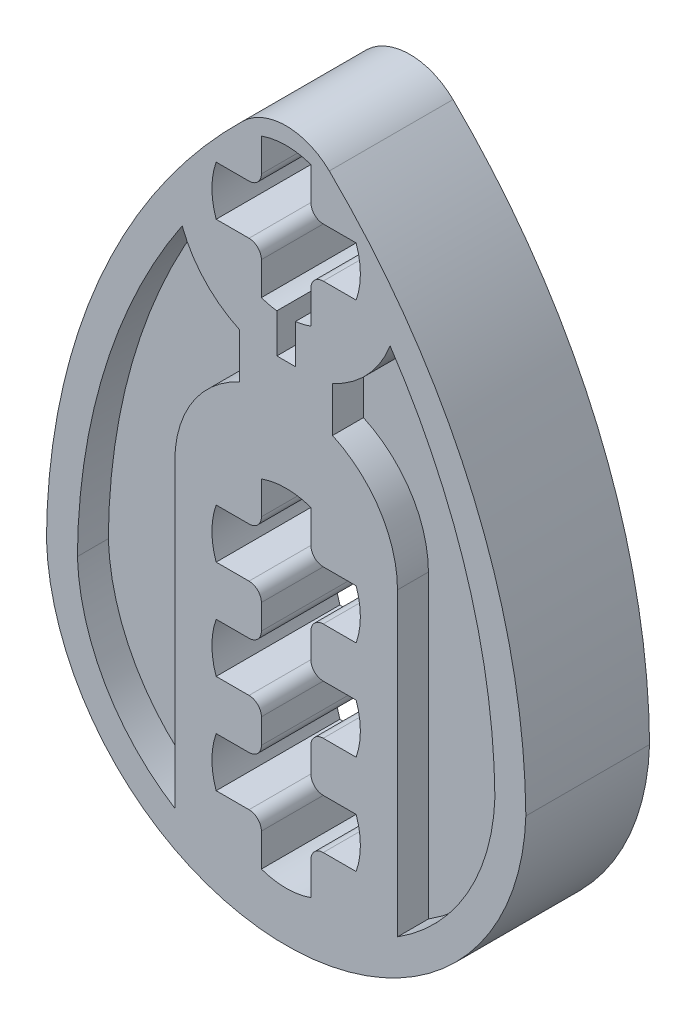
ISO-10303-21;
HEADER;
FILE_DESCRIPTION(('STEP AP214'),'2;1');
FILE_NAME('part.step','',(''),(''),'','','');
FILE_SCHEMA(('AUTOMOTIVE_DESIGN { 1 0 10303 214 1 1 1 1 }'));
ENDSEC;
DATA;
#1=APPLICATION_CONTEXT('core data for automotive mechanical design processes');
#2=APPLICATION_PROTOCOL_DEFINITION('international standard','automotive_design',2000,#1);
#3=PRODUCT_CONTEXT('',#1,'mechanical');
#4=PRODUCT('Part','Part','',(#3));
#5=PRODUCT_RELATED_PRODUCT_CATEGORY('part','',(#4));
#6=PRODUCT_DEFINITION_FORMATION('','',#4);
#7=PRODUCT_DEFINITION_CONTEXT('part definition',#1,'design');
#8=PRODUCT_DEFINITION('design','',#6,#7);
#9=PRODUCT_DEFINITION_SHAPE('','',#8);
#10=(LENGTH_UNIT() NAMED_UNIT(*) SI_UNIT(.MILLI.,.METRE.));
#11=(NAMED_UNIT(*) PLANE_ANGLE_UNIT() SI_UNIT($,.RADIAN.));
#12=(NAMED_UNIT(*) SI_UNIT($,.STERADIAN.) SOLID_ANGLE_UNIT());
#13=UNCERTAINTY_MEASURE_WITH_UNIT(LENGTH_MEASURE(1.E-05),#10,'distance_accuracy_value','');
#14=(GEOMETRIC_REPRESENTATION_CONTEXT(3) GLOBAL_UNCERTAINTY_ASSIGNED_CONTEXT((#13)) GLOBAL_UNIT_ASSIGNED_CONTEXT((#10,
#11,#12)) REPRESENTATION_CONTEXT('',''));
#15=CARTESIAN_POINT('',(0.,0.,0.));
#16=DIRECTION('',(0.,0.,1.));
#17=DIRECTION('',(1.,0.,0.));
#18=AXIS2_PLACEMENT_3D('',#15,#16,#17);
#19=CARTESIAN_POINT('',(207.138044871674,459.97172208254,0.));
#20=DIRECTION('',(0.,0.,-1.));
#21=DIRECTION('',(-1.,0.,0.));
#22=AXIS2_PLACEMENT_3D('',#19,#20,#21);
#23=CYLINDRICAL_SURFACE('',#22,21.0217832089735);
#24=CARTESIAN_POINT('',(207.138044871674,459.97172208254,-4.));
#25=DIRECTION('',(0.,0.,-1.));
#26=DIRECTION('',(-1.,0.,0.));
#27=AXIS2_PLACEMENT_3D('',#24,#25,#26);
#28=CIRCLE('',#27,21.0217832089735);
#29=CARTESIAN_POINT('',(221.804428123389,475.032019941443,-4.));
#30=VERTEX_POINT('',#29);
#31=CARTESIAN_POINT('',(228.159077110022,460.149409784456,-4.));
#32=VERTEX_POINT('',#31);
#33=EDGE_CURVE('E1051',#30,#32,#28,.T.);
#34=ORIENTED_EDGE('',*,*,#33,.F.);
#35=DIRECTION('',(0.,0.,-1.));
#36=VECTOR('',#35,1.);
#37=CARTESIAN_POINT('',(221.804428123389,475.032019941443,0.));
#38=LINE('',#37,#36);
#39=CARTESIAN_POINT('',(221.804428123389,475.032019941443,0.));
#40=VERTEX_POINT('',#39);
#41=EDGE_CURVE('E1114',#30,#40,#38,.F.);
#42=ORIENTED_EDGE('',*,*,#41,.T.);
#43=CARTESIAN_POINT('',(207.138044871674,459.97172208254,0.));
#44=DIRECTION('',(0.,0.,-1.));
#45=DIRECTION('',(-1.,0.,0.));
#46=AXIS2_PLACEMENT_3D('',#43,#44,#45);
#47=CIRCLE('',#46,21.0217832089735);
#48=CARTESIAN_POINT('',(228.159077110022,460.149409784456,0.));
#49=VERTEX_POINT('',#48);
#50=EDGE_CURVE('E1089',#40,#49,#47,.T.);
#51=ORIENTED_EDGE('',*,*,#50,.T.);
#52=DIRECTION('',(0.,0.,-1.));
#53=VECTOR('',#52,1.);
#54=CARTESIAN_POINT('',(228.159077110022,460.149409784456,0.));
#55=LINE('',#54,#53);
#56=EDGE_CURVE('E1098',#49,#32,#55,.T.);
#57=ORIENTED_EDGE('',*,*,#56,.T.);
#58=EDGE_LOOP('',(#34,#42,#51,#57));
#59=FACE_BOUND('',#58,.T.);
#60=ADVANCED_FACE('F33',(#59),#23,.T.);
#61=CARTESIAN_POINT('',(233.68010934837,459.97172208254,0.));
#62=DIRECTION('',(0.,0.,-1.));
#63=DIRECTION('',(-1.,0.,0.));
#64=AXIS2_PLACEMENT_3D('',#61,#62,#63);
#65=CYLINDRICAL_SURFACE('',#64,21.0217832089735);
#66=CARTESIAN_POINT('',(233.68010934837,459.97172208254,0.));
#67=DIRECTION('',(0.,0.,-1.));
#68=DIRECTION('',(-1.,0.,0.));
#69=AXIS2_PLACEMENT_3D('',#66,#67,#68);
#70=CIRCLE('',#69,21.0217832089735);
#71=CARTESIAN_POINT('',(212.659077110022,460.149409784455,0.));
#72=VERTEX_POINT('',#71);
#73=CARTESIAN_POINT('',(219.013726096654,475.032019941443,0.));
#74=VERTEX_POINT('',#73);
#75=EDGE_CURVE('E1095',#72,#74,#70,.T.);
#76=ORIENTED_EDGE('',*,*,#75,.T.);
#77=DIRECTION('',(0.,0.,-1.));
#78=VECTOR('',#77,1.);
#79=CARTESIAN_POINT('',(219.013726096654,475.032019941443,0.));
#80=LINE('',#79,#78);
#81=CARTESIAN_POINT('',(219.013726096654,475.032019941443,-4.));
#82=VERTEX_POINT('',#81);
#83=EDGE_CURVE('E1107',#74,#82,#80,.T.);
#84=ORIENTED_EDGE('',*,*,#83,.T.);
#85=CARTESIAN_POINT('',(233.68010934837,459.97172208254,-4.));
#86=DIRECTION('',(0.,0.,-1.));
#87=DIRECTION('',(-1.,0.,0.));
#88=AXIS2_PLACEMENT_3D('',#85,#86,#87);
#89=CIRCLE('',#88,21.0217832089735);
#90=CARTESIAN_POINT('',(212.659077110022,460.149409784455,-4.));
#91=VERTEX_POINT('',#90);
#92=EDGE_CURVE('E1092',#91,#82,#89,.T.);
#93=ORIENTED_EDGE('',*,*,#92,.F.);
#94=DIRECTION('',(0.,0.,-1.));
#95=VECTOR('',#94,1.);
#96=CARTESIAN_POINT('',(212.659077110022,460.149409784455,0.));
#97=LINE('',#96,#95);
#98=EDGE_CURVE('E1105',#72,#91,#97,.T.);
#99=ORIENTED_EDGE('',*,*,#98,.F.);
#100=EDGE_LOOP('',(#76,#84,#93,#99));
#101=FACE_BOUND('',#100,.T.);
#102=ADVANCED_FACE('F1442',(#101),#65,.T.);
#103=CARTESIAN_POINT('',(220.409077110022,460.404492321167,0.));
#104=DIRECTION('',(0.,0.,-1.));
#105=DIRECTION('',(-1.,0.,0.));
#106=AXIS2_PLACEMENT_3D('',#103,#104,#105);
#107=CYLINDRICAL_SURFACE('',#106,7.75419674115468);
#108=CARTESIAN_POINT('',(220.409077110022,460.404492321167,-4.));
#109=DIRECTION('',(0.,0.,-1.));
#110=DIRECTION('',(-1.,0.,0.));
#111=AXIS2_PLACEMENT_3D('',#108,#109,#110);
#112=CIRCLE('',#111,7.75419674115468);
#113=EDGE_CURVE('E1100',#32,#91,#112,.T.);
#114=ORIENTED_EDGE('',*,*,#113,.F.);
#115=ORIENTED_EDGE('',*,*,#56,.F.);
#116=CARTESIAN_POINT('',(220.409077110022,460.404492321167,0.));
#117=DIRECTION('',(0.,0.,-1.));
#118=DIRECTION('',(-1.,0.,0.));
#119=AXIS2_PLACEMENT_3D('',#116,#117,#118);
#120=CIRCLE('',#119,7.75419674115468);
#121=EDGE_CURVE('E1091',#49,#72,#120,.T.);
#122=ORIENTED_EDGE('',*,*,#121,.T.);
#123=ORIENTED_EDGE('',*,*,#98,.T.);
#124=EDGE_LOOP('',(#114,#115,#122,#123));
#125=FACE_BOUND('',#124,.T.);
#126=ADVANCED_FACE('F1448',(#125),#107,.T.);
#127=CARTESIAN_POINT('',(213.773560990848,460.188107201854,0.));
#128=DIRECTION('',(0.,0.,-1.));
#129=DIRECTION('',(-1.,0.,0.));
#130=AXIS2_PLACEMENT_3D('',#127,#128,#129);
#131=PLANE('',#130);
#132=DIRECTION('',(0.,-1.,0.));
#133=VECTOR('',#132,1.);
#134=CARTESIAN_POINT('',(221.909077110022,469.131878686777,0.));
#135=LINE('',#134,#133);
#136=CARTESIAN_POINT('',(221.909077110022,469.131878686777,0.));
#137=VERTEX_POINT('',#136);
#138=CARTESIAN_POINT('',(221.909077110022,467.677105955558,0.));
#139=VERTEX_POINT('',#138);
#140=EDGE_CURVE('E618',#137,#139,#135,.T.);
#141=ORIENTED_EDGE('',*,*,#140,.F.);
#142=CARTESIAN_POINT('',(220.409077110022,472.404492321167,0.));
#143=DIRECTION('',(0.,0.,-1.));
#144=DIRECTION('',(-1.,0.,0.));
#145=AXIS2_PLACEMENT_3D('',#142,#143,#144);
#146=CIRCLE('',#145,3.59999999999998);
#147=CARTESIAN_POINT('',(223.770977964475,471.117005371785,0.));
#148=VERTEX_POINT('',#147);
#149=EDGE_CURVE('E586',#148,#137,#146,.T.);
#150=ORIENTED_EDGE('',*,*,#149,.F.);
#151=CARTESIAN_POINT('',(207.138044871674,459.97172208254,0.));
#152=DIRECTION('',(0.,0.,1.));
#153=DIRECTION('',(1.,0.,0.));
#154=AXIS2_PLACEMENT_3D('',#151,#152,#153);
#155=CIRCLE('',#154,20.0217832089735);
#156=CARTESIAN_POINT('',(227.158922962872,460.162098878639,0.));
#157=VERTEX_POINT('',#156);
#158=EDGE_CURVE('E604',#157,#148,#155,.T.);
#159=ORIENTED_EDGE('',*,*,#158,.F.);
#160=CARTESIAN_POINT('',(220.409077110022,460.404492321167,0.));
#161=DIRECTION('',(0.,0.,1.));
#162=DIRECTION('',(1.,0.,0.));
#163=AXIS2_PLACEMENT_3D('',#160,#161,#162);
#164=CIRCLE('',#163,6.75419674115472);
#165=CARTESIAN_POINT('',(224.009077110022,454.689671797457,0.));
#166=VERTEX_POINT('',#165);
#167=EDGE_CURVE('E607',#166,#157,#164,.T.);
#168=ORIENTED_EDGE('',*,*,#167,.F.);
#169=DIRECTION('',(0.,-1.,0.));
#170=VECTOR('',#169,1.);
#171=CARTESIAN_POINT('',(224.009077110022,464.404492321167,0.));
#172=LINE('',#171,#170);
#173=CARTESIAN_POINT('',(224.009077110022,464.404492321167,0.));
#174=VERTEX_POINT('',#173);
#175=EDGE_CURVE('E623',#174,#166,#172,.T.);
#176=ORIENTED_EDGE('',*,*,#175,.F.);
#177=CARTESIAN_POINT('',(220.409077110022,464.404492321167,0.));
#178=DIRECTION('',(0.,0.,-1.));
#179=DIRECTION('',(-1.,0.,0.));
#180=AXIS2_PLACEMENT_3D('',#177,#178,#179);
#181=CIRCLE('',#180,3.60000000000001);
#182=EDGE_CURVE('E620',#139,#174,#181,.T.);
#183=ORIENTED_EDGE('',*,*,#182,.F.);
#184=EDGE_LOOP('',(#141,#150,#159,#168,#176,#183));
#185=FACE_BOUND('',#184,.T.);
#186=DIRECTION('',(0.,1.,0.));
#187=VECTOR('',#186,1.);
#188=CARTESIAN_POINT('',(218.909077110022,467.677105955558,0.));
#189=LINE('',#188,#187);
#190=CARTESIAN_POINT('',(218.909077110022,467.677105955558,0.));
#191=VERTEX_POINT('',#190);
#192=CARTESIAN_POINT('',(218.909077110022,469.131878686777,0.));
#193=VERTEX_POINT('',#192);
#194=EDGE_CURVE('E659',#191,#193,#189,.T.);
#195=ORIENTED_EDGE('',*,*,#194,.F.);
#196=CARTESIAN_POINT('',(220.409077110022,464.404492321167,0.));
#197=DIRECTION('',(0.,0.,-1.));
#198=DIRECTION('',(-1.,0.,0.));
#199=AXIS2_PLACEMENT_3D('',#196,#197,#198);
#200=CIRCLE('',#199,3.60000000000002);
#201=CARTESIAN_POINT('',(216.809077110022,464.404492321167,0.));
#202=VERTEX_POINT('',#201);
#203=EDGE_CURVE('E630',#202,#191,#200,.T.);
#204=ORIENTED_EDGE('',*,*,#203,.F.);
#205=DIRECTION('',(0.,1.,0.));
#206=VECTOR('',#205,1.);
#207=CARTESIAN_POINT('',(216.809077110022,454.689671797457,0.));
#208=LINE('',#207,#206);
#209=CARTESIAN_POINT('',(216.809077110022,454.689671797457,0.));
#210=VERTEX_POINT('',#209);
#211=EDGE_CURVE('E642',#210,#202,#208,.T.);
#212=ORIENTED_EDGE('',*,*,#211,.F.);
#213=CARTESIAN_POINT('',(220.409077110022,460.404492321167,0.));
#214=DIRECTION('',(0.,0.,1.));
#215=DIRECTION('',(1.,0.,0.));
#216=AXIS2_PLACEMENT_3D('',#213,#214,#215);
#217=CIRCLE('',#216,6.75419674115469);
#218=CARTESIAN_POINT('',(213.659231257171,460.162098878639,0.));
#219=VERTEX_POINT('',#218);
#220=EDGE_CURVE('E668',#219,#210,#217,.T.);
#221=ORIENTED_EDGE('',*,*,#220,.F.);
#222=CARTESIAN_POINT('',(233.68010934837,459.97172208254,0.));
#223=DIRECTION('',(0.,0.,1.));
#224=DIRECTION('',(1.,0.,0.));
#225=AXIS2_PLACEMENT_3D('',#222,#223,#224);
#226=CIRCLE('',#225,20.0217832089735);
#227=CARTESIAN_POINT('',(217.047176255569,471.117005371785,0.));
#228=VERTEX_POINT('',#227);
#229=EDGE_CURVE('E665',#228,#219,#226,.T.);
#230=ORIENTED_EDGE('',*,*,#229,.F.);
#231=CARTESIAN_POINT('',(220.409077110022,472.404492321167,0.));
#232=DIRECTION('',(0.,0.,-1.));
#233=DIRECTION('',(-1.,0.,0.));
#234=AXIS2_PLACEMENT_3D('',#231,#232,#233);
#235=CIRCLE('',#234,3.59999999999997);
#236=EDGE_CURVE('E662',#193,#228,#235,.T.);
#237=ORIENTED_EDGE('',*,*,#236,.F.);
#238=EDGE_LOOP('',(#195,#204,#212,#221,#230,#237));
#239=FACE_BOUND('',#238,.T.);
#240=DIRECTION('',(0.,1.,0.));
#241=VECTOR('',#240,1.);
#242=CARTESIAN_POINT('',(221.209077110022,473.450295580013,0.));
#243=LINE('',#242,#241);
#244=CARTESIAN_POINT('',(221.209077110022,473.850295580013,0.));
#245=VERTEX_POINT('',#244);
#246=CARTESIAN_POINT('',(221.209077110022,474.91303727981,0.));
#247=VERTEX_POINT('',#246);
#248=EDGE_CURVE('E832',#245,#247,#243,.T.);
#249=ORIENTED_EDGE('',*,*,#248,.F.);
#250=CARTESIAN_POINT('',(221.609077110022,473.850295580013,0.));
#251=DIRECTION('',(0.,0.,-1.));
#252=DIRECTION('',(-1.,0.,0.));
#253=AXIS2_PLACEMENT_3D('',#250,#251,#252);
#254=CIRCLE('',#253,0.4);
#255=CARTESIAN_POINT('',(221.609077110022,473.450295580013,0.));
#256=VERTEX_POINT('',#255);
#257=EDGE_CURVE('E1151',#245,#256,#254,.F.);
#258=ORIENTED_EDGE('',*,*,#257,.T.);
#259=DIRECTION('',(-1.,0.,0.));
#260=VECTOR('',#259,1.);
#261=CARTESIAN_POINT('',(222.671818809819,473.450295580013,0.));
#262=LINE('',#261,#260);
#263=CARTESIAN_POINT('',(222.671818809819,473.450295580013,0.));
#264=VERTEX_POINT('',#263);
#265=EDGE_CURVE('E829',#264,#256,#262,.T.);
#266=ORIENTED_EDGE('',*,*,#265,.F.);
#267=CARTESIAN_POINT('',(220.409077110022,472.650295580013,0.));
#268=DIRECTION('',(0.,0.,1.));
#269=DIRECTION('',(1.,0.,0.));
#270=AXIS2_PLACEMENT_3D('',#267,#268,#269);
#271=CIRCLE('',#270,2.39999999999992);
#272=CARTESIAN_POINT('',(222.671818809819,471.850295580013,0.));
#273=VERTEX_POINT('',#272);
#274=EDGE_CURVE('E771',#273,#264,#271,.T.);
#275=ORIENTED_EDGE('',*,*,#274,.F.);
#276=DIRECTION('',(1.,0.,0.));
#277=VECTOR('',#276,1.);
#278=CARTESIAN_POINT('',(221.209077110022,471.850295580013,0.));
#279=LINE('',#278,#277);
#280=CARTESIAN_POINT('',(221.609077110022,471.850295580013,0.));
#281=VERTEX_POINT('',#280);
#282=EDGE_CURVE('E786',#281,#273,#279,.T.);
#283=ORIENTED_EDGE('',*,*,#282,.F.);
#284=CARTESIAN_POINT('',(221.609077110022,471.450295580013,0.));
#285=DIRECTION('',(0.,0.,-1.));
#286=DIRECTION('',(-1.,0.,0.));
#287=AXIS2_PLACEMENT_3D('',#284,#285,#286);
#288=CIRCLE('',#287,0.4);
#289=CARTESIAN_POINT('',(221.209077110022,471.450295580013,0.));
#290=VERTEX_POINT('',#289);
#291=EDGE_CURVE('E1145',#281,#290,#288,.F.);
#292=ORIENTED_EDGE('',*,*,#291,.T.);
#293=DIRECTION('',(0.,1.,0.));
#294=VECTOR('',#293,1.);
#295=CARTESIAN_POINT('',(221.209077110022,470.387553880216,0.));
#296=LINE('',#295,#294);
#297=CARTESIAN_POINT('',(221.209077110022,470.387553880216,0.));
#298=VERTEX_POINT('',#297);
#299=EDGE_CURVE('E865',#298,#290,#296,.T.);
#300=ORIENTED_EDGE('',*,*,#299,.F.);
#301=CARTESIAN_POINT('',(220.409077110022,472.650295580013,0.));
#302=DIRECTION('',(0.,0.,1.));
#303=DIRECTION('',(1.,0.,0.));
#304=AXIS2_PLACEMENT_3D('',#301,#302,#303);
#305=CIRCLE('',#304,2.39999999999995);
#306=CARTESIAN_POINT('',(220.709077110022,470.269119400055,0.));
#307=VERTEX_POINT('',#306);
#308=EDGE_CURVE('E862',#307,#298,#305,.T.);
#309=ORIENTED_EDGE('',*,*,#308,.F.);
#310=DIRECTION('',(0.,1.,0.));
#311=VECTOR('',#310,1.);
#312=CARTESIAN_POINT('',(220.709077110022,469.004492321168,0.));
#313=LINE('',#312,#311);
#314=CARTESIAN_POINT('',(220.709077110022,469.004492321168,0.));
#315=VERTEX_POINT('',#314);
#316=EDGE_CURVE('E859',#315,#307,#313,.T.);
#317=ORIENTED_EDGE('',*,*,#316,.F.);
#318=DIRECTION('',(1.,0.,0.));
#319=VECTOR('',#318,1.);
#320=CARTESIAN_POINT('',(220.109077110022,469.004492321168,0.));
#321=LINE('',#320,#319);
#322=CARTESIAN_POINT('',(220.109077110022,469.004492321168,0.));
#323=VERTEX_POINT('',#322);
#324=EDGE_CURVE('E856',#323,#315,#321,.T.);
#325=ORIENTED_EDGE('',*,*,#324,.F.);
#326=DIRECTION('',(0.,-1.,0.));
#327=VECTOR('',#326,1.);
#328=CARTESIAN_POINT('',(220.109077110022,470.269119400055,0.));
#329=LINE('',#328,#327);
#330=CARTESIAN_POINT('',(220.109077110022,470.269119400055,0.));
#331=VERTEX_POINT('',#330);
#332=EDGE_CURVE('E853',#331,#323,#329,.T.);
#333=ORIENTED_EDGE('',*,*,#332,.F.);
#334=CARTESIAN_POINT('',(220.409077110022,472.650295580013,0.));
#335=DIRECTION('',(0.,0.,1.));
#336=DIRECTION('',(1.,0.,0.));
#337=AXIS2_PLACEMENT_3D('',#334,#335,#336);
#338=CIRCLE('',#337,2.39999999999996);
#339=CARTESIAN_POINT('',(219.609077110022,470.387553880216,0.));
#340=VERTEX_POINT('',#339);
#341=EDGE_CURVE('E850',#340,#331,#338,.T.);
#342=ORIENTED_EDGE('',*,*,#341,.F.);
#343=DIRECTION('',(0.,-1.,0.));
#344=VECTOR('',#343,1.);
#345=CARTESIAN_POINT('',(219.609077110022,471.850295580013,0.));
#346=LINE('',#345,#344);
#347=CARTESIAN_POINT('',(219.609077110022,471.450295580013,0.));
#348=VERTEX_POINT('',#347);
#349=EDGE_CURVE('E848',#348,#340,#346,.T.);
#350=ORIENTED_EDGE('',*,*,#349,.F.);
#351=CARTESIAN_POINT('',(219.209077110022,471.450295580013,0.));
#352=DIRECTION('',(0.,0.,-1.));
#353=DIRECTION('',(-1.,0.,0.));
#354=AXIS2_PLACEMENT_3D('',#351,#352,#353);
#355=CIRCLE('',#354,0.4);
#356=CARTESIAN_POINT('',(219.209077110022,471.850295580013,0.));
#357=VERTEX_POINT('',#356);
#358=EDGE_CURVE('E1147',#348,#357,#355,.F.);
#359=ORIENTED_EDGE('',*,*,#358,.T.);
#360=DIRECTION('',(1.,0.,0.));
#361=VECTOR('',#360,1.);
#362=CARTESIAN_POINT('',(218.146335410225,471.850295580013,0.));
#363=LINE('',#362,#361);
#364=CARTESIAN_POINT('',(218.146335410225,471.850295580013,0.));
#365=VERTEX_POINT('',#364);
#366=EDGE_CURVE('E845',#365,#357,#363,.T.);
#367=ORIENTED_EDGE('',*,*,#366,.F.);
#368=CARTESIAN_POINT('',(220.409077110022,472.650295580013,0.));
#369=DIRECTION('',(0.,0.,1.));
#370=DIRECTION('',(1.,0.,0.));
#371=AXIS2_PLACEMENT_3D('',#368,#369,#370);
#372=CIRCLE('',#371,2.39999999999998);
#373=CARTESIAN_POINT('',(218.146335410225,473.450295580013,0.));
#374=VERTEX_POINT('',#373);
#375=EDGE_CURVE('E842',#374,#365,#372,.T.);
#376=ORIENTED_EDGE('',*,*,#375,.F.);
#377=DIRECTION('',(-1.,0.,0.));
#378=VECTOR('',#377,1.);
#379=CARTESIAN_POINT('',(219.609077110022,473.450295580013,0.));
#380=LINE('',#379,#378);
#381=CARTESIAN_POINT('',(219.209077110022,473.450295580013,0.));
#382=VERTEX_POINT('',#381);
#383=EDGE_CURVE('E840',#382,#374,#380,.T.);
#384=ORIENTED_EDGE('',*,*,#383,.F.);
#385=CARTESIAN_POINT('',(219.209077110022,473.850295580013,0.));
#386=DIRECTION('',(0.,0.,-1.));
#387=DIRECTION('',(-1.,0.,0.));
#388=AXIS2_PLACEMENT_3D('',#385,#386,#387);
#389=CIRCLE('',#388,0.4);
#390=CARTESIAN_POINT('',(219.609077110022,473.850295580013,0.));
#391=VERTEX_POINT('',#390);
#392=EDGE_CURVE('E1149',#382,#391,#389,.F.);
#393=ORIENTED_EDGE('',*,*,#392,.T.);
#394=DIRECTION('',(0.,-1.,0.));
#395=VECTOR('',#394,1.);
#396=CARTESIAN_POINT('',(219.609077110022,474.91303727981,0.));
#397=LINE('',#396,#395);
#398=CARTESIAN_POINT('',(219.609077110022,474.91303727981,0.));
#399=VERTEX_POINT('',#398);
#400=EDGE_CURVE('E837',#399,#391,#397,.T.);
#401=ORIENTED_EDGE('',*,*,#400,.F.);
#402=CARTESIAN_POINT('',(220.409077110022,472.650295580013,0.));
#403=DIRECTION('',(0.,0.,1.));
#404=DIRECTION('',(1.,0.,0.));
#405=AXIS2_PLACEMENT_3D('',#402,#403,#404);
#406=CIRCLE('',#405,2.39999999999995);
#407=EDGE_CURVE('E834',#247,#399,#406,.T.);
#408=ORIENTED_EDGE('',*,*,#407,.F.);
#409=EDGE_LOOP('',(#249,#258,#266,#275,#283,#292,#300,#309,#317,#325,#333,#342,#350,#359,#367,
#376,#384,#393,#401,#408));
#410=FACE_BOUND('',#409,.T.);
#411=DIRECTION('',(0.,1.,0.));
#412=VECTOR('',#411,1.);
#413=CARTESIAN_POINT('',(219.609077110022,457.450295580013,0.));
#414=LINE('',#413,#412);
#415=CARTESIAN_POINT('',(219.609077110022,457.850295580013,0.));
#416=VERTEX_POINT('',#415);
#417=CARTESIAN_POINT('',(219.609077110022,458.650295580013,0.));
#418=VERTEX_POINT('',#417);
#419=EDGE_CURVE('E929',#416,#418,#414,.T.);
#420=ORIENTED_EDGE('',*,*,#419,.T.);
#421=CARTESIAN_POINT('',(219.209077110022,458.650295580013,0.));
#422=DIRECTION('',(0.,0.,-1.));
#423=DIRECTION('',(-1.,0.,0.));
#424=AXIS2_PLACEMENT_3D('',#421,#422,#423);
#425=CIRCLE('',#424,0.4);
#426=CARTESIAN_POINT('',(219.209077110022,459.050295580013,0.));
#427=VERTEX_POINT('',#426);
#428=EDGE_CURVE('E1143',#418,#427,#425,.F.);
#429=ORIENTED_EDGE('',*,*,#428,.T.);
#430=DIRECTION('',(-1.,0.,0.));
#431=VECTOR('',#430,1.);
#432=CARTESIAN_POINT('',(219.609077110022,459.050295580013,0.));
#433=LINE('',#432,#431);
#434=CARTESIAN_POINT('',(218.146335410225,459.050295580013,0.));
#435=VERTEX_POINT('',#434);
#436=EDGE_CURVE('E932',#427,#435,#433,.T.);
#437=ORIENTED_EDGE('',*,*,#436,.T.);
#438=CARTESIAN_POINT('',(220.409077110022,459.850295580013,0.));
#439=DIRECTION('',(0.,0.,-1.));
#440=DIRECTION('',(-1.,0.,0.));
#441=AXIS2_PLACEMENT_3D('',#438,#439,#440);
#442=CIRCLE('',#441,2.40000000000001);
#443=CARTESIAN_POINT('',(218.146335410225,460.650295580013,0.));
#444=VERTEX_POINT('',#443);
#445=EDGE_CURVE('E934',#435,#444,#442,.T.);
#446=ORIENTED_EDGE('',*,*,#445,.T.);
#447=DIRECTION('',(1.,0.,0.));
#448=VECTOR('',#447,1.);
#449=CARTESIAN_POINT('',(218.146335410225,460.650295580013,0.));
#450=LINE('',#449,#448);
#451=CARTESIAN_POINT('',(219.209077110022,460.650295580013,0.));
#452=VERTEX_POINT('',#451);
#453=EDGE_CURVE('E937',#444,#452,#450,.T.);
#454=ORIENTED_EDGE('',*,*,#453,.T.);
#455=CARTESIAN_POINT('',(219.209077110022,461.050295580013,0.));
#456=DIRECTION('',(0.,0.,-1.));
#457=DIRECTION('',(-1.,0.,0.));
#458=AXIS2_PLACEMENT_3D('',#455,#456,#457);
#459=CIRCLE('',#458,0.4);
#460=CARTESIAN_POINT('',(219.609077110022,461.050295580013,0.));
#461=VERTEX_POINT('',#460);
#462=EDGE_CURVE('E1127',#452,#461,#459,.F.);
#463=ORIENTED_EDGE('',*,*,#462,.T.);
#464=DIRECTION('',(0.,1.,0.));
#465=VECTOR('',#464,1.);
#466=CARTESIAN_POINT('',(219.609077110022,460.650295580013,0.));
#467=LINE('',#466,#465);
#468=CARTESIAN_POINT('',(219.609077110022,461.850295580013,0.));
#469=VERTEX_POINT('',#468);
#470=EDGE_CURVE('E940',#461,#469,#467,.T.);
#471=ORIENTED_EDGE('',*,*,#470,.T.);
#472=CARTESIAN_POINT('',(219.209077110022,461.850295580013,0.));
#473=DIRECTION('',(0.,0.,-1.));
#474=DIRECTION('',(-1.,0.,0.));
#475=AXIS2_PLACEMENT_3D('',#472,#473,#474);
#476=CIRCLE('',#475,0.4);
#477=CARTESIAN_POINT('',(219.209077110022,462.250295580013,0.));
#478=VERTEX_POINT('',#477);
#479=EDGE_CURVE('E1139',#469,#478,#476,.F.);
#480=ORIENTED_EDGE('',*,*,#479,.T.);
#481=DIRECTION('',(-1.,0.,0.));
#482=VECTOR('',#481,1.);
#483=CARTESIAN_POINT('',(219.609077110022,462.250295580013,0.));
#484=LINE('',#483,#482);
#485=CARTESIAN_POINT('',(218.146335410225,462.250295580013,0.));
#486=VERTEX_POINT('',#485);
#487=EDGE_CURVE('E943',#478,#486,#484,.T.);
#488=ORIENTED_EDGE('',*,*,#487,.T.);
#489=CARTESIAN_POINT('',(220.409077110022,463.050295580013,0.));
#490=DIRECTION('',(0.,0.,-1.));
#491=DIRECTION('',(-1.,0.,0.));
#492=AXIS2_PLACEMENT_3D('',#489,#490,#491);
#493=CIRCLE('',#492,2.39999999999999);
#494=CARTESIAN_POINT('',(218.146335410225,463.850295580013,0.));
#495=VERTEX_POINT('',#494);
#496=EDGE_CURVE('E945',#486,#495,#493,.T.);
#497=ORIENTED_EDGE('',*,*,#496,.T.);
#498=DIRECTION('',(1.,0.,0.));
#499=VECTOR('',#498,1.);
#500=CARTESIAN_POINT('',(218.146335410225,463.850295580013,0.));
#501=LINE('',#500,#499);
#502=CARTESIAN_POINT('',(219.209077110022,463.850295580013,0.));
#503=VERTEX_POINT('',#502);
#504=EDGE_CURVE('E948',#495,#503,#501,.T.);
#505=ORIENTED_EDGE('',*,*,#504,.T.);
#506=CARTESIAN_POINT('',(219.209077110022,464.250295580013,0.));
#507=DIRECTION('',(0.,0.,-1.));
#508=DIRECTION('',(-1.,0.,0.));
#509=AXIS2_PLACEMENT_3D('',#506,#507,#508);
#510=CIRCLE('',#509,0.4);
#511=CARTESIAN_POINT('',(219.609077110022,464.250295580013,0.));
#512=VERTEX_POINT('',#511);
#513=EDGE_CURVE('E1131',#503,#512,#510,.F.);
#514=ORIENTED_EDGE('',*,*,#513,.T.);
#515=DIRECTION('',(0.,1.,0.));
#516=VECTOR('',#515,1.);
#517=CARTESIAN_POINT('',(219.609077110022,463.850295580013,0.));
#518=LINE('',#517,#516);
#519=CARTESIAN_POINT('',(219.609077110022,465.31303727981,0.));
#520=VERTEX_POINT('',#519);
#521=EDGE_CURVE('E951',#512,#520,#518,.T.);
#522=ORIENTED_EDGE('',*,*,#521,.T.);
#523=CARTESIAN_POINT('',(220.409077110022,463.050295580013,0.));
#524=DIRECTION('',(0.,0.,-1.));
#525=DIRECTION('',(-1.,0.,0.));
#526=AXIS2_PLACEMENT_3D('',#523,#524,#525);
#527=CIRCLE('',#526,2.4);
#528=CARTESIAN_POINT('',(221.209077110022,465.31303727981,0.));
#529=VERTEX_POINT('',#528);
#530=EDGE_CURVE('E953',#520,#529,#527,.T.);
#531=ORIENTED_EDGE('',*,*,#530,.T.);
#532=DIRECTION('',(0.,-1.,0.));
#533=VECTOR('',#532,1.);
#534=CARTESIAN_POINT('',(221.209077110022,465.31303727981,0.));
#535=LINE('',#534,#533);
#536=CARTESIAN_POINT('',(221.209077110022,464.250295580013,0.));
#537=VERTEX_POINT('',#536);
#538=EDGE_CURVE('E956',#529,#537,#535,.T.);
#539=ORIENTED_EDGE('',*,*,#538,.T.);
#540=CARTESIAN_POINT('',(221.609077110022,464.250295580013,0.));
#541=DIRECTION('',(0.,0.,-1.));
#542=DIRECTION('',(-1.,0.,0.));
#543=AXIS2_PLACEMENT_3D('',#540,#541,#542);
#544=CIRCLE('',#543,0.4);
#545=CARTESIAN_POINT('',(221.609077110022,463.850295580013,0.));
#546=VERTEX_POINT('',#545);
#547=EDGE_CURVE('E1129',#537,#546,#544,.F.);
#548=ORIENTED_EDGE('',*,*,#547,.T.);
#549=DIRECTION('',(1.,0.,0.));
#550=VECTOR('',#549,1.);
#551=CARTESIAN_POINT('',(221.209077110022,463.850295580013,0.));
#552=LINE('',#551,#550);
#553=CARTESIAN_POINT('',(222.671818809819,463.850295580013,0.));
#554=VERTEX_POINT('',#553);
#555=EDGE_CURVE('E959',#546,#554,#552,.T.);
#556=ORIENTED_EDGE('',*,*,#555,.T.);
#557=CARTESIAN_POINT('',(220.409077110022,463.050295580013,0.));
#558=DIRECTION('',(0.,0.,-1.));
#559=DIRECTION('',(-1.,0.,0.));
#560=AXIS2_PLACEMENT_3D('',#557,#558,#559);
#561=CIRCLE('',#560,2.39999999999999);
#562=CARTESIAN_POINT('',(222.671818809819,462.250295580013,0.));
#563=VERTEX_POINT('',#562);
#564=EDGE_CURVE('E961',#554,#563,#561,.T.);
#565=ORIENTED_EDGE('',*,*,#564,.T.);
#566=DIRECTION('',(-1.,0.,0.));
#567=VECTOR('',#566,1.);
#568=CARTESIAN_POINT('',(222.671818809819,462.250295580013,0.));
#569=LINE('',#568,#567);
#570=CARTESIAN_POINT('',(221.609077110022,462.250295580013,0.));
#571=VERTEX_POINT('',#570);
#572=EDGE_CURVE('E964',#563,#571,#569,.T.);
#573=ORIENTED_EDGE('',*,*,#572,.T.);
#574=CARTESIAN_POINT('',(221.609077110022,461.850295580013,0.));
#575=DIRECTION('',(0.,0.,-1.));
#576=DIRECTION('',(-1.,0.,0.));
#577=AXIS2_PLACEMENT_3D('',#574,#575,#576);
#578=CIRCLE('',#577,0.4);
#579=CARTESIAN_POINT('',(221.209077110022,461.850295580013,0.));
#580=VERTEX_POINT('',#579);
#581=EDGE_CURVE('E1137',#571,#580,#578,.F.);
#582=ORIENTED_EDGE('',*,*,#581,.T.);
#583=DIRECTION('',(0.,-1.,0.));
#584=VECTOR('',#583,1.);
#585=CARTESIAN_POINT('',(221.209077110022,462.250295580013,0.));
#586=LINE('',#585,#584);
#587=CARTESIAN_POINT('',(221.209077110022,461.050295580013,0.));
#588=VERTEX_POINT('',#587);
#589=EDGE_CURVE('E967',#580,#588,#586,.T.);
#590=ORIENTED_EDGE('',*,*,#589,.T.);
#591=CARTESIAN_POINT('',(221.609077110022,461.050295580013,0.));
#592=DIRECTION('',(0.,0.,-1.));
#593=DIRECTION('',(-1.,0.,0.));
#594=AXIS2_PLACEMENT_3D('',#591,#592,#593);
#595=CIRCLE('',#594,0.4);
#596=CARTESIAN_POINT('',(221.609077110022,460.650295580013,0.));
#597=VERTEX_POINT('',#596);
#598=EDGE_CURVE('E1125',#588,#597,#595,.F.);
#599=ORIENTED_EDGE('',*,*,#598,.T.);
#600=DIRECTION('',(1.,0.,0.));
#601=VECTOR('',#600,1.);
#602=CARTESIAN_POINT('',(221.209077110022,460.650295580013,0.));
#603=LINE('',#602,#601);
#604=CARTESIAN_POINT('',(222.671818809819,460.650295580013,0.));
#605=VERTEX_POINT('',#604);
#606=EDGE_CURVE('E970',#597,#605,#603,.T.);
#607=ORIENTED_EDGE('',*,*,#606,.T.);
#608=CARTESIAN_POINT('',(220.409077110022,459.850295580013,0.));
#609=DIRECTION('',(0.,0.,-1.));
#610=DIRECTION('',(-1.,0.,0.));
#611=AXIS2_PLACEMENT_3D('',#608,#609,#610);
#612=CIRCLE('',#611,2.4);
#613=CARTESIAN_POINT('',(222.671818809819,459.050295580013,0.));
#614=VERTEX_POINT('',#613);
#615=EDGE_CURVE('E972',#605,#614,#612,.T.);
#616=ORIENTED_EDGE('',*,*,#615,.T.);
#617=DIRECTION('',(-1.,0.,0.));
#618=VECTOR('',#617,1.);
#619=CARTESIAN_POINT('',(222.671818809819,459.050295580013,0.));
#620=LINE('',#619,#618);
#621=CARTESIAN_POINT('',(221.609077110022,459.050295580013,0.));
#622=VERTEX_POINT('',#621);
#623=EDGE_CURVE('E898',#614,#622,#620,.T.);
#624=ORIENTED_EDGE('',*,*,#623,.T.);
#625=CARTESIAN_POINT('',(221.609077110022,458.650295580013,0.));
#626=DIRECTION('',(0.,0.,-1.));
#627=DIRECTION('',(-1.,0.,0.));
#628=AXIS2_PLACEMENT_3D('',#625,#626,#627);
#629=CIRCLE('',#628,0.4);
#630=CARTESIAN_POINT('',(221.209077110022,458.650295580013,0.));
#631=VERTEX_POINT('',#630);
#632=EDGE_CURVE('E1141',#622,#631,#629,.F.);
#633=ORIENTED_EDGE('',*,*,#632,.T.);
#634=DIRECTION('',(0.,-1.,0.));
#635=VECTOR('',#634,1.);
#636=CARTESIAN_POINT('',(221.209077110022,459.050295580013,0.));
#637=LINE('',#636,#635);
#638=CARTESIAN_POINT('',(221.209077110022,457.850295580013,0.));
#639=VERTEX_POINT('',#638);
#640=EDGE_CURVE('E901',#631,#639,#637,.T.);
#641=ORIENTED_EDGE('',*,*,#640,.T.);
#642=CARTESIAN_POINT('',(221.609077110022,457.850295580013,0.));
#643=DIRECTION('',(0.,0.,-1.));
#644=DIRECTION('',(-1.,0.,0.));
#645=AXIS2_PLACEMENT_3D('',#642,#643,#644);
#646=CIRCLE('',#645,0.4);
#647=CARTESIAN_POINT('',(221.609077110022,457.450295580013,0.));
#648=VERTEX_POINT('',#647);
#649=EDGE_CURVE('E1123',#639,#648,#646,.F.);
#650=ORIENTED_EDGE('',*,*,#649,.T.);
#651=DIRECTION('',(1.,0.,0.));
#652=VECTOR('',#651,1.);
#653=CARTESIAN_POINT('',(221.209077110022,457.450295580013,0.));
#654=LINE('',#653,#652);
#655=CARTESIAN_POINT('',(222.671818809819,457.450295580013,0.));
#656=VERTEX_POINT('',#655);
#657=EDGE_CURVE('E905',#648,#656,#654,.T.);
#658=ORIENTED_EDGE('',*,*,#657,.T.);
#659=CARTESIAN_POINT('',(220.409077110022,456.650295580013,0.));
#660=DIRECTION('',(0.,0.,-1.));
#661=DIRECTION('',(-1.,0.,0.));
#662=AXIS2_PLACEMENT_3D('',#659,#660,#661);
#663=CIRCLE('',#662,2.39999999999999);
#664=CARTESIAN_POINT('',(222.671818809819,455.850295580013,0.));
#665=VERTEX_POINT('',#664);
#666=EDGE_CURVE('E907',#656,#665,#663,.T.);
#667=ORIENTED_EDGE('',*,*,#666,.T.);
#668=DIRECTION('',(-1.,0.,0.));
#669=VECTOR('',#668,1.);
#670=CARTESIAN_POINT('',(222.671818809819,455.850295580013,0.));
#671=LINE('',#670,#669);
#672=CARTESIAN_POINT('',(221.609077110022,455.850295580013,0.));
#673=VERTEX_POINT('',#672);
#674=EDGE_CURVE('E910',#665,#673,#671,.T.);
#675=ORIENTED_EDGE('',*,*,#674,.T.);
#676=CARTESIAN_POINT('',(221.609077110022,455.450295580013,0.));
#677=DIRECTION('',(0.,0.,-1.));
#678=DIRECTION('',(-1.,0.,0.));
#679=AXIS2_PLACEMENT_3D('',#676,#677,#678);
#680=CIRCLE('',#679,0.4);
#681=CARTESIAN_POINT('',(221.209077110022,455.450295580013,0.));
#682=VERTEX_POINT('',#681);
#683=EDGE_CURVE('E1133',#673,#682,#680,.F.);
#684=ORIENTED_EDGE('',*,*,#683,.T.);
#685=DIRECTION('',(0.,-1.,0.));
#686=VECTOR('',#685,1.);
#687=CARTESIAN_POINT('',(221.209077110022,455.850295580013,0.));
#688=LINE('',#687,#686);
#689=CARTESIAN_POINT('',(221.209077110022,454.387553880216,0.));
#690=VERTEX_POINT('',#689);
#691=EDGE_CURVE('E913',#682,#690,#688,.T.);
#692=ORIENTED_EDGE('',*,*,#691,.T.);
#693=CARTESIAN_POINT('',(220.409077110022,456.650295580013,0.));
#694=DIRECTION('',(0.,0.,-1.));
#695=DIRECTION('',(-1.,0.,0.));
#696=AXIS2_PLACEMENT_3D('',#693,#694,#695);
#697=CIRCLE('',#696,2.4);
#698=CARTESIAN_POINT('',(219.609077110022,454.387553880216,0.));
#699=VERTEX_POINT('',#698);
#700=EDGE_CURVE('E915',#690,#699,#697,.T.);
#701=ORIENTED_EDGE('',*,*,#700,.T.);
#702=DIRECTION('',(0.,1.,0.));
#703=VECTOR('',#702,1.);
#704=CARTESIAN_POINT('',(219.609077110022,454.387553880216,0.));
#705=LINE('',#704,#703);
#706=CARTESIAN_POINT('',(219.609077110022,455.450295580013,0.));
#707=VERTEX_POINT('',#706);
#708=EDGE_CURVE('E918',#699,#707,#705,.T.);
#709=ORIENTED_EDGE('',*,*,#708,.T.);
#710=CARTESIAN_POINT('',(219.209077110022,455.450295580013,0.));
#711=DIRECTION('',(0.,0.,-1.));
#712=DIRECTION('',(-1.,0.,0.));
#713=AXIS2_PLACEMENT_3D('',#710,#711,#712);
#714=CIRCLE('',#713,0.4);
#715=CARTESIAN_POINT('',(219.209077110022,455.850295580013,0.));
#716=VERTEX_POINT('',#715);
#717=EDGE_CURVE('E1135',#707,#716,#714,.F.);
#718=ORIENTED_EDGE('',*,*,#717,.T.);
#719=DIRECTION('',(-1.,0.,0.));
#720=VECTOR('',#719,1.);
#721=CARTESIAN_POINT('',(219.609077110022,455.850295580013,0.));
#722=LINE('',#721,#720);
#723=CARTESIAN_POINT('',(218.146335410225,455.850295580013,0.));
#724=VERTEX_POINT('',#723);
#725=EDGE_CURVE('E921',#716,#724,#722,.T.);
#726=ORIENTED_EDGE('',*,*,#725,.T.);
#727=CARTESIAN_POINT('',(220.409077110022,456.650295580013,0.));
#728=DIRECTION('',(0.,0.,-1.));
#729=DIRECTION('',(-1.,0.,0.));
#730=AXIS2_PLACEMENT_3D('',#727,#728,#729);
#731=CIRCLE('',#730,2.39999999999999);
#732=CARTESIAN_POINT('',(218.146335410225,457.450295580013,0.));
#733=VERTEX_POINT('',#732);
#734=EDGE_CURVE('E923',#724,#733,#731,.T.);
#735=ORIENTED_EDGE('',*,*,#734,.T.);
#736=DIRECTION('',(1.,0.,0.));
#737=VECTOR('',#736,1.);
#738=CARTESIAN_POINT('',(218.146335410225,457.450295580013,0.));
#739=LINE('',#738,#737);
#740=CARTESIAN_POINT('',(219.209077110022,457.450295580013,0.));
#741=VERTEX_POINT('',#740);
#742=EDGE_CURVE('E926',#733,#741,#739,.T.);
#743=ORIENTED_EDGE('',*,*,#742,.T.);
#744=CARTESIAN_POINT('',(219.209077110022,457.850295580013,0.));
#745=DIRECTION('',(0.,0.,-1.));
#746=DIRECTION('',(-1.,0.,0.));
#747=AXIS2_PLACEMENT_3D('',#744,#745,#746);
#748=CIRCLE('',#747,0.4);
#749=EDGE_CURVE('E1121',#741,#416,#748,.F.);
#750=ORIENTED_EDGE('',*,*,#749,.T.);
#751=EDGE_LOOP('',(#420,#429,#437,#446,#454,#463,#471,#480,#488,#497,#505,#514,#522,#531,#539,
#548,#556,#565,#573,#582,#590,#599,#607,#616,#624,#633,#641,#650,#658,#667,#675,#684,#692,#701,
#709,#718,#726,#735,#743,#750));
#752=FACE_BOUND('',#751,.T.);
#753=ORIENTED_EDGE('',*,*,#50,.F.);
#754=CARTESIAN_POINT('',(220.409077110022,473.599192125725,0.));
#755=DIRECTION('',(0.,0.,-1.));
#756=DIRECTION('',(-1.,0.,0.));
#757=AXIS2_PLACEMENT_3D('',#754,#755,#756);
#758=CIRCLE('',#757,2.00000000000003);
#759=EDGE_CURVE('E1116',#40,#74,#758,.F.);
#760=ORIENTED_EDGE('',*,*,#759,.T.);
#761=ORIENTED_EDGE('',*,*,#75,.F.);
#762=ORIENTED_EDGE('',*,*,#121,.F.);
#763=EDGE_LOOP('',(#753,#760,#761,#762));
#764=FACE_BOUND('',#763,.T.);
#765=ADVANCED_FACE('F1271',(#185,#239,#410,#752,#764),#131,.F.);
#766=CARTESIAN_POINT('',(213.773560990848,460.188107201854,-4.));
#767=DIRECTION('',(0.,0.,-1.));
#768=DIRECTION('',(-1.,0.,0.));
#769=AXIS2_PLACEMENT_3D('',#766,#767,#768);
#770=PLANE('',#769);
#771=CARTESIAN_POINT('',(220.409077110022,464.404492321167,-4.));
#772=DIRECTION('',(0.,0.,1.));
#773=DIRECTION('',(1.,0.,0.));
#774=AXIS2_PLACEMENT_3D('',#771,#772,#773);
#775=CIRCLE('',#774,3.60000000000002);
#776=CARTESIAN_POINT('',(218.909077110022,467.677105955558,-4.));
#777=VERTEX_POINT('',#776);
#778=CARTESIAN_POINT('',(216.809077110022,464.404492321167,-4.));
#779=VERTEX_POINT('',#778);
#780=EDGE_CURVE('E675',#777,#779,#775,.T.);
#781=ORIENTED_EDGE('',*,*,#780,.F.);
#782=DIRECTION('',(0.,-1.,0.));
#783=VECTOR('',#782,1.);
#784=CARTESIAN_POINT('',(218.909077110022,469.131878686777,-4.));
#785=LINE('',#784,#783);
#786=CARTESIAN_POINT('',(218.909077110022,469.131878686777,-4.));
#787=VERTEX_POINT('',#786);
#788=EDGE_CURVE('E690',#787,#777,#785,.T.);
#789=ORIENTED_EDGE('',*,*,#788,.F.);
#790=CARTESIAN_POINT('',(220.409077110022,472.404492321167,-4.));
#791=DIRECTION('',(0.,0.,1.));
#792=DIRECTION('',(1.,0.,0.));
#793=AXIS2_PLACEMENT_3D('',#790,#791,#792);
#794=CIRCLE('',#793,3.59999999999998);
#795=CARTESIAN_POINT('',(217.047176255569,471.117005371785,-4.));
#796=VERTEX_POINT('',#795);
#797=EDGE_CURVE('E716',#796,#787,#794,.T.);
#798=ORIENTED_EDGE('',*,*,#797,.F.);
#799=CARTESIAN_POINT('',(233.68010934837,459.97172208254,-4.));
#800=DIRECTION('',(0.,0.,-1.));
#801=DIRECTION('',(-1.,0.,0.));
#802=AXIS2_PLACEMENT_3D('',#799,#800,#801);
#803=CIRCLE('',#802,20.0217832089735);
#804=CARTESIAN_POINT('',(213.659231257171,460.162098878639,-4.));
#805=VERTEX_POINT('',#804);
#806=EDGE_CURVE('E713',#805,#796,#803,.T.);
#807=ORIENTED_EDGE('',*,*,#806,.F.);
#808=CARTESIAN_POINT('',(220.409077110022,460.404492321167,-4.));
#809=DIRECTION('',(0.,0.,-1.));
#810=DIRECTION('',(-1.,0.,0.));
#811=AXIS2_PLACEMENT_3D('',#808,#809,#810);
#812=CIRCLE('',#811,6.75419674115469);
#813=CARTESIAN_POINT('',(216.809077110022,454.689671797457,-4.));
#814=VERTEX_POINT('',#813);
#815=EDGE_CURVE('E710',#814,#805,#812,.T.);
#816=ORIENTED_EDGE('',*,*,#815,.F.);
#817=DIRECTION('',(0.,-1.,0.));
#818=VECTOR('',#817,1.);
#819=CARTESIAN_POINT('',(216.809077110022,464.404492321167,-4.));
#820=LINE('',#819,#818);
#821=EDGE_CURVE('E707',#779,#814,#820,.T.);
#822=ORIENTED_EDGE('',*,*,#821,.F.);
#823=EDGE_LOOP('',(#781,#789,#798,#807,#816,#822));
#824=FACE_BOUND('',#823,.T.);
#825=CARTESIAN_POINT('',(220.409077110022,464.404492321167,-4.));
#826=DIRECTION('',(0.,0.,1.));
#827=DIRECTION('',(1.,0.,0.));
#828=AXIS2_PLACEMENT_3D('',#825,#826,#827);
#829=CIRCLE('',#828,3.60000000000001);
#830=CARTESIAN_POINT('',(224.009077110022,464.404492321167,-4.));
#831=VERTEX_POINT('',#830);
#832=CARTESIAN_POINT('',(221.909077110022,467.677105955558,-4.));
#833=VERTEX_POINT('',#832);
#834=EDGE_CURVE('E723',#831,#833,#829,.T.);
#835=ORIENTED_EDGE('',*,*,#834,.F.);
#836=DIRECTION('',(0.,1.,0.));
#837=VECTOR('',#836,1.);
#838=CARTESIAN_POINT('',(224.009077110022,454.689671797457,-4.));
#839=LINE('',#838,#837);
#840=CARTESIAN_POINT('',(224.009077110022,454.689671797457,-4.));
#841=VERTEX_POINT('',#840);
#842=EDGE_CURVE('E738',#841,#831,#839,.T.);
#843=ORIENTED_EDGE('',*,*,#842,.F.);
#844=CARTESIAN_POINT('',(220.409077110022,460.404492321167,-4.));
#845=DIRECTION('',(0.,0.,-1.));
#846=DIRECTION('',(-1.,0.,0.));
#847=AXIS2_PLACEMENT_3D('',#844,#845,#846);
#848=CIRCLE('',#847,6.75419674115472);
#849=CARTESIAN_POINT('',(227.158922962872,460.162098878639,-4.));
#850=VERTEX_POINT('',#849);
#851=EDGE_CURVE('E764',#850,#841,#848,.T.);
#852=ORIENTED_EDGE('',*,*,#851,.F.);
#853=CARTESIAN_POINT('',(207.138044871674,459.97172208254,-4.));
#854=DIRECTION('',(0.,0.,-1.));
#855=DIRECTION('',(-1.,0.,0.));
#856=AXIS2_PLACEMENT_3D('',#853,#854,#855);
#857=CIRCLE('',#856,20.0217832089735);
#858=CARTESIAN_POINT('',(223.770977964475,471.117005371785,-4.));
#859=VERTEX_POINT('',#858);
#860=EDGE_CURVE('E761',#859,#850,#857,.T.);
#861=ORIENTED_EDGE('',*,*,#860,.F.);
#862=CARTESIAN_POINT('',(220.409077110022,472.404492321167,-4.));
#863=DIRECTION('',(0.,0.,1.));
#864=DIRECTION('',(1.,0.,0.));
#865=AXIS2_PLACEMENT_3D('',#862,#863,#864);
#866=CIRCLE('',#865,3.59999999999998);
#867=CARTESIAN_POINT('',(221.909077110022,469.131878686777,-4.));
#868=VERTEX_POINT('',#867);
#869=EDGE_CURVE('E758',#868,#859,#866,.T.);
#870=ORIENTED_EDGE('',*,*,#869,.F.);
#871=DIRECTION('',(0.,1.,0.));
#872=VECTOR('',#871,1.);
#873=CARTESIAN_POINT('',(221.909077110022,467.677105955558,-4.));
#874=LINE('',#873,#872);
#875=EDGE_CURVE('E755',#833,#868,#874,.T.);
#876=ORIENTED_EDGE('',*,*,#875,.F.);
#877=EDGE_LOOP('',(#835,#843,#852,#861,#870,#876));
#878=FACE_BOUND('',#877,.T.);
#879=DIRECTION('',(-1.,0.,0.));
#880=VECTOR('',#879,1.);
#881=CARTESIAN_POINT('',(222.671818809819,473.450295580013,-4.));
#882=LINE('',#881,#880);
#883=CARTESIAN_POINT('',(222.671818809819,473.450295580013,-4.));
#884=VERTEX_POINT('',#883);
#885=CARTESIAN_POINT('',(221.609077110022,473.450295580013,-4.));
#886=VERTEX_POINT('',#885);
#887=EDGE_CURVE('E785',#884,#886,#882,.T.);
#888=ORIENTED_EDGE('',*,*,#887,.T.);
#889=CARTESIAN_POINT('',(221.609077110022,473.850295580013,-4.));
#890=DIRECTION('',(0.,0.,-1.));
#891=DIRECTION('',(-1.,0.,0.));
#892=AXIS2_PLACEMENT_3D('',#889,#890,#891);
#893=CIRCLE('',#892,0.4);
#894=CARTESIAN_POINT('',(221.209077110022,473.850295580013,-4.));
#895=VERTEX_POINT('',#894);
#896=EDGE_CURVE('E1183',#886,#895,#893,.T.);
#897=ORIENTED_EDGE('',*,*,#896,.T.);
#898=DIRECTION('',(0.,1.,0.));
#899=VECTOR('',#898,1.);
#900=CARTESIAN_POINT('',(221.209077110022,473.450295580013,-4.));
#901=LINE('',#900,#899);
#902=CARTESIAN_POINT('',(221.209077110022,474.91303727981,-4.));
#903=VERTEX_POINT('',#902);
#904=EDGE_CURVE('E789',#895,#903,#901,.T.);
#905=ORIENTED_EDGE('',*,*,#904,.T.);
#906=CARTESIAN_POINT('',(220.409077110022,472.650295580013,-4.));
#907=DIRECTION('',(0.,0.,1.));
#908=DIRECTION('',(1.,0.,0.));
#909=AXIS2_PLACEMENT_3D('',#906,#907,#908);
#910=CIRCLE('',#909,2.39999999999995);
#911=CARTESIAN_POINT('',(219.609077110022,474.91303727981,-4.));
#912=VERTEX_POINT('',#911);
#913=EDGE_CURVE('E791',#903,#912,#910,.T.);
#914=ORIENTED_EDGE('',*,*,#913,.T.);
#915=DIRECTION('',(0.,-1.,0.));
#916=VECTOR('',#915,1.);
#917=CARTESIAN_POINT('',(219.609077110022,474.91303727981,-4.));
#918=LINE('',#917,#916);
#919=CARTESIAN_POINT('',(219.609077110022,473.850295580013,-4.));
#920=VERTEX_POINT('',#919);
#921=EDGE_CURVE('E794',#912,#920,#918,.T.);
#922=ORIENTED_EDGE('',*,*,#921,.T.);
#923=CARTESIAN_POINT('',(219.209077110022,473.850295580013,-4.));
#924=DIRECTION('',(0.,0.,-1.));
#925=DIRECTION('',(-1.,0.,0.));
#926=AXIS2_PLACEMENT_3D('',#923,#924,#925);
#927=CIRCLE('',#926,0.4);
#928=CARTESIAN_POINT('',(219.209077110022,473.450295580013,-4.));
#929=VERTEX_POINT('',#928);
#930=EDGE_CURVE('E1181',#920,#929,#927,.T.);
#931=ORIENTED_EDGE('',*,*,#930,.T.);
#932=DIRECTION('',(-1.,0.,0.));
#933=VECTOR('',#932,1.);
#934=CARTESIAN_POINT('',(219.609077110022,473.450295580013,-4.));
#935=LINE('',#934,#933);
#936=CARTESIAN_POINT('',(218.146335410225,473.450295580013,-4.));
#937=VERTEX_POINT('',#936);
#938=EDGE_CURVE('E797',#929,#937,#935,.T.);
#939=ORIENTED_EDGE('',*,*,#938,.T.);
#940=CARTESIAN_POINT('',(220.409077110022,472.650295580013,-4.));
#941=DIRECTION('',(0.,0.,1.));
#942=DIRECTION('',(1.,0.,0.));
#943=AXIS2_PLACEMENT_3D('',#940,#941,#942);
#944=CIRCLE('',#943,2.39999999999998);
#945=CARTESIAN_POINT('',(218.146335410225,471.850295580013,-4.));
#946=VERTEX_POINT('',#945);
#947=EDGE_CURVE('E799',#937,#946,#944,.T.);
#948=ORIENTED_EDGE('',*,*,#947,.T.);
#949=DIRECTION('',(1.,0.,0.));
#950=VECTOR('',#949,1.);
#951=CARTESIAN_POINT('',(218.146335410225,471.850295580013,-4.));
#952=LINE('',#951,#950);
#953=CARTESIAN_POINT('',(219.209077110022,471.850295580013,-4.));
#954=VERTEX_POINT('',#953);
#955=EDGE_CURVE('E802',#946,#954,#952,.T.);
#956=ORIENTED_EDGE('',*,*,#955,.T.);
#957=CARTESIAN_POINT('',(219.209077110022,471.450295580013,-4.));
#958=DIRECTION('',(0.,0.,-1.));
#959=DIRECTION('',(-1.,0.,0.));
#960=AXIS2_PLACEMENT_3D('',#957,#958,#959);
#961=CIRCLE('',#960,0.4);
#962=CARTESIAN_POINT('',(219.609077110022,471.450295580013,-4.));
#963=VERTEX_POINT('',#962);
#964=EDGE_CURVE('E1179',#954,#963,#961,.T.);
#965=ORIENTED_EDGE('',*,*,#964,.T.);
#966=DIRECTION('',(0.,-1.,0.));
#967=VECTOR('',#966,1.);
#968=CARTESIAN_POINT('',(219.609077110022,471.850295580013,-4.));
#969=LINE('',#968,#967);
#970=CARTESIAN_POINT('',(219.609077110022,470.387553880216,-4.));
#971=VERTEX_POINT('',#970);
#972=EDGE_CURVE('E805',#963,#971,#969,.T.);
#973=ORIENTED_EDGE('',*,*,#972,.T.);
#974=CARTESIAN_POINT('',(220.409077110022,472.650295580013,-4.));
#975=DIRECTION('',(0.,0.,1.));
#976=DIRECTION('',(1.,0.,0.));
#977=AXIS2_PLACEMENT_3D('',#974,#975,#976);
#978=CIRCLE('',#977,2.39999999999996);
#979=CARTESIAN_POINT('',(220.109077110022,470.269119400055,-4.));
#980=VERTEX_POINT('',#979);
#981=EDGE_CURVE('E807',#971,#980,#978,.T.);
#982=ORIENTED_EDGE('',*,*,#981,.T.);
#983=DIRECTION('',(0.,-1.,0.));
#984=VECTOR('',#983,1.);
#985=CARTESIAN_POINT('',(220.109077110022,470.269119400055,-4.));
#986=LINE('',#985,#984);
#987=CARTESIAN_POINT('',(220.109077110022,469.004492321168,-4.));
#988=VERTEX_POINT('',#987);
#989=EDGE_CURVE('E810',#980,#988,#986,.T.);
#990=ORIENTED_EDGE('',*,*,#989,.T.);
#991=DIRECTION('',(1.,0.,0.));
#992=VECTOR('',#991,1.);
#993=CARTESIAN_POINT('',(220.109077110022,469.004492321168,-4.));
#994=LINE('',#993,#992);
#995=CARTESIAN_POINT('',(220.709077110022,469.004492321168,-4.));
#996=VERTEX_POINT('',#995);
#997=EDGE_CURVE('E813',#988,#996,#994,.T.);
#998=ORIENTED_EDGE('',*,*,#997,.T.);
#999=DIRECTION('',(0.,1.,0.));
#1000=VECTOR('',#999,1.);
#1001=CARTESIAN_POINT('',(220.709077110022,469.004492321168,-4.));
#1002=LINE('',#1001,#1000);
#1003=CARTESIAN_POINT('',(220.709077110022,470.269119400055,-4.));
#1004=VERTEX_POINT('',#1003);
#1005=EDGE_CURVE('E816',#996,#1004,#1002,.T.);
#1006=ORIENTED_EDGE('',*,*,#1005,.T.);
#1007=CARTESIAN_POINT('',(220.409077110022,472.650295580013,-4.));
#1008=DIRECTION('',(0.,0.,1.));
#1009=DIRECTION('',(1.,0.,0.));
#1010=AXIS2_PLACEMENT_3D('',#1007,#1008,#1009);
#1011=CIRCLE('',#1010,2.39999999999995);
#1012=CARTESIAN_POINT('',(221.209077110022,470.387553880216,-4.));
#1013=VERTEX_POINT('',#1012);
#1014=EDGE_CURVE('E819',#1004,#1013,#1011,.T.);
#1015=ORIENTED_EDGE('',*,*,#1014,.T.);
#1016=DIRECTION('',(0.,1.,0.));
#1017=VECTOR('',#1016,1.);
#1018=CARTESIAN_POINT('',(221.209077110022,470.387553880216,-4.));
#1019=LINE('',#1018,#1017);
#1020=CARTESIAN_POINT('',(221.209077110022,471.450295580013,-4.));
#1021=VERTEX_POINT('',#1020);
#1022=EDGE_CURVE('E822',#1013,#1021,#1019,.T.);
#1023=ORIENTED_EDGE('',*,*,#1022,.T.);
#1024=CARTESIAN_POINT('',(221.609077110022,471.450295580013,-4.));
#1025=DIRECTION('',(0.,0.,-1.));
#1026=DIRECTION('',(-1.,0.,0.));
#1027=AXIS2_PLACEMENT_3D('',#1024,#1025,#1026);
#1028=CIRCLE('',#1027,0.4);
#1029=CARTESIAN_POINT('',(221.609077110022,471.850295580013,-4.));
#1030=VERTEX_POINT('',#1029);
#1031=EDGE_CURVE('E1177',#1021,#1030,#1028,.T.);
#1032=ORIENTED_EDGE('',*,*,#1031,.T.);
#1033=DIRECTION('',(1.,0.,0.));
#1034=VECTOR('',#1033,1.);
#1035=CARTESIAN_POINT('',(221.209077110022,471.850295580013,-4.));
#1036=LINE('',#1035,#1034);
#1037=CARTESIAN_POINT('',(222.671818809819,471.850295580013,-4.));
#1038=VERTEX_POINT('',#1037);
#1039=EDGE_CURVE('E825',#1030,#1038,#1036,.T.);
#1040=ORIENTED_EDGE('',*,*,#1039,.T.);
#1041=CARTESIAN_POINT('',(220.409077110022,472.650295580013,-4.));
#1042=DIRECTION('',(0.,0.,1.));
#1043=DIRECTION('',(1.,0.,0.));
#1044=AXIS2_PLACEMENT_3D('',#1041,#1042,#1043);
#1045=CIRCLE('',#1044,2.39999999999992);
#1046=EDGE_CURVE('E782',#1038,#884,#1045,.T.);
#1047=ORIENTED_EDGE('',*,*,#1046,.T.);
#1048=EDGE_LOOP('',(#888,#897,#905,#914,#922,#931,#939,#948,#956,#965,#973,#982,#990,#998,#1006,
#1015,#1023,#1032,#1040,#1047));
#1049=FACE_BOUND('',#1048,.T.);
#1050=DIRECTION('',(-1.,0.,0.));
#1051=VECTOR('',#1050,1.);
#1052=CARTESIAN_POINT('',(219.609077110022,459.050295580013,-4.));
#1053=LINE('',#1052,#1051);
#1054=CARTESIAN_POINT('',(219.209077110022,459.050295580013,-4.));
#1055=VERTEX_POINT('',#1054);
#1056=CARTESIAN_POINT('',(218.146335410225,459.050295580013,-4.));
#1057=VERTEX_POINT('',#1056);
#1058=EDGE_CURVE('E1007',#1055,#1057,#1053,.T.);
#1059=ORIENTED_EDGE('',*,*,#1058,.F.);
#1060=CARTESIAN_POINT('',(219.209077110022,458.650295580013,-4.));
#1061=DIRECTION('',(0.,0.,-1.));
#1062=DIRECTION('',(-1.,0.,0.));
#1063=AXIS2_PLACEMENT_3D('',#1060,#1061,#1062);
#1064=CIRCLE('',#1063,0.4);
#1065=CARTESIAN_POINT('',(219.609077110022,458.650295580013,-4.));
#1066=VERTEX_POINT('',#1065);
#1067=EDGE_CURVE('E1175',#1055,#1066,#1064,.T.);
#1068=ORIENTED_EDGE('',*,*,#1067,.T.);
#1069=DIRECTION('',(0.,1.,0.));
#1070=VECTOR('',#1069,1.);
#1071=CARTESIAN_POINT('',(219.609077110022,457.450295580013,-4.));
#1072=LINE('',#1071,#1070);
#1073=CARTESIAN_POINT('',(219.609077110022,457.850295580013,-4.));
#1074=VERTEX_POINT('',#1073);
#1075=EDGE_CURVE('E1004',#1074,#1066,#1072,.T.);
#1076=ORIENTED_EDGE('',*,*,#1075,.F.);
#1077=CARTESIAN_POINT('',(219.209077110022,457.850295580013,-4.));
#1078=DIRECTION('',(0.,0.,-1.));
#1079=DIRECTION('',(-1.,0.,0.));
#1080=AXIS2_PLACEMENT_3D('',#1077,#1078,#1079);
#1081=CIRCLE('',#1080,0.4);
#1082=CARTESIAN_POINT('',(219.209077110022,457.450295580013,-4.));
#1083=VERTEX_POINT('',#1082);
#1084=EDGE_CURVE('E1155',#1074,#1083,#1081,.T.);
#1085=ORIENTED_EDGE('',*,*,#1084,.T.);
#1086=DIRECTION('',(1.,0.,0.));
#1087=VECTOR('',#1086,1.);
#1088=CARTESIAN_POINT('',(218.146335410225,457.450295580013,-4.));
#1089=LINE('',#1088,#1087);
#1090=CARTESIAN_POINT('',(218.146335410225,457.450295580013,-4.));
#1091=VERTEX_POINT('',#1090);
#1092=EDGE_CURVE('E1001',#1091,#1083,#1089,.T.);
#1093=ORIENTED_EDGE('',*,*,#1092,.F.);
#1094=CARTESIAN_POINT('',(220.409077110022,456.650295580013,-4.));
#1095=DIRECTION('',(0.,0.,-1.));
#1096=DIRECTION('',(-1.,0.,0.));
#1097=AXIS2_PLACEMENT_3D('',#1094,#1095,#1096);
#1098=CIRCLE('',#1097,2.39999999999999);
#1099=CARTESIAN_POINT('',(218.146335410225,455.850295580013,-4.));
#1100=VERTEX_POINT('',#1099);
#1101=EDGE_CURVE('E998',#1100,#1091,#1098,.T.);
#1102=ORIENTED_EDGE('',*,*,#1101,.F.);
#1103=DIRECTION('',(-1.,0.,0.));
#1104=VECTOR('',#1103,1.);
#1105=CARTESIAN_POINT('',(219.609077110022,455.850295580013,-4.));
#1106=LINE('',#1105,#1104);
#1107=CARTESIAN_POINT('',(219.209077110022,455.850295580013,-4.));
#1108=VERTEX_POINT('',#1107);
#1109=EDGE_CURVE('E996',#1108,#1100,#1106,.T.);
#1110=ORIENTED_EDGE('',*,*,#1109,.F.);
#1111=CARTESIAN_POINT('',(219.209077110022,455.450295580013,-4.));
#1112=DIRECTION('',(0.,0.,-1.));
#1113=DIRECTION('',(-1.,0.,0.));
#1114=AXIS2_PLACEMENT_3D('',#1111,#1112,#1113);
#1115=CIRCLE('',#1114,0.4);
#1116=CARTESIAN_POINT('',(219.609077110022,455.450295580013,-4.));
#1117=VERTEX_POINT('',#1116);
#1118=EDGE_CURVE('E1168',#1108,#1117,#1115,.T.);
#1119=ORIENTED_EDGE('',*,*,#1118,.T.);
#1120=DIRECTION('',(0.,1.,0.));
#1121=VECTOR('',#1120,1.);
#1122=CARTESIAN_POINT('',(219.609077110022,454.387553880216,-4.));
#1123=LINE('',#1122,#1121);
#1124=CARTESIAN_POINT('',(219.609077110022,454.387553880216,-4.));
#1125=VERTEX_POINT('',#1124);
#1126=EDGE_CURVE('E993',#1125,#1117,#1123,.T.);
#1127=ORIENTED_EDGE('',*,*,#1126,.F.);
#1128=CARTESIAN_POINT('',(220.409077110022,456.650295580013,-4.));
#1129=DIRECTION('',(0.,0.,-1.));
#1130=DIRECTION('',(-1.,0.,0.));
#1131=AXIS2_PLACEMENT_3D('',#1128,#1129,#1130);
#1132=CIRCLE('',#1131,2.4);
#1133=CARTESIAN_POINT('',(221.209077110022,454.387553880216,-4.));
#1134=VERTEX_POINT('',#1133);
#1135=EDGE_CURVE('E990',#1134,#1125,#1132,.T.);
#1136=ORIENTED_EDGE('',*,*,#1135,.F.);
#1137=DIRECTION('',(0.,-1.,0.));
#1138=VECTOR('',#1137,1.);
#1139=CARTESIAN_POINT('',(221.209077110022,455.850295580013,-4.));
#1140=LINE('',#1139,#1138);
#1141=CARTESIAN_POINT('',(221.209077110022,455.450295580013,-4.));
#1142=VERTEX_POINT('',#1141);
#1143=EDGE_CURVE('E988',#1142,#1134,#1140,.T.);
#1144=ORIENTED_EDGE('',*,*,#1143,.F.);
#1145=CARTESIAN_POINT('',(221.609077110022,455.450295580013,-4.));
#1146=DIRECTION('',(0.,0.,-1.));
#1147=DIRECTION('',(-1.,0.,0.));
#1148=AXIS2_PLACEMENT_3D('',#1145,#1146,#1147);
#1149=CIRCLE('',#1148,0.4);
#1150=CARTESIAN_POINT('',(221.609077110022,455.850295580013,-4.));
#1151=VERTEX_POINT('',#1150);
#1152=EDGE_CURVE('E1166',#1142,#1151,#1149,.T.);
#1153=ORIENTED_EDGE('',*,*,#1152,.T.);
#1154=DIRECTION('',(-1.,0.,0.));
#1155=VECTOR('',#1154,1.);
#1156=CARTESIAN_POINT('',(222.671818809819,455.850295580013,-4.));
#1157=LINE('',#1156,#1155);
#1158=CARTESIAN_POINT('',(222.671818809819,455.850295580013,-4.));
#1159=VERTEX_POINT('',#1158);
#1160=EDGE_CURVE('E985',#1159,#1151,#1157,.T.);
#1161=ORIENTED_EDGE('',*,*,#1160,.F.);
#1162=CARTESIAN_POINT('',(220.409077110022,456.650295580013,-4.));
#1163=DIRECTION('',(0.,0.,-1.));
#1164=DIRECTION('',(-1.,0.,0.));
#1165=AXIS2_PLACEMENT_3D('',#1162,#1163,#1164);
#1166=CIRCLE('',#1165,2.39999999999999);
#1167=CARTESIAN_POINT('',(222.671818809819,457.450295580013,-4.));
#1168=VERTEX_POINT('',#1167);
#1169=EDGE_CURVE('E982',#1168,#1159,#1166,.T.);
#1170=ORIENTED_EDGE('',*,*,#1169,.F.);
#1171=DIRECTION('',(1.,0.,0.));
#1172=VECTOR('',#1171,1.);
#1173=CARTESIAN_POINT('',(221.209077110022,457.450295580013,-4.));
#1174=LINE('',#1173,#1172);
#1175=CARTESIAN_POINT('',(221.609077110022,457.450295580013,-4.));
#1176=VERTEX_POINT('',#1175);
#1177=EDGE_CURVE('E980',#1176,#1168,#1174,.T.);
#1178=ORIENTED_EDGE('',*,*,#1177,.F.);
#1179=CARTESIAN_POINT('',(221.609077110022,457.850295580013,-4.));
#1180=DIRECTION('',(0.,0.,-1.));
#1181=DIRECTION('',(-1.,0.,0.));
#1182=AXIS2_PLACEMENT_3D('',#1179,#1180,#1181);
#1183=CIRCLE('',#1182,0.4);
#1184=CARTESIAN_POINT('',(221.209077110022,457.850295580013,-4.));
#1185=VERTEX_POINT('',#1184);
#1186=EDGE_CURVE('E48',#1176,#1185,#1183,.T.);
#1187=ORIENTED_EDGE('',*,*,#1186,.T.);
#1188=DIRECTION('',(0.,-1.,0.));
#1189=VECTOR('',#1188,1.);
#1190=CARTESIAN_POINT('',(221.209077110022,459.050295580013,-4.));
#1191=LINE('',#1190,#1189);
#1192=CARTESIAN_POINT('',(221.209077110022,458.650295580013,-4.));
#1193=VERTEX_POINT('',#1192);
#1194=EDGE_CURVE('E978',#1193,#1185,#1191,.T.);
#1195=ORIENTED_EDGE('',*,*,#1194,.F.);
#1196=CARTESIAN_POINT('',(221.609077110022,458.650295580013,-4.));
#1197=DIRECTION('',(0.,0.,-1.));
#1198=DIRECTION('',(-1.,0.,0.));
#1199=AXIS2_PLACEMENT_3D('',#1196,#1197,#1198);
#1200=CIRCLE('',#1199,0.4);
#1201=CARTESIAN_POINT('',(221.609077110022,459.050295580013,-4.));
#1202=VERTEX_POINT('',#1201);
#1203=EDGE_CURVE('E56',#1193,#1202,#1200,.T.);
#1204=ORIENTED_EDGE('',*,*,#1203,.T.);
#1205=DIRECTION('',(-1.,0.,0.));
#1206=VECTOR('',#1205,1.);
#1207=CARTESIAN_POINT('',(222.671818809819,459.050295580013,-4.));
#1208=LINE('',#1207,#1206);
#1209=CARTESIAN_POINT('',(222.671818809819,459.050295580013,-4.));
#1210=VERTEX_POINT('',#1209);
#1211=EDGE_CURVE('E872',#1210,#1202,#1208,.T.);
#1212=ORIENTED_EDGE('',*,*,#1211,.F.);
#1213=CARTESIAN_POINT('',(220.409077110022,459.850295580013,-4.));
#1214=DIRECTION('',(0.,0.,-1.));
#1215=DIRECTION('',(-1.,0.,0.));
#1216=AXIS2_PLACEMENT_3D('',#1213,#1214,#1215);
#1217=CIRCLE('',#1216,2.4);
#1218=CARTESIAN_POINT('',(222.671818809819,460.650295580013,-4.));
#1219=VERTEX_POINT('',#1218);
#1220=EDGE_CURVE('E902',#1219,#1210,#1217,.T.);
#1221=ORIENTED_EDGE('',*,*,#1220,.F.);
#1222=DIRECTION('',(1.,0.,0.));
#1223=VECTOR('',#1222,1.);
#1224=CARTESIAN_POINT('',(221.209077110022,460.650295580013,-4.));
#1225=LINE('',#1224,#1223);
#1226=CARTESIAN_POINT('',(221.609077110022,460.650295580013,-4.));
#1227=VERTEX_POINT('',#1226);
#1228=EDGE_CURVE('E1045',#1227,#1219,#1225,.T.);
#1229=ORIENTED_EDGE('',*,*,#1228,.F.);
#1230=CARTESIAN_POINT('',(221.609077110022,461.050295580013,-4.));
#1231=DIRECTION('',(0.,0.,-1.));
#1232=DIRECTION('',(-1.,0.,0.));
#1233=AXIS2_PLACEMENT_3D('',#1230,#1231,#1232);
#1234=CIRCLE('',#1233,0.4);
#1235=CARTESIAN_POINT('',(221.209077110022,461.050295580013,-4.));
#1236=VERTEX_POINT('',#1235);
#1237=EDGE_CURVE('E1158',#1227,#1236,#1234,.T.);
#1238=ORIENTED_EDGE('',*,*,#1237,.T.);
#1239=DIRECTION('',(0.,-1.,0.));
#1240=VECTOR('',#1239,1.);
#1241=CARTESIAN_POINT('',(221.209077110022,462.250295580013,-4.));
#1242=LINE('',#1241,#1240);
#1243=CARTESIAN_POINT('',(221.209077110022,461.850295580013,-4.));
#1244=VERTEX_POINT('',#1243);
#1245=EDGE_CURVE('E1042',#1244,#1236,#1242,.T.);
#1246=ORIENTED_EDGE('',*,*,#1245,.F.);
#1247=CARTESIAN_POINT('',(221.609077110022,461.850295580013,-4.));
#1248=DIRECTION('',(0.,0.,-1.));
#1249=DIRECTION('',(-1.,0.,0.));
#1250=AXIS2_PLACEMENT_3D('',#1247,#1248,#1249);
#1251=CIRCLE('',#1250,0.4);
#1252=CARTESIAN_POINT('',(221.609077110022,462.250295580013,-4.));
#1253=VERTEX_POINT('',#1252);
#1254=EDGE_CURVE('E1170',#1244,#1253,#1251,.T.);
#1255=ORIENTED_EDGE('',*,*,#1254,.T.);
#1256=DIRECTION('',(-1.,0.,0.));
#1257=VECTOR('',#1256,1.);
#1258=CARTESIAN_POINT('',(222.671818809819,462.250295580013,-4.));
#1259=LINE('',#1258,#1257);
#1260=CARTESIAN_POINT('',(222.671818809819,462.250295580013,-4.));
#1261=VERTEX_POINT('',#1260);
#1262=EDGE_CURVE('E1039',#1261,#1253,#1259,.T.);
#1263=ORIENTED_EDGE('',*,*,#1262,.F.);
#1264=CARTESIAN_POINT('',(220.409077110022,463.050295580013,-4.));
#1265=DIRECTION('',(0.,0.,-1.));
#1266=DIRECTION('',(-1.,0.,0.));
#1267=AXIS2_PLACEMENT_3D('',#1264,#1265,#1266);
#1268=CIRCLE('',#1267,2.39999999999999);
#1269=CARTESIAN_POINT('',(222.671818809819,463.850295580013,-4.));
#1270=VERTEX_POINT('',#1269);
#1271=EDGE_CURVE('E1036',#1270,#1261,#1268,.T.);
#1272=ORIENTED_EDGE('',*,*,#1271,.F.);
#1273=DIRECTION('',(1.,0.,0.));
#1274=VECTOR('',#1273,1.);
#1275=CARTESIAN_POINT('',(221.209077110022,463.850295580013,-4.));
#1276=LINE('',#1275,#1274);
#1277=CARTESIAN_POINT('',(221.609077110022,463.850295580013,-4.));
#1278=VERTEX_POINT('',#1277);
#1279=EDGE_CURVE('E1034',#1278,#1270,#1276,.T.);
#1280=ORIENTED_EDGE('',*,*,#1279,.F.);
#1281=CARTESIAN_POINT('',(221.609077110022,464.250295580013,-4.));
#1282=DIRECTION('',(0.,0.,-1.));
#1283=DIRECTION('',(-1.,0.,0.));
#1284=AXIS2_PLACEMENT_3D('',#1281,#1282,#1283);
#1285=CIRCLE('',#1284,0.4);
#1286=CARTESIAN_POINT('',(221.209077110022,464.250295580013,-4.));
#1287=VERTEX_POINT('',#1286);
#1288=EDGE_CURVE('E1162',#1278,#1287,#1285,.T.);
#1289=ORIENTED_EDGE('',*,*,#1288,.T.);
#1290=DIRECTION('',(0.,-1.,0.));
#1291=VECTOR('',#1290,1.);
#1292=CARTESIAN_POINT('',(221.209077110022,465.31303727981,-4.));
#1293=LINE('',#1292,#1291);
#1294=CARTESIAN_POINT('',(221.209077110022,465.31303727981,-4.));
#1295=VERTEX_POINT('',#1294);
#1296=EDGE_CURVE('E1031',#1295,#1287,#1293,.T.);
#1297=ORIENTED_EDGE('',*,*,#1296,.F.);
#1298=CARTESIAN_POINT('',(220.409077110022,463.050295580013,-4.));
#1299=DIRECTION('',(0.,0.,-1.));
#1300=DIRECTION('',(-1.,0.,0.));
#1301=AXIS2_PLACEMENT_3D('',#1298,#1299,#1300);
#1302=CIRCLE('',#1301,2.4);
#1303=CARTESIAN_POINT('',(219.609077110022,465.31303727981,-4.));
#1304=VERTEX_POINT('',#1303);
#1305=EDGE_CURVE('E1028',#1304,#1295,#1302,.T.);
#1306=ORIENTED_EDGE('',*,*,#1305,.F.);
#1307=DIRECTION('',(0.,1.,0.));
#1308=VECTOR('',#1307,1.);
#1309=CARTESIAN_POINT('',(219.609077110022,463.850295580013,-4.));
#1310=LINE('',#1309,#1308);
#1311=CARTESIAN_POINT('',(219.609077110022,464.250295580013,-4.));
#1312=VERTEX_POINT('',#1311);
#1313=EDGE_CURVE('E1026',#1312,#1304,#1310,.T.);
#1314=ORIENTED_EDGE('',*,*,#1313,.F.);
#1315=CARTESIAN_POINT('',(219.209077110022,464.250295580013,-4.));
#1316=DIRECTION('',(0.,0.,-1.));
#1317=DIRECTION('',(-1.,0.,0.));
#1318=AXIS2_PLACEMENT_3D('',#1315,#1316,#1317);
#1319=CIRCLE('',#1318,0.4);
#1320=CARTESIAN_POINT('',(219.209077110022,463.850295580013,-4.));
#1321=VERTEX_POINT('',#1320);
#1322=EDGE_CURVE('E1164',#1312,#1321,#1319,.T.);
#1323=ORIENTED_EDGE('',*,*,#1322,.T.);
#1324=DIRECTION('',(1.,0.,0.));
#1325=VECTOR('',#1324,1.);
#1326=CARTESIAN_POINT('',(218.146335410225,463.850295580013,-4.));
#1327=LINE('',#1326,#1325);
#1328=CARTESIAN_POINT('',(218.146335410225,463.850295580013,-4.));
#1329=VERTEX_POINT('',#1328);
#1330=EDGE_CURVE('E1023',#1329,#1321,#1327,.T.);
#1331=ORIENTED_EDGE('',*,*,#1330,.F.);
#1332=CARTESIAN_POINT('',(220.409077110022,463.050295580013,-4.));
#1333=DIRECTION('',(0.,0.,-1.));
#1334=DIRECTION('',(-1.,0.,0.));
#1335=AXIS2_PLACEMENT_3D('',#1332,#1333,#1334);
#1336=CIRCLE('',#1335,2.39999999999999);
#1337=CARTESIAN_POINT('',(218.146335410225,462.250295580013,-4.));
#1338=VERTEX_POINT('',#1337);
#1339=EDGE_CURVE('E1020',#1338,#1329,#1336,.T.);
#1340=ORIENTED_EDGE('',*,*,#1339,.F.);
#1341=DIRECTION('',(-1.,0.,0.));
#1342=VECTOR('',#1341,1.);
#1343=CARTESIAN_POINT('',(219.609077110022,462.250295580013,-4.));
#1344=LINE('',#1343,#1342);
#1345=CARTESIAN_POINT('',(219.209077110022,462.250295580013,-4.));
#1346=VERTEX_POINT('',#1345);
#1347=EDGE_CURVE('E1018',#1346,#1338,#1344,.T.);
#1348=ORIENTED_EDGE('',*,*,#1347,.F.);
#1349=CARTESIAN_POINT('',(219.209077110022,461.850295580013,-4.));
#1350=DIRECTION('',(0.,0.,-1.));
#1351=DIRECTION('',(-1.,0.,0.));
#1352=AXIS2_PLACEMENT_3D('',#1349,#1350,#1351);
#1353=CIRCLE('',#1352,0.4);
#1354=CARTESIAN_POINT('',(219.609077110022,461.850295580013,-4.));
#1355=VERTEX_POINT('',#1354);
#1356=EDGE_CURVE('E1172',#1346,#1355,#1353,.T.);
#1357=ORIENTED_EDGE('',*,*,#1356,.T.);
#1358=DIRECTION('',(0.,1.,0.));
#1359=VECTOR('',#1358,1.);
#1360=CARTESIAN_POINT('',(219.609077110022,460.650295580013,-4.));
#1361=LINE('',#1360,#1359);
#1362=CARTESIAN_POINT('',(219.609077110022,461.050295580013,-4.));
#1363=VERTEX_POINT('',#1362);
#1364=EDGE_CURVE('E1015',#1363,#1355,#1361,.T.);
#1365=ORIENTED_EDGE('',*,*,#1364,.F.);
#1366=CARTESIAN_POINT('',(219.209077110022,461.050295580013,-4.));
#1367=DIRECTION('',(0.,0.,-1.));
#1368=DIRECTION('',(-1.,0.,0.));
#1369=AXIS2_PLACEMENT_3D('',#1366,#1367,#1368);
#1370=CIRCLE('',#1369,0.4);
#1371=CARTESIAN_POINT('',(219.209077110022,460.650295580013,-4.));
#1372=VERTEX_POINT('',#1371);
#1373=EDGE_CURVE('E1160',#1363,#1372,#1370,.T.);
#1374=ORIENTED_EDGE('',*,*,#1373,.T.);
#1375=DIRECTION('',(1.,0.,0.));
#1376=VECTOR('',#1375,1.);
#1377=CARTESIAN_POINT('',(218.146335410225,460.650295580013,-4.));
#1378=LINE('',#1377,#1376);
#1379=CARTESIAN_POINT('',(218.146335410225,460.650295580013,-4.));
#1380=VERTEX_POINT('',#1379);
#1381=EDGE_CURVE('E1012',#1380,#1372,#1378,.T.);
#1382=ORIENTED_EDGE('',*,*,#1381,.F.);
#1383=CARTESIAN_POINT('',(220.409077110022,459.850295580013,-4.));
#1384=DIRECTION('',(0.,0.,-1.));
#1385=DIRECTION('',(-1.,0.,0.));
#1386=AXIS2_PLACEMENT_3D('',#1383,#1384,#1385);
#1387=CIRCLE('',#1386,2.40000000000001);
#1388=EDGE_CURVE('E1009',#1057,#1380,#1387,.T.);
#1389=ORIENTED_EDGE('',*,*,#1388,.F.);
#1390=EDGE_LOOP('',(#1059,#1068,#1076,#1085,#1093,#1102,#1110,#1119,#1127,#1136,#1144,#1153,
#1161,#1170,#1178,#1187,#1195,#1204,#1212,#1221,#1229,#1238,#1246,#1255,#1263,#1272,#1280,#1289,
#1297,#1306,#1314,#1323,#1331,#1340,#1348,#1357,#1365,#1374,#1382,#1389));
#1391=FACE_BOUND('',#1390,.T.);
#1392=ORIENTED_EDGE('',*,*,#92,.T.);
#1393=CARTESIAN_POINT('',(220.409077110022,473.599192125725,-4.));
#1394=DIRECTION('',(0.,0.,-1.));
#1395=DIRECTION('',(-1.,0.,0.));
#1396=AXIS2_PLACEMENT_3D('',#1393,#1394,#1395);
#1397=CIRCLE('',#1396,2.00000000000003);
#1398=EDGE_CURVE('E1112',#82,#30,#1397,.T.);
#1399=ORIENTED_EDGE('',*,*,#1398,.T.);
#1400=ORIENTED_EDGE('',*,*,#33,.T.);
#1401=ORIENTED_EDGE('',*,*,#113,.T.);
#1402=EDGE_LOOP('',(#1392,#1399,#1400,#1401));
#1403=FACE_BOUND('',#1402,.T.);
#1404=ADVANCED_FACE('F1263',(#824,#878,#1049,#1391,#1403),#770,.T.);
#1405=CARTESIAN_POINT('',(222.671818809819,459.050295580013,0.));
#1406=DIRECTION('',(0.,-1.,0.));
#1407=DIRECTION('',(0.,0.,-1.));
#1408=AXIS2_PLACEMENT_3D('',#1405,#1406,#1407);
#1409=PLANE('',#1408);
#1410=ORIENTED_EDGE('',*,*,#1211,.T.);
#1411=DIRECTION('',(0.,0.,-1.));
#1412=VECTOR('',#1411,1.);
#1413=CARTESIAN_POINT('',(221.609077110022,459.050295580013,0.));
#1414=LINE('',#1413,#1412);
#1415=EDGE_CURVE('E1212',#1202,#622,#1414,.F.);
#1416=ORIENTED_EDGE('',*,*,#1415,.T.);
#1417=ORIENTED_EDGE('',*,*,#623,.F.);
#1418=DIRECTION('',(0.,0.,-1.));
#1419=VECTOR('',#1418,1.);
#1420=CARTESIAN_POINT('',(222.671818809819,459.050295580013,0.));
#1421=LINE('',#1420,#1419);
#1422=EDGE_CURVE('E1049',#614,#1210,#1421,.T.);
#1423=ORIENTED_EDGE('',*,*,#1422,.T.);
#1424=EDGE_LOOP('',(#1410,#1416,#1417,#1423));
#1425=FACE_BOUND('',#1424,.T.);
#1426=ADVANCED_FACE('F1282',(#1425),#1409,.F.);
#1427=CARTESIAN_POINT('',(220.409077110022,459.850295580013,0.));
#1428=DIRECTION('',(0.,0.,-1.));
#1429=DIRECTION('',(-1.,0.,0.));
#1430=AXIS2_PLACEMENT_3D('',#1427,#1428,#1429);
#1431=CYLINDRICAL_SURFACE('',#1430,2.4);
#1432=ORIENTED_EDGE('',*,*,#1220,.T.);
#1433=ORIENTED_EDGE('',*,*,#1422,.F.);
#1434=ORIENTED_EDGE('',*,*,#615,.F.);
#1435=DIRECTION('',(0.,0.,-1.));
#1436=VECTOR('',#1435,1.);
#1437=CARTESIAN_POINT('',(222.671818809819,460.650295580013,0.));
#1438=LINE('',#1437,#1436);
#1439=EDGE_CURVE('E1052',#605,#1219,#1438,.T.);
#1440=ORIENTED_EDGE('',*,*,#1439,.T.);
#1441=EDGE_LOOP('',(#1432,#1433,#1434,#1440));
#1442=FACE_BOUND('',#1441,.T.);
#1443=ADVANCED_FACE('F1290',(#1442),#1431,.F.);
#1444=CARTESIAN_POINT('',(221.209077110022,460.650295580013,0.));
#1445=DIRECTION('',(0.,1.,0.));
#1446=DIRECTION('',(0.,0.,1.));
#1447=AXIS2_PLACEMENT_3D('',#1444,#1445,#1446);
#1448=PLANE('',#1447);
#1449=ORIENTED_EDGE('',*,*,#606,.F.);
#1450=DIRECTION('',(0.,0.,-1.));
#1451=VECTOR('',#1450,1.);
#1452=CARTESIAN_POINT('',(221.609077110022,460.650295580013,0.));
#1453=LINE('',#1452,#1451);
#1454=EDGE_CURVE('E1251',#597,#1227,#1453,.T.);
#1455=ORIENTED_EDGE('',*,*,#1454,.T.);
#1456=ORIENTED_EDGE('',*,*,#1228,.T.);
#1457=ORIENTED_EDGE('',*,*,#1439,.F.);
#1458=EDGE_LOOP('',(#1449,#1455,#1456,#1457));
#1459=FACE_BOUND('',#1458,.T.);
#1460=ADVANCED_FACE('F1294',(#1459),#1448,.F.);
#1461=CARTESIAN_POINT('',(221.209077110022,462.250295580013,0.));
#1462=DIRECTION('',(1.,0.,0.));
#1463=DIRECTION('',(0.,0.,-1.));
#1464=AXIS2_PLACEMENT_3D('',#1461,#1462,#1463);
#1465=PLANE('',#1464);
#1466=ORIENTED_EDGE('',*,*,#589,.F.);
#1467=DIRECTION('',(0.,0.,-1.));
#1468=VECTOR('',#1467,1.);
#1469=CARTESIAN_POINT('',(221.209077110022,461.850295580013,0.));
#1470=LINE('',#1469,#1468);
#1471=EDGE_CURVE('E1224',#580,#1244,#1470,.T.);
#1472=ORIENTED_EDGE('',*,*,#1471,.T.);
#1473=ORIENTED_EDGE('',*,*,#1245,.T.);
#1474=DIRECTION('',(0.,0.,-1.));
#1475=VECTOR('',#1474,1.);
#1476=CARTESIAN_POINT('',(221.209077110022,461.050295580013,0.));
#1477=LINE('',#1476,#1475);
#1478=EDGE_CURVE('E1222',#1236,#588,#1477,.F.);
#1479=ORIENTED_EDGE('',*,*,#1478,.T.);
#1480=EDGE_LOOP('',(#1466,#1472,#1473,#1479));
#1481=FACE_BOUND('',#1480,.T.);
#1482=ADVANCED_FACE('F1302',(#1481),#1465,.F.);
#1483=CARTESIAN_POINT('',(222.671818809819,462.250295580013,0.));
#1484=DIRECTION('',(0.,-1.,0.));
#1485=DIRECTION('',(0.,0.,-1.));
#1486=AXIS2_PLACEMENT_3D('',#1483,#1484,#1485);
#1487=PLANE('',#1486);
#1488=ORIENTED_EDGE('',*,*,#1262,.T.);
#1489=DIRECTION('',(0.,0.,-1.));
#1490=VECTOR('',#1489,1.);
#1491=CARTESIAN_POINT('',(221.609077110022,462.250295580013,0.));
#1492=LINE('',#1491,#1490);
#1493=EDGE_CURVE('E1227',#1253,#571,#1492,.F.);
#1494=ORIENTED_EDGE('',*,*,#1493,.T.);
#1495=ORIENTED_EDGE('',*,*,#572,.F.);
#1496=DIRECTION('',(0.,0.,-1.));
#1497=VECTOR('',#1496,1.);
#1498=CARTESIAN_POINT('',(222.671818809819,462.250295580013,0.));
#1499=LINE('',#1498,#1497);
#1500=EDGE_CURVE('E1055',#563,#1261,#1499,.T.);
#1501=ORIENTED_EDGE('',*,*,#1500,.T.);
#1502=EDGE_LOOP('',(#1488,#1494,#1495,#1501));
#1503=FACE_BOUND('',#1502,.T.);
#1504=ADVANCED_FACE('F1312',(#1503),#1487,.F.);
#1505=CARTESIAN_POINT('',(220.409077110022,463.050295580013,0.));
#1506=DIRECTION('',(0.,0.,-1.));
#1507=DIRECTION('',(-1.,0.,0.));
#1508=AXIS2_PLACEMENT_3D('',#1505,#1506,#1507);
#1509=CYLINDRICAL_SURFACE('',#1508,2.39999999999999);
#1510=ORIENTED_EDGE('',*,*,#1271,.T.);
#1511=ORIENTED_EDGE('',*,*,#1500,.F.);
#1512=ORIENTED_EDGE('',*,*,#564,.F.);
#1513=DIRECTION('',(0.,0.,-1.));
#1514=VECTOR('',#1513,1.);
#1515=CARTESIAN_POINT('',(222.671818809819,463.850295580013,0.));
#1516=LINE('',#1515,#1514);
#1517=EDGE_CURVE('E1057',#554,#1270,#1516,.T.);
#1518=ORIENTED_EDGE('',*,*,#1517,.T.);
#1519=EDGE_LOOP('',(#1510,#1511,#1512,#1518));
#1520=FACE_BOUND('',#1519,.T.);
#1521=ADVANCED_FACE('F1315',(#1520),#1509,.F.);
#1522=CARTESIAN_POINT('',(221.209077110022,463.850295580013,0.));
#1523=DIRECTION('',(0.,1.,0.));
#1524=DIRECTION('',(-1.,0.,0.));
#1525=AXIS2_PLACEMENT_3D('',#1522,#1523,#1524);
#1526=PLANE('',#1525);
#1527=ORIENTED_EDGE('',*,*,#555,.F.);
#1528=DIRECTION('',(0.,0.,-1.));
#1529=VECTOR('',#1528,1.);
#1530=CARTESIAN_POINT('',(221.609077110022,463.850295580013,0.));
#1531=LINE('',#1530,#1529);
#1532=EDGE_CURVE('E1244',#546,#1278,#1531,.T.);
#1533=ORIENTED_EDGE('',*,*,#1532,.T.);
#1534=ORIENTED_EDGE('',*,*,#1279,.T.);
#1535=ORIENTED_EDGE('',*,*,#1517,.F.);
#1536=EDGE_LOOP('',(#1527,#1533,#1534,#1535));
#1537=FACE_BOUND('',#1536,.T.);
#1538=ADVANCED_FACE('F1321',(#1537),#1526,.F.);
#1539=CARTESIAN_POINT('',(221.209077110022,465.31303727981,0.));
#1540=DIRECTION('',(1.,0.,0.));
#1541=DIRECTION('',(0.,0.,-1.));
#1542=AXIS2_PLACEMENT_3D('',#1539,#1540,#1541);
#1543=PLANE('',#1542);
#1544=ORIENTED_EDGE('',*,*,#1296,.T.);
#1545=DIRECTION('',(0.,0.,-1.));
#1546=VECTOR('',#1545,1.);
#1547=CARTESIAN_POINT('',(221.209077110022,464.250295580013,0.));
#1548=LINE('',#1547,#1546);
#1549=EDGE_CURVE('E1247',#1287,#537,#1548,.F.);
#1550=ORIENTED_EDGE('',*,*,#1549,.T.);
#1551=ORIENTED_EDGE('',*,*,#538,.F.);
#1552=DIRECTION('',(0.,0.,-1.));
#1553=VECTOR('',#1552,1.);
#1554=CARTESIAN_POINT('',(221.209077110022,465.31303727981,0.));
#1555=LINE('',#1554,#1553);
#1556=EDGE_CURVE('E1060',#529,#1295,#1555,.T.);
#1557=ORIENTED_EDGE('',*,*,#1556,.T.);
#1558=EDGE_LOOP('',(#1544,#1550,#1551,#1557));
#1559=FACE_BOUND('',#1558,.T.);
#1560=ADVANCED_FACE('F1329',(#1559),#1543,.F.);
#1561=CARTESIAN_POINT('',(220.409077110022,463.050295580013,0.));
#1562=DIRECTION('',(0.,0.,-1.));
#1563=DIRECTION('',(-1.,0.,0.));
#1564=AXIS2_PLACEMENT_3D('',#1561,#1562,#1563);
#1565=CYLINDRICAL_SURFACE('',#1564,2.4);
#1566=ORIENTED_EDGE('',*,*,#1305,.T.);
#1567=ORIENTED_EDGE('',*,*,#1556,.F.);
#1568=ORIENTED_EDGE('',*,*,#530,.F.);
#1569=DIRECTION('',(0.,0.,-1.));
#1570=VECTOR('',#1569,1.);
#1571=CARTESIAN_POINT('',(219.609077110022,465.31303727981,0.));
#1572=LINE('',#1571,#1570);
#1573=EDGE_CURVE('E1062',#520,#1304,#1572,.T.);
#1574=ORIENTED_EDGE('',*,*,#1573,.T.);
#1575=EDGE_LOOP('',(#1566,#1567,#1568,#1574));
#1576=FACE_BOUND('',#1575,.T.);
#1577=ADVANCED_FACE('F1334',(#1576),#1565,.F.);
#1578=CARTESIAN_POINT('',(219.609077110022,463.850295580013,0.));
#1579=DIRECTION('',(-1.,0.,0.));
#1580=DIRECTION('',(0.,0.,1.));
#1581=AXIS2_PLACEMENT_3D('',#1578,#1579,#1580);
#1582=PLANE('',#1581);
#1583=ORIENTED_EDGE('',*,*,#521,.F.);
#1584=DIRECTION('',(0.,0.,-1.));
#1585=VECTOR('',#1584,1.);
#1586=CARTESIAN_POINT('',(219.609077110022,464.250295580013,0.));
#1587=LINE('',#1586,#1585);
#1588=EDGE_CURVE('E1239',#512,#1312,#1587,.T.);
#1589=ORIENTED_EDGE('',*,*,#1588,.T.);
#1590=ORIENTED_EDGE('',*,*,#1313,.T.);
#1591=ORIENTED_EDGE('',*,*,#1573,.F.);
#1592=EDGE_LOOP('',(#1583,#1589,#1590,#1591));
#1593=FACE_BOUND('',#1592,.T.);
#1594=ADVANCED_FACE('F1339',(#1593),#1582,.F.);
#1595=CARTESIAN_POINT('',(218.146335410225,463.850295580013,0.));
#1596=DIRECTION('',(0.,1.,0.));
#1597=DIRECTION('',(-1.,0.,0.));
#1598=AXIS2_PLACEMENT_3D('',#1595,#1596,#1597);
#1599=PLANE('',#1598);
#1600=ORIENTED_EDGE('',*,*,#1330,.T.);
#1601=DIRECTION('',(0.,0.,-1.));
#1602=VECTOR('',#1601,1.);
#1603=CARTESIAN_POINT('',(219.209077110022,463.850295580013,0.));
#1604=LINE('',#1603,#1602);
#1605=EDGE_CURVE('E1242',#1321,#503,#1604,.F.);
#1606=ORIENTED_EDGE('',*,*,#1605,.T.);
#1607=ORIENTED_EDGE('',*,*,#504,.F.);
#1608=DIRECTION('',(0.,0.,-1.));
#1609=VECTOR('',#1608,1.);
#1610=CARTESIAN_POINT('',(218.146335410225,463.850295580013,0.));
#1611=LINE('',#1610,#1609);
#1612=EDGE_CURVE('E1065',#495,#1329,#1611,.T.);
#1613=ORIENTED_EDGE('',*,*,#1612,.T.);
#1614=EDGE_LOOP('',(#1600,#1606,#1607,#1613));
#1615=FACE_BOUND('',#1614,.T.);
#1616=ADVANCED_FACE('F1347',(#1615),#1599,.F.);
#1617=CARTESIAN_POINT('',(220.409077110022,463.050295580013,0.));
#1618=DIRECTION('',(0.,0.,-1.));
#1619=DIRECTION('',(-1.,0.,0.));
#1620=AXIS2_PLACEMENT_3D('',#1617,#1618,#1619);
#1621=CYLINDRICAL_SURFACE('',#1620,2.39999999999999);
#1622=ORIENTED_EDGE('',*,*,#1339,.T.);
#1623=ORIENTED_EDGE('',*,*,#1612,.F.);
#1624=ORIENTED_EDGE('',*,*,#496,.F.);
#1625=DIRECTION('',(0.,0.,-1.));
#1626=VECTOR('',#1625,1.);
#1627=CARTESIAN_POINT('',(218.146335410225,462.250295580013,0.));
#1628=LINE('',#1627,#1626);
#1629=EDGE_CURVE('E1067',#486,#1338,#1628,.T.);
#1630=ORIENTED_EDGE('',*,*,#1629,.T.);
#1631=EDGE_LOOP('',(#1622,#1623,#1624,#1630));
#1632=FACE_BOUND('',#1631,.T.);
#1633=ADVANCED_FACE('F1352',(#1632),#1621,.F.);
#1634=CARTESIAN_POINT('',(219.609077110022,462.250295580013,0.));
#1635=DIRECTION('',(0.,-1.,0.));
#1636=DIRECTION('',(0.,0.,-1.));
#1637=AXIS2_PLACEMENT_3D('',#1634,#1635,#1636);
#1638=PLANE('',#1637);
#1639=ORIENTED_EDGE('',*,*,#487,.F.);
#1640=DIRECTION('',(0.,0.,-1.));
#1641=VECTOR('',#1640,1.);
#1642=CARTESIAN_POINT('',(219.209077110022,462.250295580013,0.));
#1643=LINE('',#1642,#1641);
#1644=EDGE_CURVE('E1214',#478,#1346,#1643,.T.);
#1645=ORIENTED_EDGE('',*,*,#1644,.T.);
#1646=ORIENTED_EDGE('',*,*,#1347,.T.);
#1647=ORIENTED_EDGE('',*,*,#1629,.F.);
#1648=EDGE_LOOP('',(#1639,#1645,#1646,#1647));
#1649=FACE_BOUND('',#1648,.T.);
#1650=ADVANCED_FACE('F1357',(#1649),#1638,.F.);
#1651=CARTESIAN_POINT('',(219.609077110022,460.650295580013,0.));
#1652=DIRECTION('',(-1.,0.,0.));
#1653=DIRECTION('',(0.,0.,1.));
#1654=AXIS2_PLACEMENT_3D('',#1651,#1652,#1653);
#1655=PLANE('',#1654);
#1656=ORIENTED_EDGE('',*,*,#1364,.T.);
#1657=DIRECTION('',(0.,0.,-1.));
#1658=VECTOR('',#1657,1.);
#1659=CARTESIAN_POINT('',(219.609077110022,461.850295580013,0.));
#1660=LINE('',#1659,#1658);
#1661=EDGE_CURVE('E1220',#1355,#469,#1660,.F.);
#1662=ORIENTED_EDGE('',*,*,#1661,.T.);
#1663=ORIENTED_EDGE('',*,*,#470,.F.);
#1664=DIRECTION('',(0.,0.,-1.));
#1665=VECTOR('',#1664,1.);
#1666=CARTESIAN_POINT('',(219.609077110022,461.050295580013,0.));
#1667=LINE('',#1666,#1665);
#1668=EDGE_CURVE('E1217',#461,#1363,#1667,.T.);
#1669=ORIENTED_EDGE('',*,*,#1668,.T.);
#1670=EDGE_LOOP('',(#1656,#1662,#1663,#1669));
#1671=FACE_BOUND('',#1670,.T.);
#1672=ADVANCED_FACE('F1365',(#1671),#1655,.F.);
#1673=CARTESIAN_POINT('',(218.146335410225,460.650295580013,0.));
#1674=DIRECTION('',(0.,1.,0.));
#1675=DIRECTION('',(0.,0.,1.));
#1676=AXIS2_PLACEMENT_3D('',#1673,#1674,#1675);
#1677=PLANE('',#1676);
#1678=ORIENTED_EDGE('',*,*,#1381,.T.);
#1679=DIRECTION('',(0.,0.,-1.));
#1680=VECTOR('',#1679,1.);
#1681=CARTESIAN_POINT('',(219.209077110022,460.650295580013,0.));
#1682=LINE('',#1681,#1680);
#1683=EDGE_CURVE('E1249',#1372,#452,#1682,.F.);
#1684=ORIENTED_EDGE('',*,*,#1683,.T.);
#1685=ORIENTED_EDGE('',*,*,#453,.F.);
#1686=DIRECTION('',(0.,0.,-1.));
#1687=VECTOR('',#1686,1.);
#1688=CARTESIAN_POINT('',(218.146335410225,460.650295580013,0.));
#1689=LINE('',#1688,#1687);
#1690=EDGE_CURVE('E1070',#444,#1380,#1689,.T.);
#1691=ORIENTED_EDGE('',*,*,#1690,.T.);
#1692=EDGE_LOOP('',(#1678,#1684,#1685,#1691));
#1693=FACE_BOUND('',#1692,.T.);
#1694=ADVANCED_FACE('F1375',(#1693),#1677,.F.);
#1695=CARTESIAN_POINT('',(220.409077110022,459.850295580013,0.));
#1696=DIRECTION('',(0.,0.,-1.));
#1697=DIRECTION('',(-1.,0.,0.));
#1698=AXIS2_PLACEMENT_3D('',#1695,#1696,#1697);
#1699=CYLINDRICAL_SURFACE('',#1698,2.40000000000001);
#1700=ORIENTED_EDGE('',*,*,#1388,.T.);
#1701=ORIENTED_EDGE('',*,*,#1690,.F.);
#1702=ORIENTED_EDGE('',*,*,#445,.F.);
#1703=DIRECTION('',(0.,0.,-1.));
#1704=VECTOR('',#1703,1.);
#1705=CARTESIAN_POINT('',(218.146335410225,459.050295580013,0.));
#1706=LINE('',#1705,#1704);
#1707=EDGE_CURVE('E1072',#435,#1057,#1706,.T.);
#1708=ORIENTED_EDGE('',*,*,#1707,.T.);
#1709=EDGE_LOOP('',(#1700,#1701,#1702,#1708));
#1710=FACE_BOUND('',#1709,.T.);
#1711=ADVANCED_FACE('F1378',(#1710),#1699,.F.);
#1712=CARTESIAN_POINT('',(219.609077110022,459.050295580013,0.));
#1713=DIRECTION('',(0.,-1.,0.));
#1714=DIRECTION('',(0.,0.,-1.));
#1715=AXIS2_PLACEMENT_3D('',#1712,#1713,#1714);
#1716=PLANE('',#1715);
#1717=ORIENTED_EDGE('',*,*,#436,.F.);
#1718=DIRECTION('',(0.,0.,-1.));
#1719=VECTOR('',#1718,1.);
#1720=CARTESIAN_POINT('',(219.209077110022,459.050295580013,0.));
#1721=LINE('',#1720,#1719);
#1722=EDGE_CURVE('E1200',#427,#1055,#1721,.T.);
#1723=ORIENTED_EDGE('',*,*,#1722,.T.);
#1724=ORIENTED_EDGE('',*,*,#1058,.T.);
#1725=ORIENTED_EDGE('',*,*,#1707,.F.);
#1726=EDGE_LOOP('',(#1717,#1723,#1724,#1725));
#1727=FACE_BOUND('',#1726,.T.);
#1728=ADVANCED_FACE('F1383',(#1727),#1716,.F.);
#1729=CARTESIAN_POINT('',(219.609077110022,457.450295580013,0.));
#1730=DIRECTION('',(-1.,0.,0.));
#1731=DIRECTION('',(0.,0.,1.));
#1732=AXIS2_PLACEMENT_3D('',#1729,#1730,#1731);
#1733=PLANE('',#1732);
#1734=ORIENTED_EDGE('',*,*,#1075,.T.);
#1735=DIRECTION('',(0.,0.,-1.));
#1736=VECTOR('',#1735,1.);
#1737=CARTESIAN_POINT('',(219.609077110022,458.650295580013,0.));
#1738=LINE('',#1737,#1736);
#1739=EDGE_CURVE('E1206',#1066,#418,#1738,.F.);
#1740=ORIENTED_EDGE('',*,*,#1739,.T.);
#1741=ORIENTED_EDGE('',*,*,#419,.F.);
#1742=DIRECTION('',(0.,0.,-1.));
#1743=VECTOR('',#1742,1.);
#1744=CARTESIAN_POINT('',(219.609077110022,457.850295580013,0.));
#1745=LINE('',#1744,#1743);
#1746=EDGE_CURVE('E1203',#416,#1074,#1745,.T.);
#1747=ORIENTED_EDGE('',*,*,#1746,.T.);
#1748=EDGE_LOOP('',(#1734,#1740,#1741,#1747));
#1749=FACE_BOUND('',#1748,.T.);
#1750=ADVANCED_FACE('F1391',(#1749),#1733,.F.);
#1751=CARTESIAN_POINT('',(218.146335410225,457.450295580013,0.));
#1752=DIRECTION('',(0.,1.,0.));
#1753=DIRECTION('',(0.,0.,1.));
#1754=AXIS2_PLACEMENT_3D('',#1751,#1752,#1753);
#1755=PLANE('',#1754);
#1756=ORIENTED_EDGE('',*,*,#1092,.T.);
#1757=DIRECTION('',(0.,0.,-1.));
#1758=VECTOR('',#1757,1.);
#1759=CARTESIAN_POINT('',(219.209077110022,457.450295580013,0.));
#1760=LINE('',#1759,#1758);
#1761=EDGE_CURVE('E11',#1083,#741,#1760,.F.);
#1762=ORIENTED_EDGE('',*,*,#1761,.T.);
#1763=ORIENTED_EDGE('',*,*,#742,.F.);
#1764=DIRECTION('',(0.,0.,-1.));
#1765=VECTOR('',#1764,1.);
#1766=CARTESIAN_POINT('',(218.146335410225,457.450295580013,0.));
#1767=LINE('',#1766,#1765);
#1768=EDGE_CURVE('E1075',#733,#1091,#1767,.T.);
#1769=ORIENTED_EDGE('',*,*,#1768,.T.);
#1770=EDGE_LOOP('',(#1756,#1762,#1763,#1769));
#1771=FACE_BOUND('',#1770,.T.);
#1772=ADVANCED_FACE('F1400',(#1771),#1755,.F.);
#1773=CARTESIAN_POINT('',(220.409077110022,456.650295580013,0.));
#1774=DIRECTION('',(0.,0.,-1.));
#1775=DIRECTION('',(-1.,0.,0.));
#1776=AXIS2_PLACEMENT_3D('',#1773,#1774,#1775);
#1777=CYLINDRICAL_SURFACE('',#1776,2.39999999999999);
#1778=ORIENTED_EDGE('',*,*,#1101,.T.);
#1779=ORIENTED_EDGE('',*,*,#1768,.F.);
#1780=ORIENTED_EDGE('',*,*,#734,.F.);
#1781=DIRECTION('',(0.,0.,-1.));
#1782=VECTOR('',#1781,1.);
#1783=CARTESIAN_POINT('',(218.146335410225,455.850295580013,0.));
#1784=LINE('',#1783,#1782);
#1785=EDGE_CURVE('E1077',#724,#1100,#1784,.T.);
#1786=ORIENTED_EDGE('',*,*,#1785,.T.);
#1787=EDGE_LOOP('',(#1778,#1779,#1780,#1786));
#1788=FACE_BOUND('',#1787,.T.);
#1789=ADVANCED_FACE('F1403',(#1788),#1777,.F.);
#1790=CARTESIAN_POINT('',(219.609077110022,455.850295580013,0.));
#1791=DIRECTION('',(0.,-1.,0.));
#1792=DIRECTION('',(1.,0.,0.));
#1793=AXIS2_PLACEMENT_3D('',#1790,#1791,#1792);
#1794=PLANE('',#1793);
#1795=ORIENTED_EDGE('',*,*,#725,.F.);
#1796=DIRECTION('',(0.,0.,-1.));
#1797=VECTOR('',#1796,1.);
#1798=CARTESIAN_POINT('',(219.209077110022,455.850295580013,0.));
#1799=LINE('',#1798,#1797);
#1800=EDGE_CURVE('E1229',#716,#1108,#1799,.T.);
#1801=ORIENTED_EDGE('',*,*,#1800,.T.);
#1802=ORIENTED_EDGE('',*,*,#1109,.T.);
#1803=ORIENTED_EDGE('',*,*,#1785,.F.);
#1804=EDGE_LOOP('',(#1795,#1801,#1802,#1803));
#1805=FACE_BOUND('',#1804,.T.);
#1806=ADVANCED_FACE('F1409',(#1805),#1794,.F.);
#1807=CARTESIAN_POINT('',(219.609077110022,454.387553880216,0.));
#1808=DIRECTION('',(-1.,0.,0.));
#1809=DIRECTION('',(0.,0.,1.));
#1810=AXIS2_PLACEMENT_3D('',#1807,#1808,#1809);
#1811=PLANE('',#1810);
#1812=ORIENTED_EDGE('',*,*,#1126,.T.);
#1813=DIRECTION('',(0.,0.,-1.));
#1814=VECTOR('',#1813,1.);
#1815=CARTESIAN_POINT('',(219.609077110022,455.450295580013,0.));
#1816=LINE('',#1815,#1814);
#1817=EDGE_CURVE('E1232',#1117,#707,#1816,.F.);
#1818=ORIENTED_EDGE('',*,*,#1817,.T.);
#1819=ORIENTED_EDGE('',*,*,#708,.F.);
#1820=DIRECTION('',(0.,0.,-1.));
#1821=VECTOR('',#1820,1.);
#1822=CARTESIAN_POINT('',(219.609077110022,454.387553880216,0.));
#1823=LINE('',#1822,#1821);
#1824=EDGE_CURVE('E1080',#699,#1125,#1823,.T.);
#1825=ORIENTED_EDGE('',*,*,#1824,.T.);
#1826=EDGE_LOOP('',(#1812,#1818,#1819,#1825));
#1827=FACE_BOUND('',#1826,.T.);
#1828=ADVANCED_FACE('F1417',(#1827),#1811,.F.);
#1829=CARTESIAN_POINT('',(220.409077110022,456.650295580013,0.));
#1830=DIRECTION('',(0.,0.,-1.));
#1831=DIRECTION('',(-1.,0.,0.));
#1832=AXIS2_PLACEMENT_3D('',#1829,#1830,#1831);
#1833=CYLINDRICAL_SURFACE('',#1832,2.4);
#1834=ORIENTED_EDGE('',*,*,#1135,.T.);
#1835=ORIENTED_EDGE('',*,*,#1824,.F.);
#1836=ORIENTED_EDGE('',*,*,#700,.F.);
#1837=DIRECTION('',(0.,0.,-1.));
#1838=VECTOR('',#1837,1.);
#1839=CARTESIAN_POINT('',(221.209077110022,454.387553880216,0.));
#1840=LINE('',#1839,#1838);
#1841=EDGE_CURVE('E1082',#690,#1134,#1840,.T.);
#1842=ORIENTED_EDGE('',*,*,#1841,.T.);
#1843=EDGE_LOOP('',(#1834,#1835,#1836,#1842));
#1844=FACE_BOUND('',#1843,.T.);
#1845=ADVANCED_FACE('F1422',(#1844),#1833,.F.);
#1846=CARTESIAN_POINT('',(221.209077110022,455.850295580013,0.));
#1847=DIRECTION('',(1.,0.,0.));
#1848=DIRECTION('',(0.,0.,-1.));
#1849=AXIS2_PLACEMENT_3D('',#1846,#1847,#1848);
#1850=PLANE('',#1849);
#1851=ORIENTED_EDGE('',*,*,#691,.F.);
#1852=DIRECTION('',(0.,0.,-1.));
#1853=VECTOR('',#1852,1.);
#1854=CARTESIAN_POINT('',(221.209077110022,455.450295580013,0.));
#1855=LINE('',#1854,#1853);
#1856=EDGE_CURVE('E1234',#682,#1142,#1855,.T.);
#1857=ORIENTED_EDGE('',*,*,#1856,.T.);
#1858=ORIENTED_EDGE('',*,*,#1143,.T.);
#1859=ORIENTED_EDGE('',*,*,#1841,.F.);
#1860=EDGE_LOOP('',(#1851,#1857,#1858,#1859));
#1861=FACE_BOUND('',#1860,.T.);
#1862=ADVANCED_FACE('F1426',(#1861),#1850,.F.);
#1863=CARTESIAN_POINT('',(222.671818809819,455.850295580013,0.));
#1864=DIRECTION('',(0.,-1.,0.));
#1865=DIRECTION('',(1.,0.,0.));
#1866=AXIS2_PLACEMENT_3D('',#1863,#1864,#1865);
#1867=PLANE('',#1866);
#1868=ORIENTED_EDGE('',*,*,#1160,.T.);
#1869=DIRECTION('',(0.,0.,-1.));
#1870=VECTOR('',#1869,1.);
#1871=CARTESIAN_POINT('',(221.609077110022,455.850295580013,0.));
#1872=LINE('',#1871,#1870);
#1873=EDGE_CURVE('E1237',#1151,#673,#1872,.F.);
#1874=ORIENTED_EDGE('',*,*,#1873,.T.);
#1875=ORIENTED_EDGE('',*,*,#674,.F.);
#1876=DIRECTION('',(0.,0.,-1.));
#1877=VECTOR('',#1876,1.);
#1878=CARTESIAN_POINT('',(222.671818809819,455.850295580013,0.));
#1879=LINE('',#1878,#1877);
#1880=EDGE_CURVE('E1085',#665,#1159,#1879,.T.);
#1881=ORIENTED_EDGE('',*,*,#1880,.T.);
#1882=EDGE_LOOP('',(#1868,#1874,#1875,#1881));
#1883=FACE_BOUND('',#1882,.T.);
#1884=ADVANCED_FACE('F1432',(#1883),#1867,.F.);
#1885=CARTESIAN_POINT('',(220.409077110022,456.650295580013,0.));
#1886=DIRECTION('',(0.,0.,-1.));
#1887=DIRECTION('',(-1.,0.,0.));
#1888=AXIS2_PLACEMENT_3D('',#1885,#1886,#1887);
#1889=CYLINDRICAL_SURFACE('',#1888,2.39999999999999);
#1890=ORIENTED_EDGE('',*,*,#1169,.T.);
#1891=ORIENTED_EDGE('',*,*,#1880,.F.);
#1892=ORIENTED_EDGE('',*,*,#666,.F.);
#1893=DIRECTION('',(0.,0.,-1.));
#1894=VECTOR('',#1893,1.);
#1895=CARTESIAN_POINT('',(222.671818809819,457.450295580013,0.));
#1896=LINE('',#1895,#1894);
#1897=EDGE_CURVE('E975',#656,#1168,#1896,.T.);
#1898=ORIENTED_EDGE('',*,*,#1897,.T.);
#1899=EDGE_LOOP('',(#1890,#1891,#1892,#1898));
#1900=FACE_BOUND('',#1899,.T.);
#1901=ADVANCED_FACE('F1267',(#1900),#1889,.F.);
#1902=CARTESIAN_POINT('',(221.209077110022,457.450295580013,0.));
#1903=DIRECTION('',(0.,1.,0.));
#1904=DIRECTION('',(0.,0.,1.));
#1905=AXIS2_PLACEMENT_3D('',#1902,#1903,#1904);
#1906=PLANE('',#1905);
#1907=ORIENTED_EDGE('',*,*,#657,.F.);
#1908=DIRECTION('',(0.,0.,-1.));
#1909=VECTOR('',#1908,1.);
#1910=CARTESIAN_POINT('',(221.609077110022,457.450295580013,0.));
#1911=LINE('',#1910,#1909);
#1912=EDGE_CURVE('E41',#648,#1176,#1911,.T.);
#1913=ORIENTED_EDGE('',*,*,#1912,.T.);
#1914=ORIENTED_EDGE('',*,*,#1177,.T.);
#1915=ORIENTED_EDGE('',*,*,#1897,.F.);
#1916=EDGE_LOOP('',(#1907,#1913,#1914,#1915));
#1917=FACE_BOUND('',#1916,.T.);
#1918=ADVANCED_FACE('F1257',(#1917),#1906,.F.);
#1919=CARTESIAN_POINT('',(221.209077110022,459.050295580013,0.));
#1920=DIRECTION('',(1.,0.,0.));
#1921=DIRECTION('',(0.,0.,-1.));
#1922=AXIS2_PLACEMENT_3D('',#1919,#1920,#1921);
#1923=PLANE('',#1922);
#1924=ORIENTED_EDGE('',*,*,#640,.F.);
#1925=DIRECTION('',(0.,0.,-1.));
#1926=VECTOR('',#1925,1.);
#1927=CARTESIAN_POINT('',(221.209077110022,458.650295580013,0.));
#1928=LINE('',#1927,#1926);
#1929=EDGE_CURVE('E1210',#631,#1193,#1928,.T.);
#1930=ORIENTED_EDGE('',*,*,#1929,.T.);
#1931=ORIENTED_EDGE('',*,*,#1194,.T.);
#1932=DIRECTION('',(0.,0.,-1.));
#1933=VECTOR('',#1932,1.);
#1934=CARTESIAN_POINT('',(221.209077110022,457.850295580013,0.));
#1935=LINE('',#1934,#1933);
#1936=EDGE_CURVE('E1208',#1185,#639,#1935,.F.);
#1937=ORIENTED_EDGE('',*,*,#1936,.T.);
#1938=EDGE_LOOP('',(#1924,#1930,#1931,#1937));
#1939=FACE_BOUND('',#1938,.T.);
#1940=ADVANCED_FACE('F1278',(#1939),#1923,.F.);
#1941=CARTESIAN_POINT('',(220.409077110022,472.650295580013,-4.));
#1942=DIRECTION('',(0.,0.,1.));
#1943=DIRECTION('',(1.,0.,0.));
#1944=AXIS2_PLACEMENT_3D('',#1941,#1942,#1943);
#1945=CYLINDRICAL_SURFACE('',#1944,2.39999999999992);
#1946=ORIENTED_EDGE('',*,*,#274,.T.);
#1947=DIRECTION('',(0.,0.,1.));
#1948=VECTOR('',#1947,1.);
#1949=CARTESIAN_POINT('',(222.671818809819,473.450295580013,-4.));
#1950=LINE('',#1949,#1948);
#1951=EDGE_CURVE('E827',#884,#264,#1950,.T.);
#1952=ORIENTED_EDGE('',*,*,#1951,.F.);
#1953=ORIENTED_EDGE('',*,*,#1046,.F.);
#1954=DIRECTION('',(0.,0.,1.));
#1955=VECTOR('',#1954,1.);
#1956=CARTESIAN_POINT('',(222.671818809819,471.850295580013,-4.));
#1957=LINE('',#1956,#1955);
#1958=EDGE_CURVE('E869',#1038,#273,#1957,.T.);
#1959=ORIENTED_EDGE('',*,*,#1958,.T.);
#1960=EDGE_LOOP('',(#1946,#1952,#1953,#1959));
#1961=FACE_BOUND('',#1960,.T.);
#1962=ADVANCED_FACE('F1683',(#1961),#1945,.F.);
#1963=CARTESIAN_POINT('',(221.209077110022,471.850295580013,-4.));
#1964=DIRECTION('',(0.,-1.,0.));
#1965=DIRECTION('',(0.,0.,-1.));
#1966=AXIS2_PLACEMENT_3D('',#1963,#1964,#1965);
#1967=PLANE('',#1966);
#1968=ORIENTED_EDGE('',*,*,#1039,.F.);
#1969=DIRECTION('',(0.,0.,1.));
#1970=VECTOR('',#1969,1.);
#1971=CARTESIAN_POINT('',(221.609077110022,471.850295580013,-4.));
#1972=LINE('',#1971,#1970);
#1973=EDGE_CURVE('E1195',#1030,#281,#1972,.T.);
#1974=ORIENTED_EDGE('',*,*,#1973,.T.);
#1975=ORIENTED_EDGE('',*,*,#282,.T.);
#1976=ORIENTED_EDGE('',*,*,#1958,.F.);
#1977=EDGE_LOOP('',(#1968,#1974,#1975,#1976));
#1978=FACE_BOUND('',#1977,.T.);
#1979=ADVANCED_FACE('F1671',(#1978),#1967,.F.);
#1980=CARTESIAN_POINT('',(221.209077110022,470.387553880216,-4.));
#1981=DIRECTION('',(1.,0.,0.));
#1982=DIRECTION('',(0.,0.,-1.));
#1983=AXIS2_PLACEMENT_3D('',#1980,#1981,#1982);
#1984=PLANE('',#1983);
#1985=ORIENTED_EDGE('',*,*,#299,.T.);
#1986=DIRECTION('',(0.,0.,1.));
#1987=VECTOR('',#1986,1.);
#1988=CARTESIAN_POINT('',(221.209077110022,471.450295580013,-4.));
#1989=LINE('',#1988,#1987);
#1990=EDGE_CURVE('E1198',#290,#1021,#1989,.F.);
#1991=ORIENTED_EDGE('',*,*,#1990,.T.);
#1992=ORIENTED_EDGE('',*,*,#1022,.F.);
#1993=DIRECTION('',(0.,0.,1.));
#1994=VECTOR('',#1993,1.);
#1995=CARTESIAN_POINT('',(221.209077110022,470.387553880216,-4.));
#1996=LINE('',#1995,#1994);
#1997=EDGE_CURVE('E873',#1013,#298,#1996,.T.);
#1998=ORIENTED_EDGE('',*,*,#1997,.T.);
#1999=EDGE_LOOP('',(#1985,#1991,#1992,#1998));
#2000=FACE_BOUND('',#1999,.T.);
#2001=ADVANCED_FACE('F1665',(#2000),#1984,.F.);
#2002=CARTESIAN_POINT('',(220.409077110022,472.650295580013,-4.));
#2003=DIRECTION('',(0.,0.,1.));
#2004=DIRECTION('',(1.,0.,0.));
#2005=AXIS2_PLACEMENT_3D('',#2002,#2003,#2004);
#2006=CYLINDRICAL_SURFACE('',#2005,2.39999999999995);
#2007=ORIENTED_EDGE('',*,*,#308,.T.);
#2008=ORIENTED_EDGE('',*,*,#1997,.F.);
#2009=ORIENTED_EDGE('',*,*,#1014,.F.);
#2010=DIRECTION('',(0.,0.,1.));
#2011=VECTOR('',#2010,1.);
#2012=CARTESIAN_POINT('',(220.709077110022,470.269119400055,-4.));
#2013=LINE('',#2012,#2011);
#2014=EDGE_CURVE('E875',#1004,#307,#2013,.T.);
#2015=ORIENTED_EDGE('',*,*,#2014,.T.);
#2016=EDGE_LOOP('',(#2007,#2008,#2009,#2015));
#2017=FACE_BOUND('',#2016,.T.);
#2018=ADVANCED_FACE('F1670',(#2017),#2006,.F.);
#2019=CARTESIAN_POINT('',(220.709077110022,469.004492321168,-4.));
#2020=DIRECTION('',(1.,0.,0.));
#2021=DIRECTION('',(0.,0.,-1.));
#2022=AXIS2_PLACEMENT_3D('',#2019,#2020,#2021);
#2023=PLANE('',#2022);
#2024=ORIENTED_EDGE('',*,*,#316,.T.);
#2025=ORIENTED_EDGE('',*,*,#2014,.F.);
#2026=ORIENTED_EDGE('',*,*,#1005,.F.);
#2027=DIRECTION('',(0.,0.,1.));
#2028=VECTOR('',#2027,1.);
#2029=CARTESIAN_POINT('',(220.709077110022,469.004492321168,-4.));
#2030=LINE('',#2029,#2028);
#2031=EDGE_CURVE('E877',#996,#315,#2030,.T.);
#2032=ORIENTED_EDGE('',*,*,#2031,.T.);
#2033=EDGE_LOOP('',(#2024,#2025,#2026,#2032));
#2034=FACE_BOUND('',#2033,.T.);
#2035=ADVANCED_FACE('F2202',(#2034),#2023,.F.);
#2036=CARTESIAN_POINT('',(220.109077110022,469.004492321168,-4.));
#2037=DIRECTION('',(0.,-1.,0.));
#2038=DIRECTION('',(0.,0.,-1.));
#2039=AXIS2_PLACEMENT_3D('',#2036,#2037,#2038);
#2040=PLANE('',#2039);
#2041=ORIENTED_EDGE('',*,*,#324,.T.);
#2042=ORIENTED_EDGE('',*,*,#2031,.F.);
#2043=ORIENTED_EDGE('',*,*,#997,.F.);
#2044=DIRECTION('',(0.,0.,1.));
#2045=VECTOR('',#2044,1.);
#2046=CARTESIAN_POINT('',(220.109077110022,469.004492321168,-4.));
#2047=LINE('',#2046,#2045);
#2048=EDGE_CURVE('E879',#988,#323,#2047,.T.);
#2049=ORIENTED_EDGE('',*,*,#2048,.T.);
#2050=EDGE_LOOP('',(#2041,#2042,#2043,#2049));
#2051=FACE_BOUND('',#2050,.T.);
#2052=ADVANCED_FACE('F2192',(#2051),#2040,.F.);
#2053=CARTESIAN_POINT('',(220.109077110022,470.269119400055,-4.));
#2054=DIRECTION('',(-1.,0.,0.));
#2055=DIRECTION('',(0.,0.,1.));
#2056=AXIS2_PLACEMENT_3D('',#2053,#2054,#2055);
#2057=PLANE('',#2056);
#2058=ORIENTED_EDGE('',*,*,#332,.T.);
#2059=ORIENTED_EDGE('',*,*,#2048,.F.);
#2060=ORIENTED_EDGE('',*,*,#989,.F.);
#2061=DIRECTION('',(0.,0.,1.));
#2062=VECTOR('',#2061,1.);
#2063=CARTESIAN_POINT('',(220.109077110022,470.269119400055,-4.));
#2064=LINE('',#2063,#2062);
#2065=EDGE_CURVE('E881',#980,#331,#2064,.T.);
#2066=ORIENTED_EDGE('',*,*,#2065,.T.);
#2067=EDGE_LOOP('',(#2058,#2059,#2060,#2066));
#2068=FACE_BOUND('',#2067,.T.);
#2069=ADVANCED_FACE('F2182',(#2068),#2057,.F.);
#2070=CARTESIAN_POINT('',(220.409077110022,472.650295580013,-4.));
#2071=DIRECTION('',(0.,0.,1.));
#2072=DIRECTION('',(1.,0.,0.));
#2073=AXIS2_PLACEMENT_3D('',#2070,#2071,#2072);
#2074=CYLINDRICAL_SURFACE('',#2073,2.39999999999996);
#2075=ORIENTED_EDGE('',*,*,#341,.T.);
#2076=ORIENTED_EDGE('',*,*,#2065,.F.);
#2077=ORIENTED_EDGE('',*,*,#981,.F.);
#2078=DIRECTION('',(0.,0.,1.));
#2079=VECTOR('',#2078,1.);
#2080=CARTESIAN_POINT('',(219.609077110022,470.387553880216,-4.));
#2081=LINE('',#2080,#2079);
#2082=EDGE_CURVE('E883',#971,#340,#2081,.T.);
#2083=ORIENTED_EDGE('',*,*,#2082,.T.);
#2084=EDGE_LOOP('',(#2075,#2076,#2077,#2083));
#2085=FACE_BOUND('',#2084,.T.);
#2086=ADVANCED_FACE('F1657',(#2085),#2074,.F.);
#2087=CARTESIAN_POINT('',(219.609077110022,471.850295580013,-4.));
#2088=DIRECTION('',(-1.,0.,0.));
#2089=DIRECTION('',(0.,0.,1.));
#2090=AXIS2_PLACEMENT_3D('',#2087,#2088,#2089);
#2091=PLANE('',#2090);
#2092=ORIENTED_EDGE('',*,*,#972,.F.);
#2093=DIRECTION('',(0.,0.,1.));
#2094=VECTOR('',#2093,1.);
#2095=CARTESIAN_POINT('',(219.609077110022,471.450295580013,-4.));
#2096=LINE('',#2095,#2094);
#2097=EDGE_CURVE('E1190',#963,#348,#2096,.T.);
#2098=ORIENTED_EDGE('',*,*,#2097,.T.);
#2099=ORIENTED_EDGE('',*,*,#349,.T.);
#2100=ORIENTED_EDGE('',*,*,#2082,.F.);
#2101=EDGE_LOOP('',(#2092,#2098,#2099,#2100));
#2102=FACE_BOUND('',#2101,.T.);
#2103=ADVANCED_FACE('F1647',(#2102),#2091,.F.);
#2104=CARTESIAN_POINT('',(218.146335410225,471.850295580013,-4.));
#2105=DIRECTION('',(0.,-1.,0.));
#2106=DIRECTION('',(0.,0.,-1.));
#2107=AXIS2_PLACEMENT_3D('',#2104,#2105,#2106);
#2108=PLANE('',#2107);
#2109=ORIENTED_EDGE('',*,*,#366,.T.);
#2110=DIRECTION('',(0.,0.,1.));
#2111=VECTOR('',#2110,1.);
#2112=CARTESIAN_POINT('',(219.209077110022,471.850295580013,-4.));
#2113=LINE('',#2112,#2111);
#2114=EDGE_CURVE('E1193',#357,#954,#2113,.F.);
#2115=ORIENTED_EDGE('',*,*,#2114,.T.);
#2116=ORIENTED_EDGE('',*,*,#955,.F.);
#2117=DIRECTION('',(0.,0.,1.));
#2118=VECTOR('',#2117,1.);
#2119=CARTESIAN_POINT('',(218.146335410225,471.850295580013,-4.));
#2120=LINE('',#2119,#2118);
#2121=EDGE_CURVE('E886',#946,#365,#2120,.T.);
#2122=ORIENTED_EDGE('',*,*,#2121,.T.);
#2123=EDGE_LOOP('',(#2109,#2115,#2116,#2122));
#2124=FACE_BOUND('',#2123,.T.);
#2125=ADVANCED_FACE('F1642',(#2124),#2108,.F.);
#2126=CARTESIAN_POINT('',(220.409077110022,472.650295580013,-4.));
#2127=DIRECTION('',(0.,0.,1.));
#2128=DIRECTION('',(1.,0.,0.));
#2129=AXIS2_PLACEMENT_3D('',#2126,#2127,#2128);
#2130=CYLINDRICAL_SURFACE('',#2129,2.39999999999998);
#2131=ORIENTED_EDGE('',*,*,#375,.T.);
#2132=ORIENTED_EDGE('',*,*,#2121,.F.);
#2133=ORIENTED_EDGE('',*,*,#947,.F.);
#2134=DIRECTION('',(0.,0.,1.));
#2135=VECTOR('',#2134,1.);
#2136=CARTESIAN_POINT('',(218.146335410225,473.450295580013,-4.));
#2137=LINE('',#2136,#2135);
#2138=EDGE_CURVE('E888',#937,#374,#2137,.T.);
#2139=ORIENTED_EDGE('',*,*,#2138,.T.);
#2140=EDGE_LOOP('',(#2131,#2132,#2133,#2139));
#2141=FACE_BOUND('',#2140,.T.);
#2142=ADVANCED_FACE('F1634',(#2141),#2130,.F.);
#2143=CARTESIAN_POINT('',(219.609077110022,473.450295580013,-4.));
#2144=DIRECTION('',(0.,1.,0.));
#2145=DIRECTION('',(0.,0.,1.));
#2146=AXIS2_PLACEMENT_3D('',#2143,#2144,#2145);
#2147=PLANE('',#2146);
#2148=ORIENTED_EDGE('',*,*,#938,.F.);
#2149=DIRECTION('',(0.,0.,1.));
#2150=VECTOR('',#2149,1.);
#2151=CARTESIAN_POINT('',(219.209077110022,473.450295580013,-4.));
#2152=LINE('',#2151,#2150);
#2153=EDGE_CURVE('E1185',#929,#382,#2152,.T.);
#2154=ORIENTED_EDGE('',*,*,#2153,.T.);
#2155=ORIENTED_EDGE('',*,*,#383,.T.);
#2156=ORIENTED_EDGE('',*,*,#2138,.F.);
#2157=EDGE_LOOP('',(#2148,#2154,#2155,#2156));
#2158=FACE_BOUND('',#2157,.T.);
#2159=ADVANCED_FACE('F1624',(#2158),#2147,.F.);
#2160=CARTESIAN_POINT('',(219.609077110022,474.91303727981,-4.));
#2161=DIRECTION('',(-1.,0.,0.));
#2162=DIRECTION('',(0.,0.,1.));
#2163=AXIS2_PLACEMENT_3D('',#2160,#2161,#2162);
#2164=PLANE('',#2163);
#2165=ORIENTED_EDGE('',*,*,#400,.T.);
#2166=DIRECTION('',(0.,0.,1.));
#2167=VECTOR('',#2166,1.);
#2168=CARTESIAN_POINT('',(219.609077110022,473.850295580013,-4.));
#2169=LINE('',#2168,#2167);
#2170=EDGE_CURVE('E1188',#391,#920,#2169,.F.);
#2171=ORIENTED_EDGE('',*,*,#2170,.T.);
#2172=ORIENTED_EDGE('',*,*,#921,.F.);
#2173=DIRECTION('',(0.,0.,1.));
#2174=VECTOR('',#2173,1.);
#2175=CARTESIAN_POINT('',(219.609077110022,474.91303727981,-4.));
#2176=LINE('',#2175,#2174);
#2177=EDGE_CURVE('E891',#912,#399,#2176,.T.);
#2178=ORIENTED_EDGE('',*,*,#2177,.T.);
#2179=EDGE_LOOP('',(#2165,#2171,#2172,#2178));
#2180=FACE_BOUND('',#2179,.T.);
#2181=ADVANCED_FACE('F1619',(#2180),#2164,.F.);
#2182=CARTESIAN_POINT('',(220.409077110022,472.650295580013,-4.));
#2183=DIRECTION('',(0.,0.,1.));
#2184=DIRECTION('',(1.,0.,0.));
#2185=AXIS2_PLACEMENT_3D('',#2182,#2183,#2184);
#2186=CYLINDRICAL_SURFACE('',#2185,2.39999999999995);
#2187=ORIENTED_EDGE('',*,*,#407,.T.);
#2188=ORIENTED_EDGE('',*,*,#2177,.F.);
#2189=ORIENTED_EDGE('',*,*,#913,.F.);
#2190=DIRECTION('',(0.,0.,1.));
#2191=VECTOR('',#2190,1.);
#2192=CARTESIAN_POINT('',(221.209077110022,474.91303727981,-4.));
#2193=LINE('',#2192,#2191);
#2194=EDGE_CURVE('E893',#903,#247,#2193,.T.);
#2195=ORIENTED_EDGE('',*,*,#2194,.T.);
#2196=EDGE_LOOP('',(#2187,#2188,#2189,#2195));
#2197=FACE_BOUND('',#2196,.T.);
#2198=ADVANCED_FACE('F1611',(#2197),#2186,.F.);
#2199=CARTESIAN_POINT('',(221.209077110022,473.450295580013,-4.));
#2200=DIRECTION('',(1.,0.,0.));
#2201=DIRECTION('',(0.,0.,-1.));
#2202=AXIS2_PLACEMENT_3D('',#2199,#2200,#2201);
#2203=PLANE('',#2202);
#2204=ORIENTED_EDGE('',*,*,#904,.F.);
#2205=DIRECTION('',(0.,0.,1.));
#2206=VECTOR('',#2205,1.);
#2207=CARTESIAN_POINT('',(221.209077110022,473.850295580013,-4.));
#2208=LINE('',#2207,#2206);
#2209=EDGE_CURVE('E1118',#895,#245,#2208,.T.);
#2210=ORIENTED_EDGE('',*,*,#2209,.T.);
#2211=ORIENTED_EDGE('',*,*,#248,.T.);
#2212=ORIENTED_EDGE('',*,*,#2194,.F.);
#2213=EDGE_LOOP('',(#2204,#2210,#2211,#2212));
#2214=FACE_BOUND('',#2213,.T.);
#2215=ADVANCED_FACE('F1599',(#2214),#2203,.F.);
#2216=CARTESIAN_POINT('',(222.671818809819,473.450295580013,-4.));
#2217=DIRECTION('',(0.,1.,0.));
#2218=DIRECTION('',(0.,0.,1.));
#2219=AXIS2_PLACEMENT_3D('',#2216,#2217,#2218);
#2220=PLANE('',#2219);
#2221=ORIENTED_EDGE('',*,*,#265,.T.);
#2222=DIRECTION('',(0.,0.,1.));
#2223=VECTOR('',#2222,1.);
#2224=CARTESIAN_POINT('',(221.609077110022,473.450295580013,-4.));
#2225=LINE('',#2224,#2223);
#2226=EDGE_CURVE('E1153',#256,#886,#2225,.F.);
#2227=ORIENTED_EDGE('',*,*,#2226,.T.);
#2228=ORIENTED_EDGE('',*,*,#887,.F.);
#2229=ORIENTED_EDGE('',*,*,#1951,.T.);
#2230=EDGE_LOOP('',(#2221,#2227,#2228,#2229));
#2231=FACE_BOUND('',#2230,.T.);
#2232=ADVANCED_FACE('F1593',(#2231),#2220,.F.);
#2233=CARTESIAN_POINT('',(220.409077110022,464.404492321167,-3.));
#2234=DIRECTION('',(0.,0.,-1.));
#2235=DIRECTION('',(-1.,0.,0.));
#2236=AXIS2_PLACEMENT_3D('',#2233,#2234,#2235);
#2237=CYLINDRICAL_SURFACE('',#2236,3.60000000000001);
#2238=ORIENTED_EDGE('',*,*,#834,.T.);
#2239=DIRECTION('',(0.,0.,-1.));
#2240=VECTOR('',#2239,1.);
#2241=CARTESIAN_POINT('',(221.909077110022,467.677105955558,-3.));
#2242=LINE('',#2241,#2240);
#2243=CARTESIAN_POINT('',(221.909077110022,467.677105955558,-3.));
#2244=VERTEX_POINT('',#2243);
#2245=EDGE_CURVE('E753',#2244,#833,#2242,.T.);
#2246=ORIENTED_EDGE('',*,*,#2245,.F.);
#2247=CARTESIAN_POINT('',(220.409077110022,464.404492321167,-3.));
#2248=DIRECTION('',(0.,0.,1.));
#2249=DIRECTION('',(1.,0.,0.));
#2250=AXIS2_PLACEMENT_3D('',#2247,#2248,#2249);
#2251=CIRCLE('',#2250,3.60000000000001);
#2252=CARTESIAN_POINT('',(224.009077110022,464.404492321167,-3.));
#2253=VERTEX_POINT('',#2252);
#2254=EDGE_CURVE('E734',#2253,#2244,#2251,.T.);
#2255=ORIENTED_EDGE('',*,*,#2254,.F.);
#2256=DIRECTION('',(0.,0.,-1.));
#2257=VECTOR('',#2256,1.);
#2258=CARTESIAN_POINT('',(224.009077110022,464.404492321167,-3.));
#2259=LINE('',#2258,#2257);
#2260=EDGE_CURVE('E769',#2253,#831,#2259,.T.);
#2261=ORIENTED_EDGE('',*,*,#2260,.T.);
#2262=EDGE_LOOP('',(#2238,#2246,#2255,#2261));
#2263=FACE_BOUND('',#2262,.T.);
#2264=ADVANCED_FACE('F1598',(#2263),#2237,.T.);
#2265=CARTESIAN_POINT('',(224.009077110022,454.689671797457,-3.));
#2266=DIRECTION('',(-1.,0.,0.));
#2267=DIRECTION('',(0.,0.,1.));
#2268=AXIS2_PLACEMENT_3D('',#2265,#2266,#2267);
#2269=PLANE('',#2268);
#2270=ORIENTED_EDGE('',*,*,#842,.T.);
#2271=ORIENTED_EDGE('',*,*,#2260,.F.);
#2272=DIRECTION('',(0.,1.,0.));
#2273=VECTOR('',#2272,1.);
#2274=CARTESIAN_POINT('',(224.009077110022,454.689671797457,-3.));
#2275=LINE('',#2274,#2273);
#2276=CARTESIAN_POINT('',(224.009077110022,454.689671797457,-3.));
#2277=VERTEX_POINT('',#2276);
#2278=EDGE_CURVE('E750',#2277,#2253,#2275,.T.);
#2279=ORIENTED_EDGE('',*,*,#2278,.F.);
#2280=DIRECTION('',(0.,0.,-1.));
#2281=VECTOR('',#2280,1.);
#2282=CARTESIAN_POINT('',(224.009077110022,454.689671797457,-3.));
#2283=LINE('',#2282,#2281);
#2284=EDGE_CURVE('E772',#2277,#841,#2283,.T.);
#2285=ORIENTED_EDGE('',*,*,#2284,.T.);
#2286=EDGE_LOOP('',(#2270,#2271,#2279,#2285));
#2287=FACE_BOUND('',#2286,.T.);
#2288=ADVANCED_FACE('F2144',(#2287),#2269,.F.);
#2289=CARTESIAN_POINT('',(220.409077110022,460.404492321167,-3.));
#2290=DIRECTION('',(0.,0.,-1.));
#2291=DIRECTION('',(-1.,0.,0.));
#2292=AXIS2_PLACEMENT_3D('',#2289,#2290,#2291);
#2293=CYLINDRICAL_SURFACE('',#2292,6.75419674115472);
#2294=ORIENTED_EDGE('',*,*,#851,.T.);
#2295=ORIENTED_EDGE('',*,*,#2284,.F.);
#2296=CARTESIAN_POINT('',(220.409077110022,460.404492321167,-3.));
#2297=DIRECTION('',(0.,0.,-1.));
#2298=DIRECTION('',(-1.,0.,0.));
#2299=AXIS2_PLACEMENT_3D('',#2296,#2297,#2298);
#2300=CIRCLE('',#2299,6.75419674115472);
#2301=CARTESIAN_POINT('',(227.158922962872,460.162098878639,-3.));
#2302=VERTEX_POINT('',#2301);
#2303=EDGE_CURVE('E747',#2302,#2277,#2300,.T.);
#2304=ORIENTED_EDGE('',*,*,#2303,.F.);
#2305=DIRECTION('',(0.,0.,-1.));
#2306=VECTOR('',#2305,1.);
#2307=CARTESIAN_POINT('',(227.158922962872,460.162098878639,-3.));
#2308=LINE('',#2307,#2306);
#2309=EDGE_CURVE('E774',#2302,#850,#2308,.T.);
#2310=ORIENTED_EDGE('',*,*,#2309,.T.);
#2311=EDGE_LOOP('',(#2294,#2295,#2304,#2310));
#2312=FACE_BOUND('',#2311,.T.);
#2313=ADVANCED_FACE('F2134',(#2312),#2293,.F.);
#2314=CARTESIAN_POINT('',(207.138044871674,459.97172208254,-3.));
#2315=DIRECTION('',(0.,0.,-1.));
#2316=DIRECTION('',(-1.,0.,0.));
#2317=AXIS2_PLACEMENT_3D('',#2314,#2315,#2316);
#2318=CYLINDRICAL_SURFACE('',#2317,20.0217832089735);
#2319=ORIENTED_EDGE('',*,*,#860,.T.);
#2320=ORIENTED_EDGE('',*,*,#2309,.F.);
#2321=CARTESIAN_POINT('',(207.138044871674,459.97172208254,-3.));
#2322=DIRECTION('',(0.,0.,-1.));
#2323=DIRECTION('',(-1.,0.,0.));
#2324=AXIS2_PLACEMENT_3D('',#2321,#2322,#2323);
#2325=CIRCLE('',#2324,20.0217832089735);
#2326=CARTESIAN_POINT('',(223.770977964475,471.117005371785,-3.));
#2327=VERTEX_POINT('',#2326);
#2328=EDGE_CURVE('E744',#2327,#2302,#2325,.T.);
#2329=ORIENTED_EDGE('',*,*,#2328,.F.);
#2330=DIRECTION('',(0.,0.,-1.));
#2331=VECTOR('',#2330,1.);
#2332=CARTESIAN_POINT('',(223.770977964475,471.117005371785,-3.));
#2333=LINE('',#2332,#2331);
#2334=EDGE_CURVE('E776',#2327,#859,#2333,.T.);
#2335=ORIENTED_EDGE('',*,*,#2334,.T.);
#2336=EDGE_LOOP('',(#2319,#2320,#2329,#2335));
#2337=FACE_BOUND('',#2336,.T.);
#2338=ADVANCED_FACE('F2124',(#2337),#2318,.F.);
#2339=CARTESIAN_POINT('',(220.409077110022,472.404492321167,-3.));
#2340=DIRECTION('',(0.,0.,-1.));
#2341=DIRECTION('',(-1.,0.,0.));
#2342=AXIS2_PLACEMENT_3D('',#2339,#2340,#2341);
#2343=CYLINDRICAL_SURFACE('',#2342,3.59999999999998);
#2344=ORIENTED_EDGE('',*,*,#869,.T.);
#2345=ORIENTED_EDGE('',*,*,#2334,.F.);
#2346=CARTESIAN_POINT('',(220.409077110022,472.404492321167,-3.));
#2347=DIRECTION('',(0.,0.,1.));
#2348=DIRECTION('',(1.,0.,0.));
#2349=AXIS2_PLACEMENT_3D('',#2346,#2347,#2348);
#2350=CIRCLE('',#2349,3.59999999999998);
#2351=CARTESIAN_POINT('',(221.909077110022,469.131878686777,-3.));
#2352=VERTEX_POINT('',#2351);
#2353=EDGE_CURVE('E741',#2352,#2327,#2350,.T.);
#2354=ORIENTED_EDGE('',*,*,#2353,.F.);
#2355=DIRECTION('',(0.,0.,-1.));
#2356=VECTOR('',#2355,1.);
#2357=CARTESIAN_POINT('',(221.909077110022,469.131878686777,-3.));
#2358=LINE('',#2357,#2356);
#2359=EDGE_CURVE('E778',#2352,#868,#2358,.T.);
#2360=ORIENTED_EDGE('',*,*,#2359,.T.);
#2361=EDGE_LOOP('',(#2344,#2345,#2354,#2360));
#2362=FACE_BOUND('',#2361,.T.);
#2363=ADVANCED_FACE('F2114',(#2362),#2343,.T.);
#2364=CARTESIAN_POINT('',(221.909077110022,467.677105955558,-3.));
#2365=DIRECTION('',(-1.,0.,0.));
#2366=DIRECTION('',(0.,0.,1.));
#2367=AXIS2_PLACEMENT_3D('',#2364,#2365,#2366);
#2368=PLANE('',#2367);
#2369=ORIENTED_EDGE('',*,*,#875,.T.);
#2370=ORIENTED_EDGE('',*,*,#2359,.F.);
#2371=DIRECTION('',(0.,1.,0.));
#2372=VECTOR('',#2371,1.);
#2373=CARTESIAN_POINT('',(221.909077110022,467.677105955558,-3.));
#2374=LINE('',#2373,#2372);
#2375=EDGE_CURVE('E737',#2244,#2352,#2374,.T.);
#2376=ORIENTED_EDGE('',*,*,#2375,.F.);
#2377=ORIENTED_EDGE('',*,*,#2245,.T.);
#2378=EDGE_LOOP('',(#2369,#2370,#2376,#2377));
#2379=FACE_BOUND('',#2378,.T.);
#2380=ADVANCED_FACE('F2104',(#2379),#2368,.F.);
#2381=CARTESIAN_POINT('',(220.409077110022,464.404492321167,-3.));
#2382=DIRECTION('',(0.,0.,1.));
#2383=DIRECTION('',(1.,0.,0.));
#2384=AXIS2_PLACEMENT_3D('',#2381,#2382,#2383);
#2385=PLANE('',#2384);
#2386=ORIENTED_EDGE('',*,*,#2254,.T.);
#2387=ORIENTED_EDGE('',*,*,#2375,.T.);
#2388=ORIENTED_EDGE('',*,*,#2353,.T.);
#2389=ORIENTED_EDGE('',*,*,#2328,.T.);
#2390=ORIENTED_EDGE('',*,*,#2303,.T.);
#2391=ORIENTED_EDGE('',*,*,#2278,.T.);
#2392=EDGE_LOOP('',(#2386,#2387,#2388,#2389,#2390,#2391));
#2393=FACE_BOUND('',#2392,.T.);
#2394=ADVANCED_FACE('F2094',(#2393),#2385,.F.);
#2395=CARTESIAN_POINT('',(220.409077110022,464.404492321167,-3.));
#2396=DIRECTION('',(0.,0.,-1.));
#2397=DIRECTION('',(-1.,0.,0.));
#2398=AXIS2_PLACEMENT_3D('',#2395,#2396,#2397);
#2399=CYLINDRICAL_SURFACE('',#2398,3.60000000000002);
#2400=ORIENTED_EDGE('',*,*,#780,.T.);
#2401=DIRECTION('',(0.,0.,-1.));
#2402=VECTOR('',#2401,1.);
#2403=CARTESIAN_POINT('',(216.809077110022,464.404492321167,-3.));
#2404=LINE('',#2403,#2402);
#2405=CARTESIAN_POINT('',(216.809077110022,464.404492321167,-3.));
#2406=VERTEX_POINT('',#2405);
#2407=EDGE_CURVE('E705',#2406,#779,#2404,.T.);
#2408=ORIENTED_EDGE('',*,*,#2407,.F.);
#2409=CARTESIAN_POINT('',(220.409077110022,464.404492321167,-3.));
#2410=DIRECTION('',(0.,0.,1.));
#2411=DIRECTION('',(1.,0.,0.));
#2412=AXIS2_PLACEMENT_3D('',#2409,#2410,#2411);
#2413=CIRCLE('',#2412,3.60000000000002);
#2414=CARTESIAN_POINT('',(218.909077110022,467.677105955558,-3.));
#2415=VERTEX_POINT('',#2414);
#2416=EDGE_CURVE('E686',#2415,#2406,#2413,.T.);
#2417=ORIENTED_EDGE('',*,*,#2416,.F.);
#2418=DIRECTION('',(0.,0.,-1.));
#2419=VECTOR('',#2418,1.);
#2420=CARTESIAN_POINT('',(218.909077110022,467.677105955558,-3.));
#2421=LINE('',#2420,#2419);
#2422=EDGE_CURVE('E721',#2415,#777,#2421,.T.);
#2423=ORIENTED_EDGE('',*,*,#2422,.T.);
#2424=EDGE_LOOP('',(#2400,#2408,#2417,#2423));
#2425=FACE_BOUND('',#2424,.T.);
#2426=ADVANCED_FACE('F2084',(#2425),#2399,.T.);
#2427=CARTESIAN_POINT('',(218.909077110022,469.131878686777,-3.));
#2428=DIRECTION('',(1.,0.,0.));
#2429=DIRECTION('',(0.,0.,-1.));
#2430=AXIS2_PLACEMENT_3D('',#2427,#2428,#2429);
#2431=PLANE('',#2430);
#2432=ORIENTED_EDGE('',*,*,#788,.T.);
#2433=ORIENTED_EDGE('',*,*,#2422,.F.);
#2434=DIRECTION('',(0.,-1.,0.));
#2435=VECTOR('',#2434,1.);
#2436=CARTESIAN_POINT('',(218.909077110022,469.131878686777,-3.));
#2437=LINE('',#2436,#2435);
#2438=CARTESIAN_POINT('',(218.909077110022,469.131878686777,-3.));
#2439=VERTEX_POINT('',#2438);
#2440=EDGE_CURVE('E702',#2439,#2415,#2437,.T.);
#2441=ORIENTED_EDGE('',*,*,#2440,.F.);
#2442=DIRECTION('',(0.,0.,-1.));
#2443=VECTOR('',#2442,1.);
#2444=CARTESIAN_POINT('',(218.909077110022,469.131878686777,-3.));
#2445=LINE('',#2444,#2443);
#2446=EDGE_CURVE('E724',#2439,#787,#2445,.T.);
#2447=ORIENTED_EDGE('',*,*,#2446,.T.);
#2448=EDGE_LOOP('',(#2432,#2433,#2441,#2447));
#2449=FACE_BOUND('',#2448,.T.);
#2450=ADVANCED_FACE('F2074',(#2449),#2431,.F.);
#2451=CARTESIAN_POINT('',(220.409077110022,472.404492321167,-3.));
#2452=DIRECTION('',(0.,0.,-1.));
#2453=DIRECTION('',(-1.,0.,0.));
#2454=AXIS2_PLACEMENT_3D('',#2451,#2452,#2453);
#2455=CYLINDRICAL_SURFACE('',#2454,3.59999999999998);
#2456=ORIENTED_EDGE('',*,*,#797,.T.);
#2457=ORIENTED_EDGE('',*,*,#2446,.F.);
#2458=CARTESIAN_POINT('',(220.409077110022,472.404492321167,-3.));
#2459=DIRECTION('',(0.,0.,1.));
#2460=DIRECTION('',(1.,0.,0.));
#2461=AXIS2_PLACEMENT_3D('',#2458,#2459,#2460);
#2462=CIRCLE('',#2461,3.59999999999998);
#2463=CARTESIAN_POINT('',(217.047176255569,471.117005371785,-3.));
#2464=VERTEX_POINT('',#2463);
#2465=EDGE_CURVE('E699',#2464,#2439,#2462,.T.);
#2466=ORIENTED_EDGE('',*,*,#2465,.F.);
#2467=DIRECTION('',(0.,0.,-1.));
#2468=VECTOR('',#2467,1.);
#2469=CARTESIAN_POINT('',(217.047176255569,471.117005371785,-3.));
#2470=LINE('',#2469,#2468);
#2471=EDGE_CURVE('E726',#2464,#796,#2470,.T.);
#2472=ORIENTED_EDGE('',*,*,#2471,.T.);
#2473=EDGE_LOOP('',(#2456,#2457,#2466,#2472));
#2474=FACE_BOUND('',#2473,.T.);
#2475=ADVANCED_FACE('F2064',(#2474),#2455,.T.);
#2476=CARTESIAN_POINT('',(233.68010934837,459.97172208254,-3.));
#2477=DIRECTION('',(0.,0.,-1.));
#2478=DIRECTION('',(-1.,0.,0.));
#2479=AXIS2_PLACEMENT_3D('',#2476,#2477,#2478);
#2480=CYLINDRICAL_SURFACE('',#2479,20.0217832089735);
#2481=ORIENTED_EDGE('',*,*,#806,.T.);
#2482=ORIENTED_EDGE('',*,*,#2471,.F.);
#2483=CARTESIAN_POINT('',(233.68010934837,459.97172208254,-3.));
#2484=DIRECTION('',(0.,0.,-1.));
#2485=DIRECTION('',(-1.,0.,0.));
#2486=AXIS2_PLACEMENT_3D('',#2483,#2484,#2485);
#2487=CIRCLE('',#2486,20.0217832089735);
#2488=CARTESIAN_POINT('',(213.659231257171,460.162098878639,-3.));
#2489=VERTEX_POINT('',#2488);
#2490=EDGE_CURVE('E696',#2489,#2464,#2487,.T.);
#2491=ORIENTED_EDGE('',*,*,#2490,.F.);
#2492=DIRECTION('',(0.,0.,-1.));
#2493=VECTOR('',#2492,1.);
#2494=CARTESIAN_POINT('',(213.659231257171,460.162098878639,-3.));
#2495=LINE('',#2494,#2493);
#2496=EDGE_CURVE('E728',#2489,#805,#2495,.T.);
#2497=ORIENTED_EDGE('',*,*,#2496,.T.);
#2498=EDGE_LOOP('',(#2481,#2482,#2491,#2497));
#2499=FACE_BOUND('',#2498,.T.);
#2500=ADVANCED_FACE('F2054',(#2499),#2480,.F.);
#2501=CARTESIAN_POINT('',(220.409077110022,460.404492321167,-3.));
#2502=DIRECTION('',(0.,0.,-1.));
#2503=DIRECTION('',(-1.,0.,0.));
#2504=AXIS2_PLACEMENT_3D('',#2501,#2502,#2503);
#2505=CYLINDRICAL_SURFACE('',#2504,6.75419674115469);
#2506=ORIENTED_EDGE('',*,*,#815,.T.);
#2507=ORIENTED_EDGE('',*,*,#2496,.F.);
#2508=CARTESIAN_POINT('',(220.409077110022,460.404492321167,-3.));
#2509=DIRECTION('',(0.,0.,-1.));
#2510=DIRECTION('',(-1.,0.,0.));
#2511=AXIS2_PLACEMENT_3D('',#2508,#2509,#2510);
#2512=CIRCLE('',#2511,6.75419674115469);
#2513=CARTESIAN_POINT('',(216.809077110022,454.689671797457,-3.));
#2514=VERTEX_POINT('',#2513);
#2515=EDGE_CURVE('E693',#2514,#2489,#2512,.T.);
#2516=ORIENTED_EDGE('',*,*,#2515,.F.);
#2517=DIRECTION('',(0.,0.,-1.));
#2518=VECTOR('',#2517,1.);
#2519=CARTESIAN_POINT('',(216.809077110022,454.689671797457,-3.));
#2520=LINE('',#2519,#2518);
#2521=EDGE_CURVE('E730',#2514,#814,#2520,.T.);
#2522=ORIENTED_EDGE('',*,*,#2521,.T.);
#2523=EDGE_LOOP('',(#2506,#2507,#2516,#2522));
#2524=FACE_BOUND('',#2523,.T.);
#2525=ADVANCED_FACE('F2044',(#2524),#2505,.F.);
#2526=CARTESIAN_POINT('',(216.809077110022,464.404492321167,-3.));
#2527=DIRECTION('',(1.,0.,0.));
#2528=DIRECTION('',(0.,1.,0.));
#2529=AXIS2_PLACEMENT_3D('',#2526,#2527,#2528);
#2530=PLANE('',#2529);
#2531=ORIENTED_EDGE('',*,*,#821,.T.);
#2532=ORIENTED_EDGE('',*,*,#2521,.F.);
#2533=DIRECTION('',(0.,-1.,0.));
#2534=VECTOR('',#2533,1.);
#2535=CARTESIAN_POINT('',(216.809077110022,464.404492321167,-3.));
#2536=LINE('',#2535,#2534);
#2537=EDGE_CURVE('E689',#2406,#2514,#2536,.T.);
#2538=ORIENTED_EDGE('',*,*,#2537,.F.);
#2539=ORIENTED_EDGE('',*,*,#2407,.T.);
#2540=EDGE_LOOP('',(#2531,#2532,#2538,#2539));
#2541=FACE_BOUND('',#2540,.T.);
#2542=ADVANCED_FACE('F2034',(#2541),#2530,.F.);
#2543=CARTESIAN_POINT('',(220.409077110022,464.404492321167,-3.));
#2544=DIRECTION('',(0.,0.,1.));
#2545=DIRECTION('',(1.,0.,0.));
#2546=AXIS2_PLACEMENT_3D('',#2543,#2544,#2545);
#2547=PLANE('',#2546);
#2548=ORIENTED_EDGE('',*,*,#2416,.T.);
#2549=ORIENTED_EDGE('',*,*,#2537,.T.);
#2550=ORIENTED_EDGE('',*,*,#2515,.T.);
#2551=ORIENTED_EDGE('',*,*,#2490,.T.);
#2552=ORIENTED_EDGE('',*,*,#2465,.T.);
#2553=ORIENTED_EDGE('',*,*,#2440,.T.);
#2554=EDGE_LOOP('',(#2548,#2549,#2550,#2551,#2552,#2553));
#2555=FACE_BOUND('',#2554,.T.);
#2556=ADVANCED_FACE('F2024',(#2555),#2547,.F.);
#2557=CARTESIAN_POINT('',(220.409077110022,464.404492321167,-1.));
#2558=DIRECTION('',(0.,0.,1.));
#2559=DIRECTION('',(1.,0.,0.));
#2560=AXIS2_PLACEMENT_3D('',#2557,#2558,#2559);
#2561=CYLINDRICAL_SURFACE('',#2560,3.60000000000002);
#2562=ORIENTED_EDGE('',*,*,#203,.T.);
#2563=DIRECTION('',(0.,0.,1.));
#2564=VECTOR('',#2563,1.);
#2565=CARTESIAN_POINT('',(218.909077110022,467.677105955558,-1.));
#2566=LINE('',#2565,#2564);
#2567=CARTESIAN_POINT('',(218.909077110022,467.677105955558,-1.));
#2568=VERTEX_POINT('',#2567);
#2569=EDGE_CURVE('E657',#2568,#191,#2566,.T.);
#2570=ORIENTED_EDGE('',*,*,#2569,.F.);
#2571=CARTESIAN_POINT('',(220.409077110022,464.404492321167,-1.));
#2572=DIRECTION('',(0.,0.,-1.));
#2573=DIRECTION('',(-1.,0.,0.));
#2574=AXIS2_PLACEMENT_3D('',#2571,#2572,#2573);
#2575=CIRCLE('',#2574,3.60000000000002);
#2576=CARTESIAN_POINT('',(216.809077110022,464.404492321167,-1.));
#2577=VERTEX_POINT('',#2576);
#2578=EDGE_CURVE('E638',#2577,#2568,#2575,.T.);
#2579=ORIENTED_EDGE('',*,*,#2578,.F.);
#2580=DIRECTION('',(0.,0.,1.));
#2581=VECTOR('',#2580,1.);
#2582=CARTESIAN_POINT('',(216.809077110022,464.404492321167,-1.));
#2583=LINE('',#2582,#2581);
#2584=EDGE_CURVE('E673',#2577,#202,#2583,.T.);
#2585=ORIENTED_EDGE('',*,*,#2584,.T.);
#2586=EDGE_LOOP('',(#2562,#2570,#2579,#2585));
#2587=FACE_BOUND('',#2586,.T.);
#2588=ADVANCED_FACE('F2014',(#2587),#2561,.T.);
#2589=CARTESIAN_POINT('',(216.809077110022,454.689671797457,-1.));
#2590=DIRECTION('',(1.,0.,0.));
#2591=DIRECTION('',(0.,1.,0.));
#2592=AXIS2_PLACEMENT_3D('',#2589,#2590,#2591);
#2593=PLANE('',#2592);
#2594=ORIENTED_EDGE('',*,*,#211,.T.);
#2595=ORIENTED_EDGE('',*,*,#2584,.F.);
#2596=DIRECTION('',(0.,1.,0.));
#2597=VECTOR('',#2596,1.);
#2598=CARTESIAN_POINT('',(216.809077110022,454.689671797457,-1.));
#2599=LINE('',#2598,#2597);
#2600=CARTESIAN_POINT('',(216.809077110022,454.689671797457,-1.));
#2601=VERTEX_POINT('',#2600);
#2602=EDGE_CURVE('E654',#2601,#2577,#2599,.T.);
#2603=ORIENTED_EDGE('',*,*,#2602,.F.);
#2604=DIRECTION('',(0.,0.,1.));
#2605=VECTOR('',#2604,1.);
#2606=CARTESIAN_POINT('',(216.809077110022,454.689671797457,-1.));
#2607=LINE('',#2606,#2605);
#2608=EDGE_CURVE('E676',#2601,#210,#2607,.T.);
#2609=ORIENTED_EDGE('',*,*,#2608,.T.);
#2610=EDGE_LOOP('',(#2594,#2595,#2603,#2609));
#2611=FACE_BOUND('',#2610,.T.);
#2612=ADVANCED_FACE('F2004',(#2611),#2593,.F.);
#2613=CARTESIAN_POINT('',(220.409077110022,460.404492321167,-1.));
#2614=DIRECTION('',(0.,0.,1.));
#2615=DIRECTION('',(1.,0.,0.));
#2616=AXIS2_PLACEMENT_3D('',#2613,#2614,#2615);
#2617=CYLINDRICAL_SURFACE('',#2616,6.75419674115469);
#2618=ORIENTED_EDGE('',*,*,#220,.T.);
#2619=ORIENTED_EDGE('',*,*,#2608,.F.);
#2620=CARTESIAN_POINT('',(220.409077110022,460.404492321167,-1.));
#2621=DIRECTION('',(0.,0.,1.));
#2622=DIRECTION('',(1.,0.,0.));
#2623=AXIS2_PLACEMENT_3D('',#2620,#2621,#2622);
#2624=CIRCLE('',#2623,6.75419674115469);
#2625=CARTESIAN_POINT('',(213.659231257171,460.162098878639,-1.));
#2626=VERTEX_POINT('',#2625);
#2627=EDGE_CURVE('E651',#2626,#2601,#2624,.T.);
#2628=ORIENTED_EDGE('',*,*,#2627,.F.);
#2629=DIRECTION('',(0.,0.,1.));
#2630=VECTOR('',#2629,1.);
#2631=CARTESIAN_POINT('',(213.659231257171,460.162098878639,-1.));
#2632=LINE('',#2631,#2630);
#2633=EDGE_CURVE('E678',#2626,#219,#2632,.T.);
#2634=ORIENTED_EDGE('',*,*,#2633,.T.);
#2635=EDGE_LOOP('',(#2618,#2619,#2628,#2634));
#2636=FACE_BOUND('',#2635,.T.);
#2637=ADVANCED_FACE('F1994',(#2636),#2617,.F.);
#2638=CARTESIAN_POINT('',(233.68010934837,459.97172208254,-1.));
#2639=DIRECTION('',(0.,0.,1.));
#2640=DIRECTION('',(1.,0.,0.));
#2641=AXIS2_PLACEMENT_3D('',#2638,#2639,#2640);
#2642=CYLINDRICAL_SURFACE('',#2641,20.0217832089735);
#2643=ORIENTED_EDGE('',*,*,#229,.T.);
#2644=ORIENTED_EDGE('',*,*,#2633,.F.);
#2645=CARTESIAN_POINT('',(233.68010934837,459.97172208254,-1.));
#2646=DIRECTION('',(0.,0.,1.));
#2647=DIRECTION('',(1.,0.,0.));
#2648=AXIS2_PLACEMENT_3D('',#2645,#2646,#2647);
#2649=CIRCLE('',#2648,20.0217832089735);
#2650=CARTESIAN_POINT('',(217.047176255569,471.117005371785,-1.));
#2651=VERTEX_POINT('',#2650);
#2652=EDGE_CURVE('E648',#2651,#2626,#2649,.T.);
#2653=ORIENTED_EDGE('',*,*,#2652,.F.);
#2654=DIRECTION('',(0.,0.,1.));
#2655=VECTOR('',#2654,1.);
#2656=CARTESIAN_POINT('',(217.047176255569,471.117005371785,-1.));
#2657=LINE('',#2656,#2655);
#2658=EDGE_CURVE('E680',#2651,#228,#2657,.T.);
#2659=ORIENTED_EDGE('',*,*,#2658,.T.);
#2660=EDGE_LOOP('',(#2643,#2644,#2653,#2659));
#2661=FACE_BOUND('',#2660,.T.);
#2662=ADVANCED_FACE('F1984',(#2661),#2642,.F.);
#2663=CARTESIAN_POINT('',(220.409077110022,472.404492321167,-1.));
#2664=DIRECTION('',(0.,0.,1.));
#2665=DIRECTION('',(1.,0.,0.));
#2666=AXIS2_PLACEMENT_3D('',#2663,#2664,#2665);
#2667=CYLINDRICAL_SURFACE('',#2666,3.59999999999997);
#2668=ORIENTED_EDGE('',*,*,#236,.T.);
#2669=ORIENTED_EDGE('',*,*,#2658,.F.);
#2670=CARTESIAN_POINT('',(220.409077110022,472.404492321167,-1.));
#2671=DIRECTION('',(0.,0.,-1.));
#2672=DIRECTION('',(-1.,0.,0.));
#2673=AXIS2_PLACEMENT_3D('',#2670,#2671,#2672);
#2674=CIRCLE('',#2673,3.59999999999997);
#2675=CARTESIAN_POINT('',(218.909077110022,469.131878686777,-1.));
#2676=VERTEX_POINT('',#2675);
#2677=EDGE_CURVE('E645',#2676,#2651,#2674,.T.);
#2678=ORIENTED_EDGE('',*,*,#2677,.F.);
#2679=DIRECTION('',(0.,0.,1.));
#2680=VECTOR('',#2679,1.);
#2681=CARTESIAN_POINT('',(218.909077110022,469.131878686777,-1.));
#2682=LINE('',#2681,#2680);
#2683=EDGE_CURVE('E682',#2676,#193,#2682,.T.);
#2684=ORIENTED_EDGE('',*,*,#2683,.T.);
#2685=EDGE_LOOP('',(#2668,#2669,#2678,#2684));
#2686=FACE_BOUND('',#2685,.T.);
#2687=ADVANCED_FACE('F1974',(#2686),#2667,.T.);
#2688=CARTESIAN_POINT('',(218.909077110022,467.677105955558,-1.));
#2689=DIRECTION('',(1.,0.,0.));
#2690=DIRECTION('',(0.,0.,-1.));
#2691=AXIS2_PLACEMENT_3D('',#2688,#2689,#2690);
#2692=PLANE('',#2691);
#2693=ORIENTED_EDGE('',*,*,#194,.T.);
#2694=ORIENTED_EDGE('',*,*,#2683,.F.);
#2695=DIRECTION('',(0.,1.,0.));
#2696=VECTOR('',#2695,1.);
#2697=CARTESIAN_POINT('',(218.909077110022,467.677105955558,-1.));
#2698=LINE('',#2697,#2696);
#2699=EDGE_CURVE('E641',#2568,#2676,#2698,.T.);
#2700=ORIENTED_EDGE('',*,*,#2699,.F.);
#2701=ORIENTED_EDGE('',*,*,#2569,.T.);
#2702=EDGE_LOOP('',(#2693,#2694,#2700,#2701));
#2703=FACE_BOUND('',#2702,.T.);
#2704=ADVANCED_FACE('F1964',(#2703),#2692,.F.);
#2705=CARTESIAN_POINT('',(220.409077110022,464.404492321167,-1.));
#2706=DIRECTION('',(0.,0.,-1.));
#2707=DIRECTION('',(-1.,0.,0.));
#2708=AXIS2_PLACEMENT_3D('',#2705,#2706,#2707);
#2709=PLANE('',#2708);
#2710=ORIENTED_EDGE('',*,*,#2578,.T.);
#2711=ORIENTED_EDGE('',*,*,#2699,.T.);
#2712=ORIENTED_EDGE('',*,*,#2677,.T.);
#2713=ORIENTED_EDGE('',*,*,#2652,.T.);
#2714=ORIENTED_EDGE('',*,*,#2627,.T.);
#2715=ORIENTED_EDGE('',*,*,#2602,.T.);
#2716=EDGE_LOOP('',(#2710,#2711,#2712,#2713,#2714,#2715));
#2717=FACE_BOUND('',#2716,.T.);
#2718=ADVANCED_FACE('F1955',(#2717),#2709,.F.);
#2719=CARTESIAN_POINT('',(220.409077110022,472.404492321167,-1.));
#2720=DIRECTION('',(0.,0.,1.));
#2721=DIRECTION('',(1.,0.,0.));
#2722=AXIS2_PLACEMENT_3D('',#2719,#2720,#2721);
#2723=CYLINDRICAL_SURFACE('',#2722,3.59999999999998);
#2724=ORIENTED_EDGE('',*,*,#149,.T.);
#2725=DIRECTION('',(0.,0.,1.));
#2726=VECTOR('',#2725,1.);
#2727=CARTESIAN_POINT('',(221.909077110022,469.131878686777,-1.));
#2728=LINE('',#2727,#2726);
#2729=CARTESIAN_POINT('',(221.909077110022,469.131878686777,-1.));
#2730=VERTEX_POINT('',#2729);
#2731=EDGE_CURVE('E579',#2730,#137,#2728,.T.);
#2732=ORIENTED_EDGE('',*,*,#2731,.F.);
#2733=CARTESIAN_POINT('',(220.409077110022,472.404492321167,-1.));
#2734=DIRECTION('',(0.,0.,-1.));
#2735=DIRECTION('',(-1.,0.,0.));
#2736=AXIS2_PLACEMENT_3D('',#2733,#2734,#2735);
#2737=CIRCLE('',#2736,3.59999999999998);
#2738=CARTESIAN_POINT('',(223.770977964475,471.117005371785,-1.));
#2739=VERTEX_POINT('',#2738);
#2740=EDGE_CURVE('E583',#2739,#2730,#2737,.T.);
#2741=ORIENTED_EDGE('',*,*,#2740,.F.);
#2742=DIRECTION('',(0.,0.,1.));
#2743=VECTOR('',#2742,1.);
#2744=CARTESIAN_POINT('',(223.770977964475,471.117005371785,-1.));
#2745=LINE('',#2744,#2743);
#2746=EDGE_CURVE('E628',#2739,#148,#2745,.T.);
#2747=ORIENTED_EDGE('',*,*,#2746,.T.);
#2748=EDGE_LOOP('',(#2724,#2732,#2741,#2747));
#2749=FACE_BOUND('',#2748,.T.);
#2750=ADVANCED_FACE('F581',(#2749),#2723,.T.);
#2751=CARTESIAN_POINT('',(207.138044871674,459.97172208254,-1.));
#2752=DIRECTION('',(0.,0.,1.));
#2753=DIRECTION('',(1.,0.,0.));
#2754=AXIS2_PLACEMENT_3D('',#2751,#2752,#2753);
#2755=CYLINDRICAL_SURFACE('',#2754,20.0217832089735);
#2756=ORIENTED_EDGE('',*,*,#158,.T.);
#2757=ORIENTED_EDGE('',*,*,#2746,.F.);
#2758=CARTESIAN_POINT('',(207.138044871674,459.97172208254,-1.));
#2759=DIRECTION('',(0.,0.,1.));
#2760=DIRECTION('',(1.,0.,0.));
#2761=AXIS2_PLACEMENT_3D('',#2758,#2759,#2760);
#2762=CIRCLE('',#2761,20.0217832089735);
#2763=CARTESIAN_POINT('',(227.158922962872,460.162098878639,-1.));
#2764=VERTEX_POINT('',#2763);
#2765=EDGE_CURVE('E591',#2764,#2739,#2762,.T.);
#2766=ORIENTED_EDGE('',*,*,#2765,.F.);
#2767=DIRECTION('',(0.,0.,1.));
#2768=VECTOR('',#2767,1.);
#2769=CARTESIAN_POINT('',(227.158922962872,460.162098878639,-1.));
#2770=LINE('',#2769,#2768);
#2771=EDGE_CURVE('E631',#2764,#157,#2770,.T.);
#2772=ORIENTED_EDGE('',*,*,#2771,.T.);
#2773=EDGE_LOOP('',(#2756,#2757,#2766,#2772));
#2774=FACE_BOUND('',#2773,.T.);
#2775=ADVANCED_FACE('F1936',(#2774),#2755,.F.);
#2776=CARTESIAN_POINT('',(220.409077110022,460.404492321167,-1.));
#2777=DIRECTION('',(0.,0.,1.));
#2778=DIRECTION('',(1.,0.,0.));
#2779=AXIS2_PLACEMENT_3D('',#2776,#2777,#2778);
#2780=CYLINDRICAL_SURFACE('',#2779,6.75419674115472);
#2781=ORIENTED_EDGE('',*,*,#167,.T.);
#2782=ORIENTED_EDGE('',*,*,#2771,.F.);
#2783=CARTESIAN_POINT('',(220.409077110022,460.404492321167,-1.));
#2784=DIRECTION('',(0.,0.,1.));
#2785=DIRECTION('',(1.,0.,0.));
#2786=AXIS2_PLACEMENT_3D('',#2783,#2784,#2785);
#2787=CIRCLE('',#2786,6.75419674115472);
#2788=CARTESIAN_POINT('',(224.009077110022,454.689671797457,-1.));
#2789=VERTEX_POINT('',#2788);
#2790=EDGE_CURVE('E614',#2789,#2764,#2787,.T.);
#2791=ORIENTED_EDGE('',*,*,#2790,.F.);
#2792=DIRECTION('',(0.,0.,1.));
#2793=VECTOR('',#2792,1.);
#2794=CARTESIAN_POINT('',(224.009077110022,454.689671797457,-1.));
#2795=LINE('',#2794,#2793);
#2796=EDGE_CURVE('E633',#2789,#166,#2795,.T.);
#2797=ORIENTED_EDGE('',*,*,#2796,.T.);
#2798=EDGE_LOOP('',(#2781,#2782,#2791,#2797));
#2799=FACE_BOUND('',#2798,.T.);
#2800=ADVANCED_FACE('F1926',(#2799),#2780,.F.);
#2801=CARTESIAN_POINT('',(224.009077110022,464.404492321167,-1.));
#2802=DIRECTION('',(-1.,0.,0.));
#2803=DIRECTION('',(0.,0.,1.));
#2804=AXIS2_PLACEMENT_3D('',#2801,#2802,#2803);
#2805=PLANE('',#2804);
#2806=ORIENTED_EDGE('',*,*,#175,.T.);
#2807=ORIENTED_EDGE('',*,*,#2796,.F.);
#2808=DIRECTION('',(0.,-1.,0.));
#2809=VECTOR('',#2808,1.);
#2810=CARTESIAN_POINT('',(224.009077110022,464.404492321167,-1.));
#2811=LINE('',#2810,#2809);
#2812=CARTESIAN_POINT('',(224.009077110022,464.404492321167,-1.));
#2813=VERTEX_POINT('',#2812);
#2814=EDGE_CURVE('E611',#2813,#2789,#2811,.T.);
#2815=ORIENTED_EDGE('',*,*,#2814,.F.);
#2816=DIRECTION('',(0.,0.,1.));
#2817=VECTOR('',#2816,1.);
#2818=CARTESIAN_POINT('',(224.009077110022,464.404492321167,-1.));
#2819=LINE('',#2818,#2817);
#2820=EDGE_CURVE('E635',#2813,#174,#2819,.T.);
#2821=ORIENTED_EDGE('',*,*,#2820,.T.);
#2822=EDGE_LOOP('',(#2806,#2807,#2815,#2821));
#2823=FACE_BOUND('',#2822,.T.);
#2824=ADVANCED_FACE('F1916',(#2823),#2805,.F.);
#2825=CARTESIAN_POINT('',(220.409077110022,464.404492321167,-1.));
#2826=DIRECTION('',(0.,0.,1.));
#2827=DIRECTION('',(1.,0.,0.));
#2828=AXIS2_PLACEMENT_3D('',#2825,#2826,#2827);
#2829=CYLINDRICAL_SURFACE('',#2828,3.60000000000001);
#2830=ORIENTED_EDGE('',*,*,#182,.T.);
#2831=ORIENTED_EDGE('',*,*,#2820,.F.);
#2832=CARTESIAN_POINT('',(220.409077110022,464.404492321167,-1.));
#2833=DIRECTION('',(0.,0.,-1.));
#2834=DIRECTION('',(-1.,0.,0.));
#2835=AXIS2_PLACEMENT_3D('',#2832,#2833,#2834);
#2836=CIRCLE('',#2835,3.60000000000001);
#2837=CARTESIAN_POINT('',(221.909077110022,467.677105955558,-1.));
#2838=VERTEX_POINT('',#2837);
#2839=EDGE_CURVE('E599',#2838,#2813,#2836,.T.);
#2840=ORIENTED_EDGE('',*,*,#2839,.F.);
#2841=DIRECTION('',(0.,0.,1.));
#2842=VECTOR('',#2841,1.);
#2843=CARTESIAN_POINT('',(221.909077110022,467.677105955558,-1.));
#2844=LINE('',#2843,#2842);
#2845=EDGE_CURVE('E590',#2838,#139,#2844,.T.);
#2846=ORIENTED_EDGE('',*,*,#2845,.T.);
#2847=EDGE_LOOP('',(#2830,#2831,#2840,#2846));
#2848=FACE_BOUND('',#2847,.T.);
#2849=ADVANCED_FACE('F1907',(#2848),#2829,.T.);
#2850=CARTESIAN_POINT('',(221.909077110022,469.131878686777,-1.));
#2851=DIRECTION('',(-1.,0.,0.));
#2852=DIRECTION('',(0.,0.,1.));
#2853=AXIS2_PLACEMENT_3D('',#2850,#2851,#2852);
#2854=PLANE('',#2853);
#2855=ORIENTED_EDGE('',*,*,#140,.T.);
#2856=ORIENTED_EDGE('',*,*,#2845,.F.);
#2857=DIRECTION('',(0.,-1.,0.));
#2858=VECTOR('',#2857,1.);
#2859=CARTESIAN_POINT('',(221.909077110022,469.131878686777,-1.));
#2860=LINE('',#2859,#2858);
#2861=EDGE_CURVE('E594',#2730,#2838,#2860,.T.);
#2862=ORIENTED_EDGE('',*,*,#2861,.F.);
#2863=ORIENTED_EDGE('',*,*,#2731,.T.);
#2864=EDGE_LOOP('',(#2855,#2856,#2862,#2863));
#2865=FACE_BOUND('',#2864,.T.);
#2866=ADVANCED_FACE('F595',(#2865),#2854,.F.);
#2867=CARTESIAN_POINT('',(220.409077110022,472.404492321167,-1.));
#2868=DIRECTION('',(0.,0.,-1.));
#2869=DIRECTION('',(-1.,0.,0.));
#2870=AXIS2_PLACEMENT_3D('',#2867,#2868,#2869);
#2871=PLANE('',#2870);
#2872=ORIENTED_EDGE('',*,*,#2740,.T.);
#2873=ORIENTED_EDGE('',*,*,#2861,.T.);
#2874=ORIENTED_EDGE('',*,*,#2839,.T.);
#2875=ORIENTED_EDGE('',*,*,#2814,.T.);
#2876=ORIENTED_EDGE('',*,*,#2790,.T.);
#2877=ORIENTED_EDGE('',*,*,#2765,.T.);
#2878=EDGE_LOOP('',(#2872,#2873,#2874,#2875,#2876,#2877));
#2879=FACE_BOUND('',#2878,.T.);
#2880=ADVANCED_FACE('F601',(#2879),#2871,.F.);
#2881=CARTESIAN_POINT('',(220.409077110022,473.599192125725,0.));
#2882=DIRECTION('',(0.,0.,-1.));
#2883=DIRECTION('',(-1.,0.,0.));
#2884=AXIS2_PLACEMENT_3D('',#2881,#2882,#2883);
#2885=CYLINDRICAL_SURFACE('',#2884,2.00000000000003);
#2886=ORIENTED_EDGE('',*,*,#759,.F.);
#2887=ORIENTED_EDGE('',*,*,#41,.F.);
#2888=ORIENTED_EDGE('',*,*,#1398,.F.);
#2889=ORIENTED_EDGE('',*,*,#83,.F.);
#2890=EDGE_LOOP('',(#2886,#2887,#2888,#2889));
#2891=FACE_BOUND('',#2890,.T.);
#2892=ADVANCED_FACE('F1454',(#2891),#2885,.T.);
#2893=CARTESIAN_POINT('',(221.609077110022,473.850295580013,-4.));
#2894=DIRECTION('',(0.,0.,1.));
#2895=DIRECTION('',(1.,0.,0.));
#2896=AXIS2_PLACEMENT_3D('',#2893,#2894,#2895);
#2897=CYLINDRICAL_SURFACE('',#2896,0.4);
#2898=ORIENTED_EDGE('',*,*,#896,.F.);
#2899=ORIENTED_EDGE('',*,*,#2226,.F.);
#2900=ORIENTED_EDGE('',*,*,#257,.F.);
#2901=ORIENTED_EDGE('',*,*,#2209,.F.);
#2902=EDGE_LOOP('',(#2898,#2899,#2900,#2901));
#2903=FACE_BOUND('',#2902,.T.);
#2904=ADVANCED_FACE('F1457',(#2903),#2897,.T.);
#2905=CARTESIAN_POINT('',(219.209077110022,473.850295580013,-4.));
#2906=DIRECTION('',(0.,0.,1.));
#2907=DIRECTION('',(1.,0.,0.));
#2908=AXIS2_PLACEMENT_3D('',#2905,#2906,#2907);
#2909=CYLINDRICAL_SURFACE('',#2908,0.4);
#2910=ORIENTED_EDGE('',*,*,#930,.F.);
#2911=ORIENTED_EDGE('',*,*,#2170,.F.);
#2912=ORIENTED_EDGE('',*,*,#392,.F.);
#2913=ORIENTED_EDGE('',*,*,#2153,.F.);
#2914=EDGE_LOOP('',(#2910,#2911,#2912,#2913));
#2915=FACE_BOUND('',#2914,.T.);
#2916=ADVANCED_FACE('F1461',(#2915),#2909,.T.);
#2917=CARTESIAN_POINT('',(219.209077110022,471.450295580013,-4.));
#2918=DIRECTION('',(0.,0.,1.));
#2919=DIRECTION('',(1.,0.,0.));
#2920=AXIS2_PLACEMENT_3D('',#2917,#2918,#2919);
#2921=CYLINDRICAL_SURFACE('',#2920,0.4);
#2922=ORIENTED_EDGE('',*,*,#964,.F.);
#2923=ORIENTED_EDGE('',*,*,#2114,.F.);
#2924=ORIENTED_EDGE('',*,*,#358,.F.);
#2925=ORIENTED_EDGE('',*,*,#2097,.F.);
#2926=EDGE_LOOP('',(#2922,#2923,#2924,#2925));
#2927=FACE_BOUND('',#2926,.T.);
#2928=ADVANCED_FACE('F1465',(#2927),#2921,.T.);
#2929=CARTESIAN_POINT('',(221.609077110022,471.450295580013,-4.));
#2930=DIRECTION('',(0.,0.,1.));
#2931=DIRECTION('',(1.,0.,0.));
#2932=AXIS2_PLACEMENT_3D('',#2929,#2930,#2931);
#2933=CYLINDRICAL_SURFACE('',#2932,0.4);
#2934=ORIENTED_EDGE('',*,*,#1031,.F.);
#2935=ORIENTED_EDGE('',*,*,#1990,.F.);
#2936=ORIENTED_EDGE('',*,*,#291,.F.);
#2937=ORIENTED_EDGE('',*,*,#1973,.F.);
#2938=EDGE_LOOP('',(#2934,#2935,#2936,#2937));
#2939=FACE_BOUND('',#2938,.T.);
#2940=ADVANCED_FACE('F1469',(#2939),#2933,.T.);
#2941=CARTESIAN_POINT('',(219.209077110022,458.650295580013,0.));
#2942=DIRECTION('',(0.,0.,-1.));
#2943=DIRECTION('',(-1.,0.,0.));
#2944=AXIS2_PLACEMENT_3D('',#2941,#2942,#2943);
#2945=CYLINDRICAL_SURFACE('',#2944,0.4);
#2946=ORIENTED_EDGE('',*,*,#428,.F.);
#2947=ORIENTED_EDGE('',*,*,#1739,.F.);
#2948=ORIENTED_EDGE('',*,*,#1067,.F.);
#2949=ORIENTED_EDGE('',*,*,#1722,.F.);
#2950=EDGE_LOOP('',(#2946,#2947,#2948,#2949));
#2951=FACE_BOUND('',#2950,.T.);
#2952=ADVANCED_FACE('F1387',(#2951),#2945,.T.);
#2953=CARTESIAN_POINT('',(221.609077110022,458.650295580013,0.));
#2954=DIRECTION('',(0.,0.,-1.));
#2955=DIRECTION('',(-1.,0.,0.));
#2956=AXIS2_PLACEMENT_3D('',#2953,#2954,#2955);
#2957=CYLINDRICAL_SURFACE('',#2956,0.4);
#2958=ORIENTED_EDGE('',*,*,#632,.F.);
#2959=ORIENTED_EDGE('',*,*,#1415,.F.);
#2960=ORIENTED_EDGE('',*,*,#1203,.F.);
#2961=ORIENTED_EDGE('',*,*,#1929,.F.);
#2962=EDGE_LOOP('',(#2958,#2959,#2960,#2961));
#2963=FACE_BOUND('',#2962,.T.);
#2964=ADVANCED_FACE('F1285',(#2963),#2957,.T.);
#2965=CARTESIAN_POINT('',(219.209077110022,461.850295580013,0.));
#2966=DIRECTION('',(0.,0.,-1.));
#2967=DIRECTION('',(-1.,0.,0.));
#2968=AXIS2_PLACEMENT_3D('',#2965,#2966,#2967);
#2969=CYLINDRICAL_SURFACE('',#2968,0.4);
#2970=ORIENTED_EDGE('',*,*,#479,.F.);
#2971=ORIENTED_EDGE('',*,*,#1661,.F.);
#2972=ORIENTED_EDGE('',*,*,#1356,.F.);
#2973=ORIENTED_EDGE('',*,*,#1644,.F.);
#2974=EDGE_LOOP('',(#2970,#2971,#2972,#2973));
#2975=FACE_BOUND('',#2974,.T.);
#2976=ADVANCED_FACE('F1361',(#2975),#2969,.T.);
#2977=CARTESIAN_POINT('',(221.609077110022,461.850295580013,0.));
#2978=DIRECTION('',(0.,0.,-1.));
#2979=DIRECTION('',(-1.,0.,0.));
#2980=AXIS2_PLACEMENT_3D('',#2977,#2978,#2979);
#2981=CYLINDRICAL_SURFACE('',#2980,0.4);
#2982=ORIENTED_EDGE('',*,*,#581,.F.);
#2983=ORIENTED_EDGE('',*,*,#1493,.F.);
#2984=ORIENTED_EDGE('',*,*,#1254,.F.);
#2985=ORIENTED_EDGE('',*,*,#1471,.F.);
#2986=EDGE_LOOP('',(#2982,#2983,#2984,#2985));
#2987=FACE_BOUND('',#2986,.T.);
#2988=ADVANCED_FACE('F1308',(#2987),#2981,.T.);
#2989=CARTESIAN_POINT('',(219.209077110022,455.450295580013,0.));
#2990=DIRECTION('',(0.,0.,-1.));
#2991=DIRECTION('',(-1.,0.,0.));
#2992=AXIS2_PLACEMENT_3D('',#2989,#2990,#2991);
#2993=CYLINDRICAL_SURFACE('',#2992,0.4);
#2994=ORIENTED_EDGE('',*,*,#717,.F.);
#2995=ORIENTED_EDGE('',*,*,#1817,.F.);
#2996=ORIENTED_EDGE('',*,*,#1118,.F.);
#2997=ORIENTED_EDGE('',*,*,#1800,.F.);
#2998=EDGE_LOOP('',(#2994,#2995,#2996,#2997));
#2999=FACE_BOUND('',#2998,.T.);
#3000=ADVANCED_FACE('F1413',(#2999),#2993,.T.);
#3001=CARTESIAN_POINT('',(221.609077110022,455.450295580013,0.));
#3002=DIRECTION('',(0.,0.,-1.));
#3003=DIRECTION('',(-1.,0.,0.));
#3004=AXIS2_PLACEMENT_3D('',#3001,#3002,#3003);
#3005=CYLINDRICAL_SURFACE('',#3004,0.4);
#3006=ORIENTED_EDGE('',*,*,#683,.F.);
#3007=ORIENTED_EDGE('',*,*,#1873,.F.);
#3008=ORIENTED_EDGE('',*,*,#1152,.F.);
#3009=ORIENTED_EDGE('',*,*,#1856,.F.);
#3010=EDGE_LOOP('',(#3006,#3007,#3008,#3009));
#3011=FACE_BOUND('',#3010,.T.);
#3012=ADVANCED_FACE('F1429',(#3011),#3005,.T.);
#3013=CARTESIAN_POINT('',(219.209077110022,464.250295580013,0.));
#3014=DIRECTION('',(0.,0.,-1.));
#3015=DIRECTION('',(-1.,0.,0.));
#3016=AXIS2_PLACEMENT_3D('',#3013,#3014,#3015);
#3017=CYLINDRICAL_SURFACE('',#3016,0.4);
#3018=ORIENTED_EDGE('',*,*,#513,.F.);
#3019=ORIENTED_EDGE('',*,*,#1605,.F.);
#3020=ORIENTED_EDGE('',*,*,#1322,.F.);
#3021=ORIENTED_EDGE('',*,*,#1588,.F.);
#3022=EDGE_LOOP('',(#3018,#3019,#3020,#3021));
#3023=FACE_BOUND('',#3022,.T.);
#3024=ADVANCED_FACE('F1343',(#3023),#3017,.T.);
#3025=CARTESIAN_POINT('',(221.609077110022,464.250295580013,0.));
#3026=DIRECTION('',(0.,0.,-1.));
#3027=DIRECTION('',(-1.,0.,0.));
#3028=AXIS2_PLACEMENT_3D('',#3025,#3026,#3027);
#3029=CYLINDRICAL_SURFACE('',#3028,0.4);
#3030=ORIENTED_EDGE('',*,*,#547,.F.);
#3031=ORIENTED_EDGE('',*,*,#1549,.F.);
#3032=ORIENTED_EDGE('',*,*,#1288,.F.);
#3033=ORIENTED_EDGE('',*,*,#1532,.F.);
#3034=EDGE_LOOP('',(#3030,#3031,#3032,#3033));
#3035=FACE_BOUND('',#3034,.T.);
#3036=ADVANCED_FACE('F1325',(#3035),#3029,.T.);
#3037=CARTESIAN_POINT('',(219.209077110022,461.050295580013,0.));
#3038=DIRECTION('',(0.,0.,-1.));
#3039=DIRECTION('',(-1.,0.,0.));
#3040=AXIS2_PLACEMENT_3D('',#3037,#3038,#3039);
#3041=CYLINDRICAL_SURFACE('',#3040,0.4);
#3042=ORIENTED_EDGE('',*,*,#462,.F.);
#3043=ORIENTED_EDGE('',*,*,#1683,.F.);
#3044=ORIENTED_EDGE('',*,*,#1373,.F.);
#3045=ORIENTED_EDGE('',*,*,#1668,.F.);
#3046=EDGE_LOOP('',(#3042,#3043,#3044,#3045));
#3047=FACE_BOUND('',#3046,.T.);
#3048=ADVANCED_FACE('F1371',(#3047),#3041,.T.);
#3049=CARTESIAN_POINT('',(221.609077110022,461.050295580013,0.));
#3050=DIRECTION('',(0.,0.,-1.));
#3051=DIRECTION('',(-1.,0.,0.));
#3052=AXIS2_PLACEMENT_3D('',#3049,#3050,#3051);
#3053=CYLINDRICAL_SURFACE('',#3052,0.4);
#3054=ORIENTED_EDGE('',*,*,#598,.F.);
#3055=ORIENTED_EDGE('',*,*,#1478,.F.);
#3056=ORIENTED_EDGE('',*,*,#1237,.F.);
#3057=ORIENTED_EDGE('',*,*,#1454,.F.);
#3058=EDGE_LOOP('',(#3054,#3055,#3056,#3057));
#3059=FACE_BOUND('',#3058,.T.);
#3060=ADVANCED_FACE('F1298',(#3059),#3053,.T.);
#3061=CARTESIAN_POINT('',(221.609077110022,457.850295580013,0.));
#3062=DIRECTION('',(0.,0.,-1.));
#3063=DIRECTION('',(-1.,0.,0.));
#3064=AXIS2_PLACEMENT_3D('',#3061,#3062,#3063);
#3065=CYLINDRICAL_SURFACE('',#3064,0.4);
#3066=ORIENTED_EDGE('',*,*,#649,.F.);
#3067=ORIENTED_EDGE('',*,*,#1936,.F.);
#3068=ORIENTED_EDGE('',*,*,#1186,.F.);
#3069=ORIENTED_EDGE('',*,*,#1912,.F.);
#3070=EDGE_LOOP('',(#3066,#3067,#3068,#3069));
#3071=FACE_BOUND('',#3070,.T.);
#3072=ADVANCED_FACE('F1276',(#3071),#3065,.T.);
#3073=CARTESIAN_POINT('',(219.209077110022,457.850295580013,0.));
#3074=DIRECTION('',(0.,0.,-1.));
#3075=DIRECTION('',(-1.,0.,0.));
#3076=AXIS2_PLACEMENT_3D('',#3073,#3074,#3075);
#3077=CYLINDRICAL_SURFACE('',#3076,0.4);
#3078=ORIENTED_EDGE('',*,*,#749,.F.);
#3079=ORIENTED_EDGE('',*,*,#1761,.F.);
#3080=ORIENTED_EDGE('',*,*,#1084,.F.);
#3081=ORIENTED_EDGE('',*,*,#1746,.F.);
#3082=EDGE_LOOP('',(#3078,#3079,#3080,#3081));
#3083=FACE_BOUND('',#3082,.T.);
#3084=ADVANCED_FACE('F35',(#3083),#3077,.T.);
#3085=CLOSED_SHELL('',(#60,#102,#126,#765,#1404,#1426,#1443,#1460,#1482,#1504,#1521,#1538,#1560,
#1577,#1594,#1616,#1633,#1650,#1672,#1694,#1711,#1728,#1750,#1772,#1789,#1806,#1828,#1845,#1862,
#1884,#1901,#1918,#1940,#1962,#1979,#2001,#2018,#2035,#2052,#2069,#2086,#2103,#2125,#2142,#2159,
#2181,#2198,#2215,#2232,#2264,#2288,#2313,#2338,#2363,#2380,#2394,#2426,#2450,#2475,#2500,#2525,
#2542,#2556,#2588,#2612,#2637,#2662,#2687,#2704,#2718,#2750,#2775,#2800,#2824,#2849,#2866,#2880,
#2892,#2904,#2916,#2928,#2940,#2952,#2964,#2976,#2988,#3000,#3012,#3024,#3036,#3048,#3060,#3072,#3084));
#3086=MANIFOLD_SOLID_BREP('B2',#3085);
#3087=ADVANCED_BREP_SHAPE_REPRESENTATION('',(#18,#3086),#14);
#3088=SHAPE_DEFINITION_REPRESENTATION(#9,#3087);
ENDSEC;
END-ISO-10303-21;
